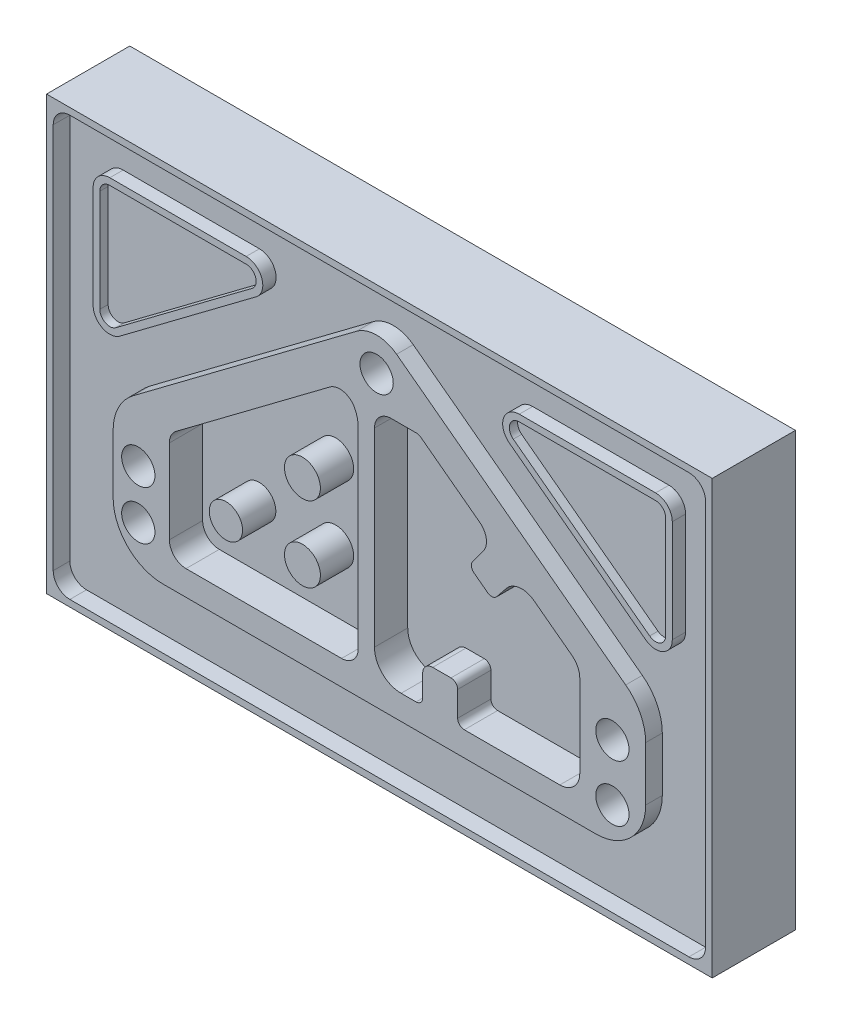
ISO-10303-21;
HEADER;
FILE_DESCRIPTION(('STEP AP214'),'2;1');
FILE_NAME('part.step','',(''),(''),'','','');
FILE_SCHEMA(('AUTOMOTIVE_DESIGN { 1 0 10303 214 1 1 1 1 }'));
ENDSEC;
DATA;
#1=APPLICATION_CONTEXT('core data for automotive mechanical design processes');
#2=APPLICATION_PROTOCOL_DEFINITION('international standard','automotive_design',2000,#1);
#3=PRODUCT_CONTEXT('',#1,'mechanical');
#4=PRODUCT('Part','Part','',(#3));
#5=PRODUCT_RELATED_PRODUCT_CATEGORY('part','',(#4));
#6=PRODUCT_DEFINITION_FORMATION('','',#4);
#7=PRODUCT_DEFINITION_CONTEXT('part definition',#1,'design');
#8=PRODUCT_DEFINITION('design','',#6,#7);
#9=PRODUCT_DEFINITION_SHAPE('','',#8);
#10=(LENGTH_UNIT() NAMED_UNIT(*) SI_UNIT(.MILLI.,.METRE.));
#11=(NAMED_UNIT(*) PLANE_ANGLE_UNIT() SI_UNIT($,.RADIAN.));
#12=(NAMED_UNIT(*) SI_UNIT($,.STERADIAN.) SOLID_ANGLE_UNIT());
#13=UNCERTAINTY_MEASURE_WITH_UNIT(LENGTH_MEASURE(1.E-05),#10,'distance_accuracy_value','');
#14=(GEOMETRIC_REPRESENTATION_CONTEXT(3) GLOBAL_UNCERTAINTY_ASSIGNED_CONTEXT((#13)) GLOBAL_UNIT_ASSIGNED_CONTEXT((#10,
#11,#12)) REPRESENTATION_CONTEXT('',''));
#15=CARTESIAN_POINT('',(0.,0.,0.));
#16=DIRECTION('',(0.,0.,1.));
#17=DIRECTION('',(1.,0.,0.));
#18=AXIS2_PLACEMENT_3D('',#15,#16,#17);
#19=CARTESIAN_POINT('',(-200.,-120.,40.));
#20=DIRECTION('',(0.,0.,-1.));
#21=DIRECTION('',(-1.,0.,0.));
#22=AXIS2_PLACEMENT_3D('',#19,#20,#21);
#23=PLANE('',#22);
#24=CARTESIAN_POINT('',(-186.,126.,40.));
#25=DIRECTION('',(0.,0.,-1.));
#26=DIRECTION('',(-1.,0.,0.));
#27=AXIS2_PLACEMENT_3D('',#24,#25,#26);
#28=CIRCLE('',#27,10.);
#29=CARTESIAN_POINT('',(-196.,126.,40.));
#30=VERTEX_POINT('',#29);
#31=CARTESIAN_POINT('',(-186.,136.,40.));
#32=VERTEX_POINT('',#31);
#33=EDGE_CURVE('E854',#30,#32,#28,.T.);
#34=ORIENTED_EDGE('',*,*,#33,.F.);
#35=DIRECTION('',(0.,-1.,0.));
#36=VECTOR('',#35,1.);
#37=CARTESIAN_POINT('',(-196.,126.,40.));
#38=LINE('',#37,#36);
#39=CARTESIAN_POINT('',(-196.,-106.,40.));
#40=VERTEX_POINT('',#39);
#41=EDGE_CURVE('E818',#30,#40,#38,.T.);
#42=ORIENTED_EDGE('',*,*,#41,.T.);
#43=CARTESIAN_POINT('',(-186.,-106.,40.));
#44=DIRECTION('',(0.,0.,-1.));
#45=DIRECTION('',(-1.,0.,0.));
#46=AXIS2_PLACEMENT_3D('',#43,#44,#45);
#47=CIRCLE('',#46,10.);
#48=CARTESIAN_POINT('',(-186.,-116.,40.));
#49=VERTEX_POINT('',#48);
#50=EDGE_CURVE('E881',#49,#40,#47,.T.);
#51=ORIENTED_EDGE('',*,*,#50,.F.);
#52=DIRECTION('',(1.,0.,0.));
#53=VECTOR('',#52,1.);
#54=CARTESIAN_POINT('',(-186.,-116.,40.));
#55=LINE('',#54,#53);
#56=CARTESIAN_POINT('',(186.,-116.,40.));
#57=VERTEX_POINT('',#56);
#58=EDGE_CURVE('E877',#49,#57,#55,.T.);
#59=ORIENTED_EDGE('',*,*,#58,.T.);
#60=CARTESIAN_POINT('',(186.,-106.,40.));
#61=DIRECTION('',(0.,0.,-1.));
#62=DIRECTION('',(-1.,0.,0.));
#63=AXIS2_PLACEMENT_3D('',#60,#61,#62);
#64=CIRCLE('',#63,10.);
#65=CARTESIAN_POINT('',(196.,-106.,40.));
#66=VERTEX_POINT('',#65);
#67=EDGE_CURVE('E874',#66,#57,#64,.T.);
#68=ORIENTED_EDGE('',*,*,#67,.F.);
#69=DIRECTION('',(0.,1.,0.));
#70=VECTOR('',#69,1.);
#71=CARTESIAN_POINT('',(196.,-106.,40.));
#72=LINE('',#71,#70);
#73=CARTESIAN_POINT('',(196.,126.,40.));
#74=VERTEX_POINT('',#73);
#75=EDGE_CURVE('E866',#66,#74,#72,.T.);
#76=ORIENTED_EDGE('',*,*,#75,.T.);
#77=CARTESIAN_POINT('',(186.,126.,40.));
#78=DIRECTION('',(0.,0.,-1.));
#79=DIRECTION('',(-1.,0.,0.));
#80=AXIS2_PLACEMENT_3D('',#77,#78,#79);
#81=CIRCLE('',#80,10.);
#82=CARTESIAN_POINT('',(186.,136.,40.));
#83=VERTEX_POINT('',#82);
#84=EDGE_CURVE('E862',#83,#74,#81,.T.);
#85=ORIENTED_EDGE('',*,*,#84,.F.);
#86=DIRECTION('',(-1.,0.,0.));
#87=VECTOR('',#86,1.);
#88=CARTESIAN_POINT('',(186.,136.,40.));
#89=LINE('',#88,#87);
#90=EDGE_CURVE('E857',#83,#32,#89,.T.);
#91=ORIENTED_EDGE('',*,*,#90,.T.);
#92=EDGE_LOOP('',(#34,#42,#51,#59,#68,#76,#85,#91));
#93=FACE_BOUND('',#92,.T.);
#94=DIRECTION('',(0.8,0.6,0.));
#95=VECTOR('',#94,1.);
#96=CARTESIAN_POINT('',(-13.6666666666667,109.75,40.));
#97=LINE('',#96,#95);
#98=CARTESIAN_POINT('',(-148.,8.99999999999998,40.));
#99=VERTEX_POINT('',#98);
#100=CARTESIAN_POINT('',(-13.6666666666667,109.75,40.));
#101=VERTEX_POINT('',#100);
#102=EDGE_CURVE('E1302',#99,#101,#97,.T.);
#103=ORIENTED_EDGE('',*,*,#102,.T.);
#104=CARTESIAN_POINT('',(-1.66666666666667,93.75,40.));
#105=DIRECTION('',(0.,0.,-1.));
#106=DIRECTION('',(-1.,0.,0.));
#107=AXIS2_PLACEMENT_3D('',#104,#105,#106);
#108=CIRCLE('',#107,20.);
#109=CARTESIAN_POINT('',(10.3333333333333,109.75,40.));
#110=VERTEX_POINT('',#109);
#111=EDGE_CURVE('E1306',#101,#110,#108,.T.);
#112=ORIENTED_EDGE('',*,*,#111,.T.);
#113=DIRECTION('',(-0.8,0.6,0.));
#114=VECTOR('',#113,1.);
#115=CARTESIAN_POINT('',(10.3333333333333,109.75,40.));
#116=LINE('',#115,#114);
#117=CARTESIAN_POINT('',(148.,6.4999999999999,40.));
#118=VERTEX_POINT('',#117);
#119=EDGE_CURVE('E681',#118,#110,#116,.T.);
#120=ORIENTED_EDGE('',*,*,#119,.F.);
#121=CARTESIAN_POINT('',(130.,-17.5000000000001,40.));
#122=DIRECTION('',(0.,0.,-1.));
#123=DIRECTION('',(-1.,0.,0.));
#124=AXIS2_PLACEMENT_3D('',#121,#122,#123);
#125=CIRCLE('',#124,30.);
#126=CARTESIAN_POINT('',(160.,-17.5000000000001,40.));
#127=VERTEX_POINT('',#126);
#128=EDGE_CURVE('E1389',#118,#127,#125,.T.);
#129=ORIENTED_EDGE('',*,*,#128,.T.);
#130=DIRECTION('',(0.,1.,0.));
#131=VECTOR('',#130,1.);
#132=CARTESIAN_POINT('',(160.,-17.5000000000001,40.));
#133=LINE('',#132,#131);
#134=CARTESIAN_POINT('',(160.,-50.,40.));
#135=VERTEX_POINT('',#134);
#136=EDGE_CURVE('E1386',#135,#127,#133,.T.);
#137=ORIENTED_EDGE('',*,*,#136,.F.);
#138=CARTESIAN_POINT('',(130.,-50.,40.));
#139=DIRECTION('',(0.,0.,-1.));
#140=DIRECTION('',(-1.,0.,0.));
#141=AXIS2_PLACEMENT_3D('',#138,#139,#140);
#142=CIRCLE('',#141,30.);
#143=CARTESIAN_POINT('',(130.,-80.,40.));
#144=VERTEX_POINT('',#143);
#145=EDGE_CURVE('E1383',#135,#144,#142,.T.);
#146=ORIENTED_EDGE('',*,*,#145,.T.);
#147=DIRECTION('',(1.,0.,0.));
#148=VECTOR('',#147,1.);
#149=CARTESIAN_POINT('',(130.,-80.,40.));
#150=LINE('',#149,#148);
#151=CARTESIAN_POINT('',(-130.,-80.,40.));
#152=VERTEX_POINT('',#151);
#153=EDGE_CURVE('E1379',#152,#144,#150,.T.);
#154=ORIENTED_EDGE('',*,*,#153,.F.);
#155=CARTESIAN_POINT('',(-130.,-50.,40.));
#156=DIRECTION('',(0.,0.,-1.));
#157=DIRECTION('',(-1.,0.,0.));
#158=AXIS2_PLACEMENT_3D('',#155,#156,#157);
#159=CIRCLE('',#158,30.);
#160=CARTESIAN_POINT('',(-160.,-50.,40.));
#161=VERTEX_POINT('',#160);
#162=EDGE_CURVE('E1377',#161,#152,#159,.F.);
#163=ORIENTED_EDGE('',*,*,#162,.F.);
#164=DIRECTION('',(0.,1.,0.));
#165=VECTOR('',#164,1.);
#166=CARTESIAN_POINT('',(-160.,-15.,40.));
#167=LINE('',#166,#165);
#168=CARTESIAN_POINT('',(-160.,-15.,40.));
#169=VERTEX_POINT('',#168);
#170=EDGE_CURVE('E1374',#161,#169,#167,.T.);
#171=ORIENTED_EDGE('',*,*,#170,.T.);
#172=CARTESIAN_POINT('',(-130.,-15.,40.));
#173=DIRECTION('',(0.,0.,-1.));
#174=DIRECTION('',(-1.,0.,0.));
#175=AXIS2_PLACEMENT_3D('',#172,#173,#174);
#176=CIRCLE('',#175,30.);
#177=EDGE_CURVE('E1307',#99,#169,#176,.F.);
#178=ORIENTED_EDGE('',*,*,#177,.F.);
#179=EDGE_LOOP('',(#103,#112,#120,#129,#137,#146,#154,#163,#171,#178));
#180=FACE_BOUND('',#179,.T.);
#181=DIRECTION('',(1.,0.,0.));
#182=VECTOR('',#181,1.);
#183=CARTESIAN_POINT('',(-164.,113.448068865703,40.));
#184=LINE('',#183,#182);
#185=CARTESIAN_POINT('',(-164.,113.448068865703,40.));
#186=VERTEX_POINT('',#185);
#187=CARTESIAN_POINT('',(-82.0692415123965,113.448068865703,40.));
#188=VERTEX_POINT('',#187);
#189=EDGE_CURVE('E1491',#186,#188,#184,.T.);
#190=ORIENTED_EDGE('',*,*,#189,.T.);
#191=CARTESIAN_POINT('',(-82.0692415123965,103.448068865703,40.));
#192=DIRECTION('',(0.,0.,-1.));
#193=DIRECTION('',(-1.,0.,0.));
#194=AXIS2_PLACEMENT_3D('',#191,#192,#193);
#195=CIRCLE('',#194,10.);
#196=CARTESIAN_POINT('',(-76.0692415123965,95.4480688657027,40.));
#197=VERTEX_POINT('',#196);
#198=EDGE_CURVE('E898',#188,#197,#195,.T.);
#199=ORIENTED_EDGE('',*,*,#198,.T.);
#200=DIRECTION('',(0.8,0.6,0.));
#201=VECTOR('',#200,1.);
#202=CARTESIAN_POINT('',(-158.,34.,40.));
#203=LINE('',#202,#201);
#204=CARTESIAN_POINT('',(-158.,34.,40.));
#205=VERTEX_POINT('',#204);
#206=EDGE_CURVE('E893',#205,#197,#203,.T.);
#207=ORIENTED_EDGE('',*,*,#206,.F.);
#208=CARTESIAN_POINT('',(-164.,42.,40.));
#209=DIRECTION('',(0.,0.,-1.));
#210=DIRECTION('',(-1.,0.,0.));
#211=AXIS2_PLACEMENT_3D('',#208,#209,#210);
#212=CIRCLE('',#211,10.);
#213=CARTESIAN_POINT('',(-174.,42.,40.));
#214=VERTEX_POINT('',#213);
#215=EDGE_CURVE('E897',#205,#214,#212,.T.);
#216=ORIENTED_EDGE('',*,*,#215,.T.);
#217=DIRECTION('',(0.,-1.,0.));
#218=VECTOR('',#217,1.);
#219=CARTESIAN_POINT('',(-174.,103.448068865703,40.));
#220=LINE('',#219,#218);
#221=CARTESIAN_POINT('',(-174.,103.448068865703,40.));
#222=VERTEX_POINT('',#221);
#223=EDGE_CURVE('E903',#222,#214,#220,.T.);
#224=ORIENTED_EDGE('',*,*,#223,.F.);
#225=CARTESIAN_POINT('',(-164.,103.448068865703,40.));
#226=DIRECTION('',(0.,0.,-1.));
#227=DIRECTION('',(-1.,0.,0.));
#228=AXIS2_PLACEMENT_3D('',#225,#226,#227);
#229=CIRCLE('',#228,9.99999999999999);
#230=EDGE_CURVE('E1492',#222,#186,#229,.T.);
#231=ORIENTED_EDGE('',*,*,#230,.T.);
#232=EDGE_LOOP('',(#190,#199,#207,#216,#224,#231));
#233=FACE_BOUND('',#232,.T.);
#234=CARTESIAN_POINT('',(164.,42.,40.));
#235=DIRECTION('',(0.,0.,1.));
#236=DIRECTION('',(1.,0.,0.));
#237=AXIS2_PLACEMENT_3D('',#234,#235,#236);
#238=CIRCLE('',#237,10.);
#239=CARTESIAN_POINT('',(158.,34.,40.));
#240=VERTEX_POINT('',#239);
#241=CARTESIAN_POINT('',(174.,42.,40.));
#242=VERTEX_POINT('',#241);
#243=EDGE_CURVE('E630',#240,#242,#238,.T.);
#244=ORIENTED_EDGE('',*,*,#243,.F.);
#245=DIRECTION('',(-0.8,0.6,0.));
#246=VECTOR('',#245,1.);
#247=CARTESIAN_POINT('',(158.,34.,40.));
#248=LINE('',#247,#246);
#249=CARTESIAN_POINT('',(76.0692415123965,95.4480688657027,40.));
#250=VERTEX_POINT('',#249);
#251=EDGE_CURVE('E654',#240,#250,#248,.T.);
#252=ORIENTED_EDGE('',*,*,#251,.T.);
#253=CARTESIAN_POINT('',(82.0692415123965,103.448068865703,40.));
#254=DIRECTION('',(0.,0.,1.));
#255=DIRECTION('',(1.,0.,0.));
#256=AXIS2_PLACEMENT_3D('',#253,#254,#255);
#257=CIRCLE('',#256,10.);
#258=CARTESIAN_POINT('',(82.0692415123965,113.448068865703,40.));
#259=VERTEX_POINT('',#258);
#260=EDGE_CURVE('E938',#259,#250,#257,.T.);
#261=ORIENTED_EDGE('',*,*,#260,.F.);
#262=DIRECTION('',(-1.,0.,0.));
#263=VECTOR('',#262,1.);
#264=CARTESIAN_POINT('',(164.,113.448068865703,40.));
#265=LINE('',#264,#263);
#266=CARTESIAN_POINT('',(164.,113.448068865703,40.));
#267=VERTEX_POINT('',#266);
#268=EDGE_CURVE('E1519',#267,#259,#265,.T.);
#269=ORIENTED_EDGE('',*,*,#268,.F.);
#270=CARTESIAN_POINT('',(164.,103.448068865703,40.));
#271=DIRECTION('',(0.,0.,1.));
#272=DIRECTION('',(1.,0.,0.));
#273=AXIS2_PLACEMENT_3D('',#270,#271,#272);
#274=CIRCLE('',#273,9.99999999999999);
#275=CARTESIAN_POINT('',(174.,103.448068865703,40.));
#276=VERTEX_POINT('',#275);
#277=EDGE_CURVE('E1517',#276,#267,#274,.T.);
#278=ORIENTED_EDGE('',*,*,#277,.F.);
#279=DIRECTION('',(0.,-1.,0.));
#280=VECTOR('',#279,1.);
#281=CARTESIAN_POINT('',(174.,103.448068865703,40.));
#282=LINE('',#281,#280);
#283=EDGE_CURVE('E1508',#276,#242,#282,.T.);
#284=ORIENTED_EDGE('',*,*,#283,.T.);
#285=EDGE_LOOP('',(#244,#252,#261,#269,#278,#284));
#286=FACE_BOUND('',#285,.T.);
#287=ADVANCED_FACE('F41',(#93,#180,#233,#286),#23,.F.);
#288=CARTESIAN_POINT('',(-1.66666666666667,93.75,50.));
#289=DIRECTION('',(0.,0.,1.));
#290=DIRECTION('',(1.,0.,0.));
#291=AXIS2_PLACEMENT_3D('',#288,#289,#290);
#292=PLANE('',#291);
#293=CARTESIAN_POINT('',(-1.66666666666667,93.75,50.));
#294=DIRECTION('',(0.,0.,1.));
#295=DIRECTION('',(1.,0.,0.));
#296=AXIS2_PLACEMENT_3D('',#293,#294,#295);
#297=CIRCLE('',#296,9.99999999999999);
#298=CARTESIAN_POINT('',(8.33333333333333,93.75,50.));
#299=VERTEX_POINT('',#298);
#300=EDGE_CURVE('E760',#299,#299,#297,.T.);
#301=ORIENTED_EDGE('',*,*,#300,.F.);
#302=EDGE_LOOP('',(#301));
#303=FACE_BOUND('',#302,.T.);
#304=CARTESIAN_POINT('',(140.,-60.,50.));
#305=DIRECTION('',(0.,0.,1.));
#306=DIRECTION('',(1.,0.,0.));
#307=AXIS2_PLACEMENT_3D('',#304,#305,#306);
#308=CIRCLE('',#307,9.99999999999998);
#309=CARTESIAN_POINT('',(150.,-60.,50.));
#310=VERTEX_POINT('',#309);
#311=EDGE_CURVE('E3111',#310,#310,#308,.T.);
#312=ORIENTED_EDGE('',*,*,#311,.F.);
#313=EDGE_LOOP('',(#312));
#314=FACE_BOUND('',#313,.T.);
#315=CARTESIAN_POINT('',(140.,-26.0833707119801,50.));
#316=DIRECTION('',(0.,0.,1.));
#317=DIRECTION('',(1.,0.,0.));
#318=AXIS2_PLACEMENT_3D('',#315,#316,#317);
#319=CIRCLE('',#318,9.99999999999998);
#320=CARTESIAN_POINT('',(150.,-26.0833707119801,50.));
#321=VERTEX_POINT('',#320);
#322=EDGE_CURVE('E3106',#321,#321,#319,.T.);
#323=ORIENTED_EDGE('',*,*,#322,.F.);
#324=EDGE_LOOP('',(#323));
#325=FACE_BOUND('',#324,.T.);
#326=CARTESIAN_POINT('',(-144.880429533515,-55.4542610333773,50.));
#327=DIRECTION('',(0.,0.,1.));
#328=DIRECTION('',(1.,0.,0.));
#329=AXIS2_PLACEMENT_3D('',#326,#327,#328);
#330=CIRCLE('',#329,10.);
#331=CARTESIAN_POINT('',(-134.880429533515,-55.4542610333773,50.));
#332=VERTEX_POINT('',#331);
#333=EDGE_CURVE('E3095',#332,#332,#330,.T.);
#334=ORIENTED_EDGE('',*,*,#333,.F.);
#335=EDGE_LOOP('',(#334));
#336=FACE_BOUND('',#335,.T.);
#337=CARTESIAN_POINT('',(-144.880429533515,-26.0833707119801,50.));
#338=DIRECTION('',(0.,0.,1.));
#339=DIRECTION('',(1.,0.,0.));
#340=AXIS2_PLACEMENT_3D('',#337,#338,#339);
#341=CIRCLE('',#340,9.99999999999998);
#342=CARTESIAN_POINT('',(-134.880429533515,-26.0833707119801,50.));
#343=VERTEX_POINT('',#342);
#344=EDGE_CURVE('E798',#343,#343,#341,.T.);
#345=ORIENTED_EDGE('',*,*,#344,.F.);
#346=EDGE_LOOP('',(#345));
#347=FACE_BOUND('',#346,.T.);
#348=CARTESIAN_POINT('',(-1.66666666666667,93.75,50.));
#349=DIRECTION('',(0.,0.,1.));
#350=DIRECTION('',(1.,0.,0.));
#351=AXIS2_PLACEMENT_3D('',#348,#349,#350);
#352=CIRCLE('',#351,20.);
#353=CARTESIAN_POINT('',(10.3333333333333,109.75,50.));
#354=VERTEX_POINT('',#353);
#355=CARTESIAN_POINT('',(-13.6666666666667,109.75,50.));
#356=VERTEX_POINT('',#355);
#357=EDGE_CURVE('E1319',#354,#356,#352,.T.);
#358=ORIENTED_EDGE('',*,*,#357,.T.);
#359=DIRECTION('',(-0.8,-0.6,0.));
#360=VECTOR('',#359,1.);
#361=CARTESIAN_POINT('',(-13.6666666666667,109.75,50.));
#362=LINE('',#361,#360);
#363=CARTESIAN_POINT('',(-148.,8.99999999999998,50.));
#364=VERTEX_POINT('',#363);
#365=EDGE_CURVE('E1315',#356,#364,#362,.T.);
#366=ORIENTED_EDGE('',*,*,#365,.T.);
#367=CARTESIAN_POINT('',(-130.,-15.,50.));
#368=DIRECTION('',(0.,0.,-1.));
#369=DIRECTION('',(-1.,0.,0.));
#370=AXIS2_PLACEMENT_3D('',#367,#368,#369);
#371=CIRCLE('',#370,30.);
#372=CARTESIAN_POINT('',(-160.,-15.,50.));
#373=VERTEX_POINT('',#372);
#374=EDGE_CURVE('E1311',#373,#364,#371,.T.);
#375=ORIENTED_EDGE('',*,*,#374,.F.);
#376=DIRECTION('',(0.,-1.,0.));
#377=VECTOR('',#376,1.);
#378=CARTESIAN_POINT('',(-160.,-15.,50.));
#379=LINE('',#378,#377);
#380=CARTESIAN_POINT('',(-160.,-50.,50.));
#381=VERTEX_POINT('',#380);
#382=EDGE_CURVE('E1314',#373,#381,#379,.T.);
#383=ORIENTED_EDGE('',*,*,#382,.T.);
#384=CARTESIAN_POINT('',(-130.,-50.,50.));
#385=DIRECTION('',(0.,0.,-1.));
#386=DIRECTION('',(-1.,0.,0.));
#387=AXIS2_PLACEMENT_3D('',#384,#385,#386);
#388=CIRCLE('',#387,30.);
#389=CARTESIAN_POINT('',(-130.,-80.,50.));
#390=VERTEX_POINT('',#389);
#391=EDGE_CURVE('E1317',#390,#381,#388,.T.);
#392=ORIENTED_EDGE('',*,*,#391,.F.);
#393=DIRECTION('',(-1.,0.,0.));
#394=VECTOR('',#393,1.);
#395=CARTESIAN_POINT('',(130.,-80.,50.));
#396=LINE('',#395,#394);
#397=CARTESIAN_POINT('',(130.,-80.,50.));
#398=VERTEX_POINT('',#397);
#399=EDGE_CURVE('E1336',#398,#390,#396,.T.);
#400=ORIENTED_EDGE('',*,*,#399,.F.);
#401=CARTESIAN_POINT('',(130.,-50.,50.));
#402=DIRECTION('',(0.,0.,1.));
#403=DIRECTION('',(1.,0.,0.));
#404=AXIS2_PLACEMENT_3D('',#401,#402,#403);
#405=CIRCLE('',#404,30.);
#406=CARTESIAN_POINT('',(160.,-50.,50.));
#407=VERTEX_POINT('',#406);
#408=EDGE_CURVE('E1340',#398,#407,#405,.T.);
#409=ORIENTED_EDGE('',*,*,#408,.T.);
#410=DIRECTION('',(0.,-1.,0.));
#411=VECTOR('',#410,1.);
#412=CARTESIAN_POINT('',(160.,-17.5000000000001,50.));
#413=LINE('',#412,#411);
#414=CARTESIAN_POINT('',(160.,-17.5000000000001,50.));
#415=VERTEX_POINT('',#414);
#416=EDGE_CURVE('E1343',#415,#407,#413,.T.);
#417=ORIENTED_EDGE('',*,*,#416,.F.);
#418=CARTESIAN_POINT('',(130.,-17.5000000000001,50.));
#419=DIRECTION('',(0.,0.,1.));
#420=DIRECTION('',(1.,0.,0.));
#421=AXIS2_PLACEMENT_3D('',#418,#419,#420);
#422=CIRCLE('',#421,30.);
#423=CARTESIAN_POINT('',(148.,6.4999999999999,50.));
#424=VERTEX_POINT('',#423);
#425=EDGE_CURVE('E1350',#415,#424,#422,.T.);
#426=ORIENTED_EDGE('',*,*,#425,.T.);
#427=DIRECTION('',(0.8,-0.6,0.));
#428=VECTOR('',#427,1.);
#429=CARTESIAN_POINT('',(10.3333333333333,109.75,50.));
#430=LINE('',#429,#428);
#431=EDGE_CURVE('E1353',#354,#424,#430,.T.);
#432=ORIENTED_EDGE('',*,*,#431,.F.);
#433=EDGE_LOOP('',(#358,#366,#375,#383,#392,#400,#409,#417,#426,#432));
#434=FACE_BOUND('',#433,.T.);
#435=DIRECTION('',(0.,-1.,0.));
#436=VECTOR('',#435,1.);
#437=CARTESIAN_POINT('',(-126.203922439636,-4.65294182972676,50.));
#438=LINE('',#437,#436);
#439=CARTESIAN_POINT('',(-126.203922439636,-4.65294182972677,50.));
#440=VERTEX_POINT('',#439);
#441=CARTESIAN_POINT('',(-126.203922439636,-55.0614367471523,50.));
#442=VERTEX_POINT('',#441);
#443=EDGE_CURVE('E717',#440,#442,#438,.T.);
#444=ORIENTED_EDGE('',*,*,#443,.F.);
#445=CARTESIAN_POINT('',(-116.203922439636,-4.65294182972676,50.));
#446=DIRECTION('',(0.,0.,-1.));
#447=DIRECTION('',(-1.,0.,0.));
#448=AXIS2_PLACEMENT_3D('',#445,#446,#447);
#449=CIRCLE('',#448,10.);
#450=CARTESIAN_POINT('',(-122.203922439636,3.34705817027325,50.));
#451=VERTEX_POINT('',#450);
#452=EDGE_CURVE('E735',#440,#451,#449,.T.);
#453=ORIENTED_EDGE('',*,*,#452,.T.);
#454=DIRECTION('',(-0.8,-0.6,0.));
#455=VECTOR('',#454,1.);
#456=CARTESIAN_POINT('',(-29.7807789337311,72.6644157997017,50.));
#457=LINE('',#456,#455);
#458=CARTESIAN_POINT('',(-29.7807789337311,72.6644157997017,50.));
#459=VERTEX_POINT('',#458);
#460=EDGE_CURVE('E1152',#459,#451,#457,.T.);
#461=ORIENTED_EDGE('',*,*,#460,.F.);
#462=CARTESIAN_POINT('',(-23.7807789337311,64.6644157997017,50.));
#463=DIRECTION('',(0.,0.,-1.));
#464=DIRECTION('',(-1.,0.,0.));
#465=AXIS2_PLACEMENT_3D('',#462,#463,#464);
#466=CIRCLE('',#465,9.99999999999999);
#467=CARTESIAN_POINT('',(-14.8323700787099,69.1282682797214,50.));
#468=VERTEX_POINT('',#467);
#469=EDGE_CURVE('E1175',#459,#468,#466,.T.);
#470=ORIENTED_EDGE('',*,*,#469,.T.);
#471=CARTESIAN_POINT('',(-32.7291877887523,60.200563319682,50.));
#472=DIRECTION('',(0.,0.,1.));
#473=DIRECTION('',(1.,0.,0.));
#474=AXIS2_PLACEMENT_3D('',#471,#472,#473);
#475=CIRCLE('',#474,20.);
#476=CARTESIAN_POINT('',(-12.7291877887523,60.200563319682,50.));
#477=VERTEX_POINT('',#476);
#478=EDGE_CURVE('E1176',#477,#468,#475,.T.);
#479=ORIENTED_EDGE('',*,*,#478,.F.);
#480=DIRECTION('',(0.,1.,0.));
#481=VECTOR('',#480,1.);
#482=CARTESIAN_POINT('',(-12.7291877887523,-55.0614367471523,50.));
#483=LINE('',#482,#481);
#484=CARTESIAN_POINT('',(-12.7291877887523,-55.0614367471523,50.));
#485=VERTEX_POINT('',#484);
#486=EDGE_CURVE('E1136',#485,#477,#483,.T.);
#487=ORIENTED_EDGE('',*,*,#486,.F.);
#488=CARTESIAN_POINT('',(-22.7291877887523,-55.0614367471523,50.));
#489=DIRECTION('',(0.,0.,1.));
#490=DIRECTION('',(1.,0.,0.));
#491=AXIS2_PLACEMENT_3D('',#488,#489,#490);
#492=CIRCLE('',#491,10.);
#493=CARTESIAN_POINT('',(-22.7291877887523,-65.0614367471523,50.));
#494=VERTEX_POINT('',#493);
#495=EDGE_CURVE('E1128',#494,#485,#492,.T.);
#496=ORIENTED_EDGE('',*,*,#495,.F.);
#497=DIRECTION('',(1.,0.,0.));
#498=VECTOR('',#497,1.);
#499=CARTESIAN_POINT('',(-116.203922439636,-65.0614367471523,50.));
#500=LINE('',#499,#498);
#501=CARTESIAN_POINT('',(-116.203922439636,-65.0614367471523,50.));
#502=VERTEX_POINT('',#501);
#503=EDGE_CURVE('E1197',#502,#494,#500,.T.);
#504=ORIENTED_EDGE('',*,*,#503,.F.);
#505=CARTESIAN_POINT('',(-116.203922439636,-55.0614367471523,50.));
#506=DIRECTION('',(0.,0.,-1.));
#507=DIRECTION('',(-1.,0.,0.));
#508=AXIS2_PLACEMENT_3D('',#505,#506,#507);
#509=CIRCLE('',#508,9.99999999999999);
#510=EDGE_CURVE('E1200',#502,#442,#509,.T.);
#511=ORIENTED_EDGE('',*,*,#510,.T.);
#512=EDGE_LOOP('',(#444,#453,#461,#470,#479,#487,#496,#504,#511));
#513=FACE_BOUND('',#512,.T.);
#514=DIRECTION('',(0.,-1.,0.));
#515=VECTOR('',#514,1.);
#516=CARTESIAN_POINT('',(-2.96909768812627,64.723935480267,50.));
#517=LINE('',#516,#515);
#518=CARTESIAN_POINT('',(-2.96909768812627,64.723935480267,50.));
#519=VERTEX_POINT('',#518);
#520=CARTESIAN_POINT('',(-2.96909768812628,-49.3196764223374,50.));
#521=VERTEX_POINT('',#520);
#522=EDGE_CURVE('E797',#519,#521,#517,.T.);
#523=ORIENTED_EDGE('',*,*,#522,.F.);
#524=CARTESIAN_POINT('',(7.03090231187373,64.723935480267,50.));
#525=DIRECTION('',(0.,0.,-1.));
#526=DIRECTION('',(-1.,0.,0.));
#527=AXIS2_PLACEMENT_3D('',#524,#525,#526);
#528=CIRCLE('',#527,9.99999999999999);
#529=CARTESIAN_POINT('',(7.03090231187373,74.723935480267,50.));
#530=VERTEX_POINT('',#529);
#531=EDGE_CURVE('E768',#519,#530,#528,.T.);
#532=ORIENTED_EDGE('',*,*,#531,.T.);
#533=DIRECTION('',(1.,0.,0.));
#534=VECTOR('',#533,1.);
#535=CARTESIAN_POINT('',(7.03090231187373,74.723935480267,50.));
#536=LINE('',#535,#534);
#537=CARTESIAN_POINT('',(22.3680860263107,74.723935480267,50.));
#538=VERTEX_POINT('',#537);
#539=EDGE_CURVE('E773',#530,#538,#536,.T.);
#540=ORIENTED_EDGE('',*,*,#539,.T.);
#541=CARTESIAN_POINT('',(22.3680860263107,70.723935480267,50.));
#542=DIRECTION('',(0.,0.,-1.));
#543=DIRECTION('',(-1.,0.,0.));
#544=AXIS2_PLACEMENT_3D('',#541,#542,#543);
#545=CIRCLE('',#544,4.00000000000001);
#546=CARTESIAN_POINT('',(24.7680860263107,73.923935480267,50.));
#547=VERTEX_POINT('',#546);
#548=EDGE_CURVE('E781',#538,#547,#545,.T.);
#549=ORIENTED_EDGE('',*,*,#548,.T.);
#550=DIRECTION('',(0.8,-0.6,0.));
#551=VECTOR('',#550,1.);
#552=CARTESIAN_POINT('',(24.7680860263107,73.923935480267,50.));
#553=LINE('',#552,#551);
#554=CARTESIAN_POINT('',(60.3439563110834,47.2420327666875,50.));
#555=VERTEX_POINT('',#554);
#556=EDGE_CURVE('E2926',#547,#555,#553,.T.);
#557=ORIENTED_EDGE('',*,*,#556,.T.);
#558=CARTESIAN_POINT('',(54.3439563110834,39.2420327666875,50.));
#559=DIRECTION('',(0.,0.,1.));
#560=DIRECTION('',(1.,0.,0.));
#561=AXIS2_PLACEMENT_3D('',#558,#559,#560);
#562=CIRCLE('',#561,9.99999999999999);
#563=CARTESIAN_POINT('',(62.3439563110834,33.2420327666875,50.));
#564=VERTEX_POINT('',#563);
#565=EDGE_CURVE('E2923',#564,#555,#562,.T.);
#566=ORIENTED_EDGE('',*,*,#565,.F.);
#567=DIRECTION('',(-0.600000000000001,-0.8,0.));
#568=VECTOR('',#567,1.);
#569=CARTESIAN_POINT('',(62.3439563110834,33.2420327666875,50.));
#570=LINE('',#569,#568);
#571=CARTESIAN_POINT('',(56.0300141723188,24.8234432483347,50.));
#572=VERTEX_POINT('',#571);
#573=EDGE_CURVE('E2919',#564,#572,#570,.T.);
#574=ORIENTED_EDGE('',*,*,#573,.T.);
#575=CARTESIAN_POINT('',(59.2300141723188,22.4234432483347,50.));
#576=DIRECTION('',(0.,0.,-1.));
#577=DIRECTION('',(-1.,0.,0.));
#578=AXIS2_PLACEMENT_3D('',#575,#576,#577);
#579=CIRCLE('',#578,4.);
#580=CARTESIAN_POINT('',(56.8300141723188,19.2234432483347,50.));
#581=VERTEX_POINT('',#580);
#582=EDGE_CURVE('E2916',#581,#572,#579,.T.);
#583=ORIENTED_EDGE('',*,*,#582,.F.);
#584=DIRECTION('',(0.8,-0.6,0.));
#585=VECTOR('',#584,1.);
#586=CARTESIAN_POINT('',(56.8300141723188,19.2234432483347,50.));
#587=LINE('',#586,#585);
#588=CARTESIAN_POINT('',(65.0483268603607,13.0597087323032,50.));
#589=VERTEX_POINT('',#588);
#590=EDGE_CURVE('E2908',#581,#589,#587,.T.);
#591=ORIENTED_EDGE('',*,*,#590,.T.);
#592=CARTESIAN_POINT('',(67.4483268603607,16.2597087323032,50.));
#593=DIRECTION('',(0.,0.,-1.));
#594=DIRECTION('',(-1.,0.,0.));
#595=AXIS2_PLACEMENT_3D('',#592,#593,#594);
#596=CIRCLE('',#595,4.);
#597=CARTESIAN_POINT('',(70.571566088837,13.7606335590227,50.));
#598=VERTEX_POINT('',#597);
#599=EDGE_CURVE('E2904',#598,#589,#596,.T.);
#600=ORIENTED_EDGE('',*,*,#599,.F.);
#601=DIRECTION('',(0.624768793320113,0.780809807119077,0.));
#602=VECTOR('',#601,1.);
#603=CARTESIAN_POINT('',(70.571566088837,13.7606335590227,50.));
#604=LINE('',#603,#602);
#605=CARTESIAN_POINT('',(76.2125631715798,20.8105148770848,50.));
#606=VERTEX_POINT('',#605);
#607=EDGE_CURVE('E2900',#598,#606,#604,.T.);
#608=ORIENTED_EDGE('',*,*,#607,.T.);
#609=CARTESIAN_POINT('',(85.5822808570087,13.3132893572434,50.));
#610=DIRECTION('',(0.,0.,1.));
#611=DIRECTION('',(1.,0.,0.));
#612=AXIS2_PLACEMENT_3D('',#609,#610,#611);
#613=CIRCLE('',#612,12.);
#614=CARTESIAN_POINT('',(92.7822808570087,22.9132893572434,50.));
#615=VERTEX_POINT('',#614);
#616=EDGE_CURVE('E2897',#615,#606,#613,.T.);
#617=ORIENTED_EDGE('',*,*,#616,.F.);
#618=DIRECTION('',(0.8,-0.6,0.));
#619=VECTOR('',#618,1.);
#620=CARTESIAN_POINT('',(92.7822808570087,22.9132893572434,50.));
#621=LINE('',#620,#619);
#622=CARTESIAN_POINT('',(115.617947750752,5.78653918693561,50.));
#623=VERTEX_POINT('',#622);
#624=EDGE_CURVE('E2889',#615,#623,#621,.T.);
#625=ORIENTED_EDGE('',*,*,#624,.T.);
#626=CARTESIAN_POINT('',(108.417947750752,-3.81346081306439,50.));
#627=DIRECTION('',(0.,0.,1.));
#628=DIRECTION('',(1.,0.,0.));
#629=AXIS2_PLACEMENT_3D('',#626,#627,#628);
#630=CIRCLE('',#629,12.);
#631=CARTESIAN_POINT('',(120.417947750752,-3.8134608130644,50.));
#632=VERTEX_POINT('',#631);
#633=EDGE_CURVE('E2885',#632,#623,#630,.T.);
#634=ORIENTED_EDGE('',*,*,#633,.F.);
#635=DIRECTION('',(0.,-1.,0.));
#636=VECTOR('',#635,1.);
#637=CARTESIAN_POINT('',(120.417947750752,-3.8134608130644,50.));
#638=LINE('',#637,#636);
#639=CARTESIAN_POINT('',(120.417947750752,-53.3196764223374,50.));
#640=VERTEX_POINT('',#639);
#641=EDGE_CURVE('E2881',#632,#640,#638,.T.);
#642=ORIENTED_EDGE('',*,*,#641,.T.);
#643=CARTESIAN_POINT('',(108.417947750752,-53.3196764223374,50.));
#644=DIRECTION('',(0.,0.,1.));
#645=DIRECTION('',(1.,0.,0.));
#646=AXIS2_PLACEMENT_3D('',#643,#644,#645);
#647=CIRCLE('',#646,12.);
#648=CARTESIAN_POINT('',(108.417947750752,-65.3196764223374,50.));
#649=VERTEX_POINT('',#648);
#650=EDGE_CURVE('E2878',#649,#640,#647,.T.);
#651=ORIENTED_EDGE('',*,*,#650,.F.);
#652=DIRECTION('',(1.,0.,0.));
#653=VECTOR('',#652,1.);
#654=CARTESIAN_POINT('',(51.0119233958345,-65.3196764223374,50.));
#655=LINE('',#654,#653);
#656=CARTESIAN_POINT('',(51.0119233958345,-65.3196764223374,50.));
#657=VERTEX_POINT('',#656);
#658=EDGE_CURVE('E2870',#657,#649,#655,.T.);
#659=ORIENTED_EDGE('',*,*,#658,.F.);
#660=CARTESIAN_POINT('',(51.0119233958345,-61.3196764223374,50.));
#661=DIRECTION('',(0.,0.,-1.));
#662=DIRECTION('',(-1.,0.,0.));
#663=AXIS2_PLACEMENT_3D('',#660,#661,#662);
#664=CIRCLE('',#663,4.);
#665=CARTESIAN_POINT('',(47.0119233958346,-61.3196764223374,50.));
#666=VERTEX_POINT('',#665);
#667=EDGE_CURVE('E2866',#657,#666,#664,.T.);
#668=ORIENTED_EDGE('',*,*,#667,.T.);
#669=DIRECTION('',(0.,-1.,0.));
#670=VECTOR('',#669,1.);
#671=CARTESIAN_POINT('',(47.0119233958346,-46.3196764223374,50.));
#672=LINE('',#671,#670);
#673=CARTESIAN_POINT('',(47.0119233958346,-46.3196764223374,50.));
#674=VERTEX_POINT('',#673);
#675=EDGE_CURVE('E2862',#674,#666,#672,.T.);
#676=ORIENTED_EDGE('',*,*,#675,.F.);
#677=CARTESIAN_POINT('',(43.0119233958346,-46.3196764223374,50.));
#678=DIRECTION('',(0.,0.,-1.));
#679=DIRECTION('',(-1.,0.,0.));
#680=AXIS2_PLACEMENT_3D('',#677,#678,#679);
#681=CIRCLE('',#680,4.);
#682=CARTESIAN_POINT('',(43.0119233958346,-42.3196764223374,50.));
#683=VERTEX_POINT('',#682);
#684=EDGE_CURVE('E2859',#683,#674,#681,.T.);
#685=ORIENTED_EDGE('',*,*,#684,.F.);
#686=DIRECTION('',(1.,0.,0.));
#687=VECTOR('',#686,1.);
#688=CARTESIAN_POINT('',(32.0119233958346,-42.3196764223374,50.));
#689=LINE('',#688,#687);
#690=CARTESIAN_POINT('',(32.0119233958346,-42.3196764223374,50.));
#691=VERTEX_POINT('',#690);
#692=EDGE_CURVE('E2851',#691,#683,#689,.T.);
#693=ORIENTED_EDGE('',*,*,#692,.F.);
#694=CARTESIAN_POINT('',(32.0119233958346,-48.3196764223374,50.));
#695=DIRECTION('',(0.,0.,-1.));
#696=DIRECTION('',(-1.,0.,0.));
#697=AXIS2_PLACEMENT_3D('',#694,#695,#696);
#698=CIRCLE('',#697,5.99999999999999);
#699=CARTESIAN_POINT('',(26.0119233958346,-48.3196764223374,50.));
#700=VERTEX_POINT('',#699);
#701=EDGE_CURVE('E2847',#700,#691,#698,.T.);
#702=ORIENTED_EDGE('',*,*,#701,.F.);
#703=DIRECTION('',(0.,1.,0.));
#704=VECTOR('',#703,1.);
#705=CARTESIAN_POINT('',(26.0119233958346,-61.3196764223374,50.));
#706=LINE('',#705,#704);
#707=CARTESIAN_POINT('',(26.0119233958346,-61.3196764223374,50.));
#708=VERTEX_POINT('',#707);
#709=EDGE_CURVE('E2843',#708,#700,#706,.T.);
#710=ORIENTED_EDGE('',*,*,#709,.F.);
#711=CARTESIAN_POINT('',(22.0119233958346,-61.3196764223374,50.));
#712=DIRECTION('',(0.,0.,-1.));
#713=DIRECTION('',(-1.,0.,0.));
#714=AXIS2_PLACEMENT_3D('',#711,#712,#713);
#715=CIRCLE('',#714,4.);
#716=CARTESIAN_POINT('',(22.0119233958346,-65.3196764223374,50.));
#717=VERTEX_POINT('',#716);
#718=EDGE_CURVE('E2840',#708,#717,#715,.T.);
#719=ORIENTED_EDGE('',*,*,#718,.T.);
#720=DIRECTION('',(1.,0.,0.));
#721=VECTOR('',#720,1.);
#722=CARTESIAN_POINT('',(13.0309023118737,-65.3196764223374,50.));
#723=LINE('',#722,#721);
#724=CARTESIAN_POINT('',(13.0309023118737,-65.3196764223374,50.));
#725=VERTEX_POINT('',#724);
#726=EDGE_CURVE('E2828',#725,#717,#723,.T.);
#727=ORIENTED_EDGE('',*,*,#726,.F.);
#728=CARTESIAN_POINT('',(13.0309023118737,-49.3196764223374,50.));
#729=DIRECTION('',(0.,0.,1.));
#730=DIRECTION('',(1.,0.,0.));
#731=AXIS2_PLACEMENT_3D('',#728,#729,#730);
#732=CIRCLE('',#731,16.);
#733=EDGE_CURVE('E2827',#521,#725,#732,.T.);
#734=ORIENTED_EDGE('',*,*,#733,.F.);
#735=EDGE_LOOP('',(#523,#532,#540,#549,#557,#566,#574,#583,#591,#600,#608,#617,#625,#634,#642,
#651,#659,#668,#676,#685,#693,#702,#710,#719,#727,#734));
#736=FACE_BOUND('',#735,.T.);
#737=ADVANCED_FACE('F1179',(#303,#314,#325,#336,#347,#434,#513,#736),#292,.T.);
#738=CARTESIAN_POINT('',(-1.66666666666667,93.75,50.));
#739=DIRECTION('',(0.,0.,-1.));
#740=DIRECTION('',(-1.,0.,0.));
#741=AXIS2_PLACEMENT_3D('',#738,#739,#740);
#742=CYLINDRICAL_SURFACE('',#741,20.);
#743=ORIENTED_EDGE('',*,*,#111,.F.);
#744=DIRECTION('',(0.,0.,-1.));
#745=VECTOR('',#744,1.);
#746=CARTESIAN_POINT('',(-13.6666666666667,109.75,50.));
#747=LINE('',#746,#745);
#748=EDGE_CURVE('E687',#356,#101,#747,.T.);
#749=ORIENTED_EDGE('',*,*,#748,.F.);
#750=ORIENTED_EDGE('',*,*,#357,.F.);
#751=DIRECTION('',(0.,0.,-1.));
#752=VECTOR('',#751,1.);
#753=CARTESIAN_POINT('',(10.3333333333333,109.75,50.));
#754=LINE('',#753,#752);
#755=EDGE_CURVE('E1357',#354,#110,#754,.T.);
#756=ORIENTED_EDGE('',*,*,#755,.T.);
#757=EDGE_LOOP('',(#743,#749,#750,#756));
#758=FACE_BOUND('',#757,.T.);
#759=ADVANCED_FACE('F43',(#758),#742,.T.);
#760=CARTESIAN_POINT('',(-13.6666666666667,109.75,50.));
#761=DIRECTION('',(0.6,-0.8,0.));
#762=DIRECTION('',(0.8,0.6,0.));
#763=AXIS2_PLACEMENT_3D('',#760,#761,#762);
#764=PLANE('',#763);
#765=ORIENTED_EDGE('',*,*,#102,.F.);
#766=DIRECTION('',(0.,0.,-1.));
#767=VECTOR('',#766,1.);
#768=CARTESIAN_POINT('',(-148.,8.99999999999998,50.));
#769=LINE('',#768,#767);
#770=EDGE_CURVE('E969',#364,#99,#769,.T.);
#771=ORIENTED_EDGE('',*,*,#770,.F.);
#772=ORIENTED_EDGE('',*,*,#365,.F.);
#773=ORIENTED_EDGE('',*,*,#748,.T.);
#774=EDGE_LOOP('',(#765,#771,#772,#773));
#775=FACE_BOUND('',#774,.T.);
#776=ADVANCED_FACE('F1291',(#775),#764,.F.);
#777=CARTESIAN_POINT('',(-130.,-15.,50.));
#778=DIRECTION('',(0.,0.,-1.));
#779=DIRECTION('',(-1.,0.,0.));
#780=AXIS2_PLACEMENT_3D('',#777,#778,#779);
#781=CYLINDRICAL_SURFACE('',#780,30.);
#782=ORIENTED_EDGE('',*,*,#770,.T.);
#783=ORIENTED_EDGE('',*,*,#177,.T.);
#784=DIRECTION('',(0.,0.,-1.));
#785=VECTOR('',#784,1.);
#786=CARTESIAN_POINT('',(-160.,-15.,50.));
#787=LINE('',#786,#785);
#788=EDGE_CURVE('E973',#373,#169,#787,.T.);
#789=ORIENTED_EDGE('',*,*,#788,.F.);
#790=ORIENTED_EDGE('',*,*,#374,.T.);
#791=EDGE_LOOP('',(#782,#783,#789,#790));
#792=FACE_BOUND('',#791,.T.);
#793=ADVANCED_FACE('F1288',(#792),#781,.T.);
#794=CARTESIAN_POINT('',(-160.,-15.,50.));
#795=DIRECTION('',(1.,0.,0.));
#796=DIRECTION('',(0.,0.,-1.));
#797=AXIS2_PLACEMENT_3D('',#794,#795,#796);
#798=PLANE('',#797);
#799=ORIENTED_EDGE('',*,*,#170,.F.);
#800=DIRECTION('',(0.,0.,-1.));
#801=VECTOR('',#800,1.);
#802=CARTESIAN_POINT('',(-160.,-50.,50.));
#803=LINE('',#802,#801);
#804=EDGE_CURVE('E977',#381,#161,#803,.T.);
#805=ORIENTED_EDGE('',*,*,#804,.F.);
#806=ORIENTED_EDGE('',*,*,#382,.F.);
#807=ORIENTED_EDGE('',*,*,#788,.T.);
#808=EDGE_LOOP('',(#799,#805,#806,#807));
#809=FACE_BOUND('',#808,.T.);
#810=ADVANCED_FACE('F1284',(#809),#798,.F.);
#811=CARTESIAN_POINT('',(-130.,-50.,50.));
#812=DIRECTION('',(0.,0.,-1.));
#813=DIRECTION('',(-1.,0.,0.));
#814=AXIS2_PLACEMENT_3D('',#811,#812,#813);
#815=CYLINDRICAL_SURFACE('',#814,30.);
#816=ORIENTED_EDGE('',*,*,#804,.T.);
#817=ORIENTED_EDGE('',*,*,#162,.T.);
#818=DIRECTION('',(0.,0.,-1.));
#819=VECTOR('',#818,1.);
#820=CARTESIAN_POINT('',(-130.,-80.,50.));
#821=LINE('',#820,#819);
#822=EDGE_CURVE('E3151',#390,#152,#821,.T.);
#823=ORIENTED_EDGE('',*,*,#822,.F.);
#824=ORIENTED_EDGE('',*,*,#391,.T.);
#825=EDGE_LOOP('',(#816,#817,#823,#824));
#826=FACE_BOUND('',#825,.T.);
#827=ADVANCED_FACE('F1280',(#826),#815,.T.);
#828=CARTESIAN_POINT('',(130.,-80.,50.));
#829=DIRECTION('',(0.,-1.,0.));
#830=DIRECTION('',(0.,0.,-1.));
#831=AXIS2_PLACEMENT_3D('',#828,#829,#830);
#832=PLANE('',#831);
#833=ORIENTED_EDGE('',*,*,#822,.T.);
#834=ORIENTED_EDGE('',*,*,#153,.T.);
#835=DIRECTION('',(0.,0.,-1.));
#836=VECTOR('',#835,1.);
#837=CARTESIAN_POINT('',(130.,-80.,50.));
#838=LINE('',#837,#836);
#839=EDGE_CURVE('E3148',#398,#144,#838,.T.);
#840=ORIENTED_EDGE('',*,*,#839,.F.);
#841=ORIENTED_EDGE('',*,*,#399,.T.);
#842=EDGE_LOOP('',(#833,#834,#840,#841));
#843=FACE_BOUND('',#842,.T.);
#844=ADVANCED_FACE('F1276',(#843),#832,.T.);
#845=CARTESIAN_POINT('',(130.,-50.,50.));
#846=DIRECTION('',(0.,0.,-1.));
#847=DIRECTION('',(-1.,0.,0.));
#848=AXIS2_PLACEMENT_3D('',#845,#846,#847);
#849=CYLINDRICAL_SURFACE('',#848,30.);
#850=ORIENTED_EDGE('',*,*,#145,.F.);
#851=DIRECTION('',(0.,0.,-1.));
#852=VECTOR('',#851,1.);
#853=CARTESIAN_POINT('',(160.,-50.,50.));
#854=LINE('',#853,#852);
#855=EDGE_CURVE('E3136',#407,#135,#854,.T.);
#856=ORIENTED_EDGE('',*,*,#855,.F.);
#857=ORIENTED_EDGE('',*,*,#408,.F.);
#858=ORIENTED_EDGE('',*,*,#839,.T.);
#859=EDGE_LOOP('',(#850,#856,#857,#858));
#860=FACE_BOUND('',#859,.T.);
#861=ADVANCED_FACE('F1272',(#860),#849,.T.);
#862=CARTESIAN_POINT('',(160.,-17.5000000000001,50.));
#863=DIRECTION('',(1.,0.,0.));
#864=DIRECTION('',(0.,0.,-1.));
#865=AXIS2_PLACEMENT_3D('',#862,#863,#864);
#866=PLANE('',#865);
#867=ORIENTED_EDGE('',*,*,#855,.T.);
#868=ORIENTED_EDGE('',*,*,#136,.T.);
#869=DIRECTION('',(0.,0.,-1.));
#870=VECTOR('',#869,1.);
#871=CARTESIAN_POINT('',(160.,-17.5000000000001,50.));
#872=LINE('',#871,#870);
#873=EDGE_CURVE('E3134',#415,#127,#872,.T.);
#874=ORIENTED_EDGE('',*,*,#873,.F.);
#875=ORIENTED_EDGE('',*,*,#416,.T.);
#876=EDGE_LOOP('',(#867,#868,#874,#875));
#877=FACE_BOUND('',#876,.T.);
#878=ADVANCED_FACE('F1268',(#877),#866,.T.);
#879=CARTESIAN_POINT('',(130.,-17.5000000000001,50.));
#880=DIRECTION('',(0.,0.,-1.));
#881=DIRECTION('',(-1.,0.,0.));
#882=AXIS2_PLACEMENT_3D('',#879,#880,#881);
#883=CYLINDRICAL_SURFACE('',#882,30.);
#884=ORIENTED_EDGE('',*,*,#128,.F.);
#885=DIRECTION('',(0.,0.,-1.));
#886=VECTOR('',#885,1.);
#887=CARTESIAN_POINT('',(148.,6.4999999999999,50.));
#888=LINE('',#887,#886);
#889=EDGE_CURVE('E3132',#424,#118,#888,.T.);
#890=ORIENTED_EDGE('',*,*,#889,.F.);
#891=ORIENTED_EDGE('',*,*,#425,.F.);
#892=ORIENTED_EDGE('',*,*,#873,.T.);
#893=EDGE_LOOP('',(#884,#890,#891,#892));
#894=FACE_BOUND('',#893,.T.);
#895=ADVANCED_FACE('F1264',(#894),#883,.T.);
#896=CARTESIAN_POINT('',(10.3333333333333,109.75,50.));
#897=DIRECTION('',(0.6,0.8,0.));
#898=DIRECTION('',(-0.8,0.6,0.));
#899=AXIS2_PLACEMENT_3D('',#896,#897,#898);
#900=PLANE('',#899);
#901=ORIENTED_EDGE('',*,*,#889,.T.);
#902=ORIENTED_EDGE('',*,*,#119,.T.);
#903=ORIENTED_EDGE('',*,*,#755,.F.);
#904=ORIENTED_EDGE('',*,*,#431,.T.);
#905=EDGE_LOOP('',(#901,#902,#903,#904));
#906=FACE_BOUND('',#905,.T.);
#907=ADVANCED_FACE('F1261',(#906),#900,.T.);
#908=CARTESIAN_POINT('',(-116.203922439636,-4.65294182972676,30.));
#909=DIRECTION('',(0.,0.,1.));
#910=DIRECTION('',(1.,0.,0.));
#911=AXIS2_PLACEMENT_3D('',#908,#909,#910);
#912=CYLINDRICAL_SURFACE('',#911,10.);
#913=ORIENTED_EDGE('',*,*,#452,.F.);
#914=DIRECTION('',(0.,0.,1.));
#915=VECTOR('',#914,1.);
#916=CARTESIAN_POINT('',(-126.203922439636,-4.65294182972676,30.));
#917=LINE('',#916,#915);
#918=CARTESIAN_POINT('',(-126.203922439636,-4.65294182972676,30.));
#919=VERTEX_POINT('',#918);
#920=EDGE_CURVE('E723',#919,#440,#917,.T.);
#921=ORIENTED_EDGE('',*,*,#920,.F.);
#922=CARTESIAN_POINT('',(-116.203922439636,-4.65294182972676,30.));
#923=DIRECTION('',(0.,0.,-1.));
#924=DIRECTION('',(-1.,0.,0.));
#925=AXIS2_PLACEMENT_3D('',#922,#923,#924);
#926=CIRCLE('',#925,10.);
#927=CARTESIAN_POINT('',(-122.203922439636,3.34705817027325,30.));
#928=VERTEX_POINT('',#927);
#929=EDGE_CURVE('E708',#919,#928,#926,.T.);
#930=ORIENTED_EDGE('',*,*,#929,.T.);
#931=DIRECTION('',(0.,0.,1.));
#932=VECTOR('',#931,1.);
#933=CARTESIAN_POINT('',(-122.203922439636,3.34705817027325,30.));
#934=LINE('',#933,#932);
#935=EDGE_CURVE('E1150',#928,#451,#934,.T.);
#936=ORIENTED_EDGE('',*,*,#935,.T.);
#937=EDGE_LOOP('',(#913,#921,#930,#936));
#938=FACE_BOUND('',#937,.T.);
#939=ADVANCED_FACE('F1237',(#938),#912,.F.);
#940=CARTESIAN_POINT('',(-29.7807789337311,72.6644157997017,30.));
#941=DIRECTION('',(-0.6,0.8,0.));
#942=DIRECTION('',(-0.8,-0.6,0.));
#943=AXIS2_PLACEMENT_3D('',#940,#941,#942);
#944=PLANE('',#943);
#945=ORIENTED_EDGE('',*,*,#460,.T.);
#946=ORIENTED_EDGE('',*,*,#935,.F.);
#947=DIRECTION('',(-0.8,-0.6,0.));
#948=VECTOR('',#947,1.);
#949=CARTESIAN_POINT('',(-29.7807789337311,72.6644157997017,30.));
#950=LINE('',#949,#948);
#951=CARTESIAN_POINT('',(-29.7807789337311,72.6644157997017,30.));
#952=VERTEX_POINT('',#951);
#953=EDGE_CURVE('E714',#952,#928,#950,.T.);
#954=ORIENTED_EDGE('',*,*,#953,.F.);
#955=DIRECTION('',(0.,0.,1.));
#956=VECTOR('',#955,1.);
#957=CARTESIAN_POINT('',(-29.7807789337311,72.6644157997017,30.));
#958=LINE('',#957,#956);
#959=EDGE_CURVE('E1148',#952,#459,#958,.T.);
#960=ORIENTED_EDGE('',*,*,#959,.T.);
#961=EDGE_LOOP('',(#945,#946,#954,#960));
#962=FACE_BOUND('',#961,.T.);
#963=ADVANCED_FACE('F1147',(#962),#944,.F.);
#964=CARTESIAN_POINT('',(-23.7807789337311,64.6644157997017,30.));
#965=DIRECTION('',(0.,0.,1.));
#966=DIRECTION('',(1.,0.,0.));
#967=AXIS2_PLACEMENT_3D('',#964,#965,#966);
#968=CYLINDRICAL_SURFACE('',#967,9.99999999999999);
#969=ORIENTED_EDGE('',*,*,#469,.F.);
#970=ORIENTED_EDGE('',*,*,#959,.F.);
#971=CARTESIAN_POINT('',(-23.7807789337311,64.6644157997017,30.));
#972=DIRECTION('',(0.,0.,-1.));
#973=DIRECTION('',(-1.,0.,0.));
#974=AXIS2_PLACEMENT_3D('',#971,#972,#973);
#975=CIRCLE('',#974,9.99999999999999);
#976=CARTESIAN_POINT('',(-14.8323700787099,69.1282682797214,30.));
#977=VERTEX_POINT('',#976);
#978=EDGE_CURVE('E1102',#952,#977,#975,.T.);
#979=ORIENTED_EDGE('',*,*,#978,.T.);
#980=DIRECTION('',(0.,0.,1.));
#981=VECTOR('',#980,1.);
#982=CARTESIAN_POINT('',(-14.8323700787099,69.1282682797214,30.));
#983=LINE('',#982,#981);
#984=EDGE_CURVE('E1140',#977,#468,#983,.T.);
#985=ORIENTED_EDGE('',*,*,#984,.T.);
#986=EDGE_LOOP('',(#969,#970,#979,#985));
#987=FACE_BOUND('',#986,.T.);
#988=ADVANCED_FACE('F1173',(#987),#968,.F.);
#989=CARTESIAN_POINT('',(-32.7291877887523,60.200563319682,30.));
#990=DIRECTION('',(0.,0.,1.));
#991=DIRECTION('',(1.,0.,0.));
#992=AXIS2_PLACEMENT_3D('',#989,#990,#991);
#993=CYLINDRICAL_SURFACE('',#992,20.);
#994=ORIENTED_EDGE('',*,*,#478,.T.);
#995=ORIENTED_EDGE('',*,*,#984,.F.);
#996=CARTESIAN_POINT('',(-32.7291877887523,60.200563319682,30.));
#997=DIRECTION('',(0.,0.,1.));
#998=DIRECTION('',(1.,0.,0.));
#999=AXIS2_PLACEMENT_3D('',#996,#997,#998);
#1000=CIRCLE('',#999,20.);
#1001=CARTESIAN_POINT('',(-12.7291877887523,60.200563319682,30.));
#1002=VERTEX_POINT('',#1001);
#1003=EDGE_CURVE('E1104',#1002,#977,#1000,.T.);
#1004=ORIENTED_EDGE('',*,*,#1003,.F.);
#1005=DIRECTION('',(0.,0.,1.));
#1006=VECTOR('',#1005,1.);
#1007=CARTESIAN_POINT('',(-12.7291877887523,60.200563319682,30.));
#1008=LINE('',#1007,#1006);
#1009=EDGE_CURVE('E1132',#1002,#477,#1008,.T.);
#1010=ORIENTED_EDGE('',*,*,#1009,.T.);
#1011=EDGE_LOOP('',(#994,#995,#1004,#1010));
#1012=FACE_BOUND('',#1011,.T.);
#1013=ADVANCED_FACE('F1143',(#1012),#993,.F.);
#1014=CARTESIAN_POINT('',(-12.7291877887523,-55.0614367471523,30.));
#1015=DIRECTION('',(1.,0.,0.));
#1016=DIRECTION('',(0.,0.,-1.));
#1017=AXIS2_PLACEMENT_3D('',#1014,#1015,#1016);
#1018=PLANE('',#1017);
#1019=ORIENTED_EDGE('',*,*,#486,.T.);
#1020=ORIENTED_EDGE('',*,*,#1009,.F.);
#1021=DIRECTION('',(0.,1.,0.));
#1022=VECTOR('',#1021,1.);
#1023=CARTESIAN_POINT('',(-12.7291877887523,-55.0614367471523,30.));
#1024=LINE('',#1023,#1022);
#1025=CARTESIAN_POINT('',(-12.7291877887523,-55.0614367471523,30.));
#1026=VERTEX_POINT('',#1025);
#1027=EDGE_CURVE('E1108',#1026,#1002,#1024,.T.);
#1028=ORIENTED_EDGE('',*,*,#1027,.F.);
#1029=DIRECTION('',(0.,0.,1.));
#1030=VECTOR('',#1029,1.);
#1031=CARTESIAN_POINT('',(-12.7291877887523,-55.0614367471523,30.));
#1032=LINE('',#1031,#1030);
#1033=EDGE_CURVE('E1126',#1026,#485,#1032,.T.);
#1034=ORIENTED_EDGE('',*,*,#1033,.T.);
#1035=EDGE_LOOP('',(#1019,#1020,#1028,#1034));
#1036=FACE_BOUND('',#1035,.T.);
#1037=ADVANCED_FACE('F1134',(#1036),#1018,.F.);
#1038=CARTESIAN_POINT('',(-22.7291877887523,-55.0614367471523,30.));
#1039=DIRECTION('',(0.,0.,1.));
#1040=DIRECTION('',(1.,0.,0.));
#1041=AXIS2_PLACEMENT_3D('',#1038,#1039,#1040);
#1042=CYLINDRICAL_SURFACE('',#1041,10.);
#1043=ORIENTED_EDGE('',*,*,#495,.T.);
#1044=ORIENTED_EDGE('',*,*,#1033,.F.);
#1045=CARTESIAN_POINT('',(-22.7291877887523,-55.0614367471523,30.));
#1046=DIRECTION('',(0.,0.,1.));
#1047=DIRECTION('',(1.,0.,0.));
#1048=AXIS2_PLACEMENT_3D('',#1045,#1046,#1047);
#1049=CIRCLE('',#1048,10.);
#1050=CARTESIAN_POINT('',(-22.7291877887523,-65.0614367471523,30.));
#1051=VERTEX_POINT('',#1050);
#1052=EDGE_CURVE('E1112',#1051,#1026,#1049,.T.);
#1053=ORIENTED_EDGE('',*,*,#1052,.F.);
#1054=DIRECTION('',(0.,0.,1.));
#1055=VECTOR('',#1054,1.);
#1056=CARTESIAN_POINT('',(-22.7291877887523,-65.0614367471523,30.));
#1057=LINE('',#1056,#1055);
#1058=EDGE_CURVE('E1124',#1051,#494,#1057,.T.);
#1059=ORIENTED_EDGE('',*,*,#1058,.T.);
#1060=EDGE_LOOP('',(#1043,#1044,#1053,#1059));
#1061=FACE_BOUND('',#1060,.T.);
#1062=ADVANCED_FACE('F1123',(#1061),#1042,.F.);
#1063=CARTESIAN_POINT('',(-116.203922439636,-65.0614367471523,30.));
#1064=DIRECTION('',(0.,-1.,0.));
#1065=DIRECTION('',(0.,0.,-1.));
#1066=AXIS2_PLACEMENT_3D('',#1063,#1064,#1065);
#1067=PLANE('',#1066);
#1068=ORIENTED_EDGE('',*,*,#503,.T.);
#1069=ORIENTED_EDGE('',*,*,#1058,.F.);
#1070=DIRECTION('',(1.,0.,0.));
#1071=VECTOR('',#1070,1.);
#1072=CARTESIAN_POINT('',(-116.203922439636,-65.0614367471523,30.));
#1073=LINE('',#1072,#1071);
#1074=CARTESIAN_POINT('',(-116.203922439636,-65.0614367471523,30.));
#1075=VERTEX_POINT('',#1074);
#1076=EDGE_CURVE('E729',#1075,#1051,#1073,.T.);
#1077=ORIENTED_EDGE('',*,*,#1076,.F.);
#1078=DIRECTION('',(0.,0.,1.));
#1079=VECTOR('',#1078,1.);
#1080=CARTESIAN_POINT('',(-116.203922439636,-65.0614367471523,30.));
#1081=LINE('',#1080,#1079);
#1082=EDGE_CURVE('E1209',#1075,#502,#1081,.T.);
#1083=ORIENTED_EDGE('',*,*,#1082,.T.);
#1084=EDGE_LOOP('',(#1068,#1069,#1077,#1083));
#1085=FACE_BOUND('',#1084,.T.);
#1086=ADVANCED_FACE('F1216',(#1085),#1067,.F.);
#1087=CARTESIAN_POINT('',(-116.203922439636,-55.0614367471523,30.));
#1088=DIRECTION('',(0.,0.,1.));
#1089=DIRECTION('',(1.,0.,0.));
#1090=AXIS2_PLACEMENT_3D('',#1087,#1088,#1089);
#1091=CYLINDRICAL_SURFACE('',#1090,9.99999999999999);
#1092=ORIENTED_EDGE('',*,*,#510,.F.);
#1093=ORIENTED_EDGE('',*,*,#1082,.F.);
#1094=CARTESIAN_POINT('',(-116.203922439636,-55.0614367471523,30.));
#1095=DIRECTION('',(0.,0.,-1.));
#1096=DIRECTION('',(-1.,0.,0.));
#1097=AXIS2_PLACEMENT_3D('',#1094,#1095,#1096);
#1098=CIRCLE('',#1097,9.99999999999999);
#1099=CARTESIAN_POINT('',(-126.203922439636,-55.0614367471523,30.));
#1100=VERTEX_POINT('',#1099);
#1101=EDGE_CURVE('E726',#1075,#1100,#1098,.T.);
#1102=ORIENTED_EDGE('',*,*,#1101,.T.);
#1103=DIRECTION('',(0.,0.,1.));
#1104=VECTOR('',#1103,1.);
#1105=CARTESIAN_POINT('',(-126.203922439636,-55.0614367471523,30.));
#1106=LINE('',#1105,#1104);
#1107=EDGE_CURVE('E725',#1100,#442,#1106,.T.);
#1108=ORIENTED_EDGE('',*,*,#1107,.T.);
#1109=EDGE_LOOP('',(#1092,#1093,#1102,#1108));
#1110=FACE_BOUND('',#1109,.T.);
#1111=ADVANCED_FACE('F1214',(#1110),#1091,.F.);
#1112=CARTESIAN_POINT('',(-126.203922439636,-4.65294182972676,30.));
#1113=DIRECTION('',(-1.,0.,0.));
#1114=DIRECTION('',(0.,0.,1.));
#1115=AXIS2_PLACEMENT_3D('',#1112,#1113,#1114);
#1116=PLANE('',#1115);
#1117=ORIENTED_EDGE('',*,*,#443,.T.);
#1118=ORIENTED_EDGE('',*,*,#1107,.F.);
#1119=DIRECTION('',(0.,-1.,0.));
#1120=VECTOR('',#1119,1.);
#1121=CARTESIAN_POINT('',(-126.203922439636,-4.65294182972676,30.));
#1122=LINE('',#1121,#1120);
#1123=EDGE_CURVE('E711',#919,#1100,#1122,.T.);
#1124=ORIENTED_EDGE('',*,*,#1123,.F.);
#1125=ORIENTED_EDGE('',*,*,#920,.T.);
#1126=EDGE_LOOP('',(#1117,#1118,#1124,#1125));
#1127=FACE_BOUND('',#1126,.T.);
#1128=ADVANCED_FACE('F700',(#1127),#1116,.F.);
#1129=CARTESIAN_POINT('',(-116.203922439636,-4.65294182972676,30.));
#1130=DIRECTION('',(0.,0.,-1.));
#1131=DIRECTION('',(-1.,0.,0.));
#1132=AXIS2_PLACEMENT_3D('',#1129,#1130,#1131);
#1133=PLANE('',#1132);
#1134=CARTESIAN_POINT('',(-92.2224947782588,-28.1717671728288,30.));
#1135=DIRECTION('',(0.,0.,-1.));
#1136=DIRECTION('',(-1.,0.,0.));
#1137=AXIS2_PLACEMENT_3D('',#1134,#1135,#1136);
#1138=CIRCLE('',#1137,10.);
#1139=CARTESIAN_POINT('',(-102.222494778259,-28.1717671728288,30.));
#1140=VERTEX_POINT('',#1139);
#1141=EDGE_CURVE('E12',#1140,#1140,#1138,.F.);
#1142=ORIENTED_EDGE('',*,*,#1141,.F.);
#1143=EDGE_LOOP('',(#1142));
#1144=FACE_BOUND('',#1143,.T.);
#1145=CARTESIAN_POINT('',(-46.2461760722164,-28.1717671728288,30.));
#1146=DIRECTION('',(0.,0.,-1.));
#1147=DIRECTION('',(-1.,0.,0.));
#1148=AXIS2_PLACEMENT_3D('',#1145,#1146,#1147);
#1149=CIRCLE('',#1148,10.7866026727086);
#1150=CARTESIAN_POINT('',(-57.0327787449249,-28.1717671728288,30.));
#1151=VERTEX_POINT('',#1150);
#1152=EDGE_CURVE('E49',#1151,#1151,#1149,.F.);
#1153=ORIENTED_EDGE('',*,*,#1152,.F.);
#1154=EDGE_LOOP('',(#1153));
#1155=FACE_BOUND('',#1154,.T.);
#1156=CARTESIAN_POINT('',(-46.2461760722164,17.1616138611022,30.));
#1157=DIRECTION('',(0.,0.,-1.));
#1158=DIRECTION('',(-1.,0.,0.));
#1159=AXIS2_PLACEMENT_3D('',#1156,#1157,#1158);
#1160=CIRCLE('',#1159,10.7866026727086);
#1161=CARTESIAN_POINT('',(-57.0327787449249,17.1616138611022,30.));
#1162=VERTEX_POINT('',#1161);
#1163=EDGE_CURVE('E686',#1162,#1162,#1160,.F.);
#1164=ORIENTED_EDGE('',*,*,#1163,.F.);
#1165=EDGE_LOOP('',(#1164));
#1166=FACE_BOUND('',#1165,.T.);
#1167=ORIENTED_EDGE('',*,*,#929,.F.);
#1168=ORIENTED_EDGE('',*,*,#1123,.T.);
#1169=ORIENTED_EDGE('',*,*,#1101,.F.);
#1170=ORIENTED_EDGE('',*,*,#1076,.T.);
#1171=ORIENTED_EDGE('',*,*,#1052,.T.);
#1172=ORIENTED_EDGE('',*,*,#1027,.T.);
#1173=ORIENTED_EDGE('',*,*,#1003,.T.);
#1174=ORIENTED_EDGE('',*,*,#978,.F.);
#1175=ORIENTED_EDGE('',*,*,#953,.T.);
#1176=EDGE_LOOP('',(#1167,#1168,#1169,#1170,#1171,#1172,#1173,#1174,#1175));
#1177=FACE_BOUND('',#1176,.T.);
#1178=ADVANCED_FACE('F696',(#1144,#1155,#1166,#1177),#1133,.F.);
#1179=CARTESIAN_POINT('',(7.03090231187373,64.723935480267,30.));
#1180=DIRECTION('',(0.,0.,1.));
#1181=DIRECTION('',(1.,0.,0.));
#1182=AXIS2_PLACEMENT_3D('',#1179,#1180,#1181);
#1183=CYLINDRICAL_SURFACE('',#1182,9.99999999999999);
#1184=ORIENTED_EDGE('',*,*,#531,.F.);
#1185=DIRECTION('',(0.,0.,1.));
#1186=VECTOR('',#1185,1.);
#1187=CARTESIAN_POINT('',(-2.96909768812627,64.723935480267,30.));
#1188=LINE('',#1187,#1186);
#1189=CARTESIAN_POINT('',(-2.96909768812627,64.723935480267,30.));
#1190=VERTEX_POINT('',#1189);
#1191=EDGE_CURVE('E992',#1190,#519,#1188,.T.);
#1192=ORIENTED_EDGE('',*,*,#1191,.F.);
#1193=CARTESIAN_POINT('',(7.03090231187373,64.723935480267,30.));
#1194=DIRECTION('',(0.,0.,-1.));
#1195=DIRECTION('',(-1.,0.,0.));
#1196=AXIS2_PLACEMENT_3D('',#1193,#1194,#1195);
#1197=CIRCLE('',#1196,9.99999999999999);
#1198=CARTESIAN_POINT('',(7.03090231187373,74.723935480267,30.));
#1199=VERTEX_POINT('',#1198);
#1200=EDGE_CURVE('E791',#1190,#1199,#1197,.T.);
#1201=ORIENTED_EDGE('',*,*,#1200,.T.);
#1202=DIRECTION('',(0.,0.,1.));
#1203=VECTOR('',#1202,1.);
#1204=CARTESIAN_POINT('',(7.03090231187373,74.723935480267,30.));
#1205=LINE('',#1204,#1203);
#1206=EDGE_CURVE('E1084',#1199,#530,#1205,.T.);
#1207=ORIENTED_EDGE('',*,*,#1206,.T.);
#1208=EDGE_LOOP('',(#1184,#1192,#1201,#1207));
#1209=FACE_BOUND('',#1208,.T.);
#1210=ADVANCED_FACE('F699',(#1209),#1183,.F.);
#1211=CARTESIAN_POINT('',(7.03090231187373,74.723935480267,30.));
#1212=DIRECTION('',(0.,-1.,0.));
#1213=DIRECTION('',(1.,0.,0.));
#1214=AXIS2_PLACEMENT_3D('',#1211,#1212,#1213);
#1215=PLANE('',#1214);
#1216=ORIENTED_EDGE('',*,*,#539,.F.);
#1217=ORIENTED_EDGE('',*,*,#1206,.F.);
#1218=DIRECTION('',(1.,0.,0.));
#1219=VECTOR('',#1218,1.);
#1220=CARTESIAN_POINT('',(7.03090231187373,74.723935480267,30.));
#1221=LINE('',#1220,#1219);
#1222=CARTESIAN_POINT('',(22.3680860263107,74.723935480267,30.));
#1223=VERTEX_POINT('',#1222);
#1224=EDGE_CURVE('E796',#1199,#1223,#1221,.T.);
#1225=ORIENTED_EDGE('',*,*,#1224,.T.);
#1226=DIRECTION('',(0.,0.,1.));
#1227=VECTOR('',#1226,1.);
#1228=CARTESIAN_POINT('',(22.3680860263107,74.723935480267,30.));
#1229=LINE('',#1228,#1227);
#1230=EDGE_CURVE('E1087',#1223,#538,#1229,.T.);
#1231=ORIENTED_EDGE('',*,*,#1230,.T.);
#1232=EDGE_LOOP('',(#1216,#1217,#1225,#1231));
#1233=FACE_BOUND('',#1232,.T.);
#1234=ADVANCED_FACE('F1772',(#1233),#1215,.T.);
#1235=CARTESIAN_POINT('',(22.3680860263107,70.723935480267,30.));
#1236=DIRECTION('',(0.,0.,1.));
#1237=DIRECTION('',(1.,0.,0.));
#1238=AXIS2_PLACEMENT_3D('',#1235,#1236,#1237);
#1239=CYLINDRICAL_SURFACE('',#1238,4.00000000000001);
#1240=ORIENTED_EDGE('',*,*,#548,.F.);
#1241=ORIENTED_EDGE('',*,*,#1230,.F.);
#1242=CARTESIAN_POINT('',(22.3680860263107,70.723935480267,30.));
#1243=DIRECTION('',(0.,0.,-1.));
#1244=DIRECTION('',(-1.,0.,0.));
#1245=AXIS2_PLACEMENT_3D('',#1242,#1243,#1244);
#1246=CIRCLE('',#1245,4.00000000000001);
#1247=CARTESIAN_POINT('',(24.7680860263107,73.923935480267,30.));
#1248=VERTEX_POINT('',#1247);
#1249=EDGE_CURVE('E802',#1223,#1248,#1246,.T.);
#1250=ORIENTED_EDGE('',*,*,#1249,.T.);
#1251=DIRECTION('',(0.,0.,1.));
#1252=VECTOR('',#1251,1.);
#1253=CARTESIAN_POINT('',(24.7680860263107,73.923935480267,30.));
#1254=LINE('',#1253,#1252);
#1255=EDGE_CURVE('E1076',#1248,#547,#1254,.T.);
#1256=ORIENTED_EDGE('',*,*,#1255,.T.);
#1257=EDGE_LOOP('',(#1240,#1241,#1250,#1256));
#1258=FACE_BOUND('',#1257,.T.);
#1259=ADVANCED_FACE('F1768',(#1258),#1239,.F.);
#1260=CARTESIAN_POINT('',(24.7680860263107,73.923935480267,30.));
#1261=DIRECTION('',(-0.6,-0.8,0.));
#1262=DIRECTION('',(0.8,-0.6,0.));
#1263=AXIS2_PLACEMENT_3D('',#1260,#1261,#1262);
#1264=PLANE('',#1263);
#1265=ORIENTED_EDGE('',*,*,#556,.F.);
#1266=ORIENTED_EDGE('',*,*,#1255,.F.);
#1267=DIRECTION('',(0.8,-0.6,0.));
#1268=VECTOR('',#1267,1.);
#1269=CARTESIAN_POINT('',(24.7680860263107,73.923935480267,30.));
#1270=LINE('',#1269,#1268);
#1271=CARTESIAN_POINT('',(60.3439563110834,47.2420327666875,30.));
#1272=VERTEX_POINT('',#1271);
#1273=EDGE_CURVE('E2938',#1248,#1272,#1270,.T.);
#1274=ORIENTED_EDGE('',*,*,#1273,.T.);
#1275=DIRECTION('',(0.,0.,1.));
#1276=VECTOR('',#1275,1.);
#1277=CARTESIAN_POINT('',(60.3439563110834,47.2420327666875,30.));
#1278=LINE('',#1277,#1276);
#1279=EDGE_CURVE('E1071',#1272,#555,#1278,.T.);
#1280=ORIENTED_EDGE('',*,*,#1279,.T.);
#1281=EDGE_LOOP('',(#1265,#1266,#1274,#1280));
#1282=FACE_BOUND('',#1281,.T.);
#1283=ADVANCED_FACE('F1764',(#1282),#1264,.T.);
#1284=CARTESIAN_POINT('',(54.3439563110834,39.2420327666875,30.));
#1285=DIRECTION('',(0.,0.,1.));
#1286=DIRECTION('',(1.,0.,0.));
#1287=AXIS2_PLACEMENT_3D('',#1284,#1285,#1286);
#1288=CYLINDRICAL_SURFACE('',#1287,9.99999999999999);
#1289=ORIENTED_EDGE('',*,*,#565,.T.);
#1290=ORIENTED_EDGE('',*,*,#1279,.F.);
#1291=CARTESIAN_POINT('',(54.3439563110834,39.2420327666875,30.));
#1292=DIRECTION('',(0.,0.,1.));
#1293=DIRECTION('',(1.,0.,0.));
#1294=AXIS2_PLACEMENT_3D('',#1291,#1292,#1293);
#1295=CIRCLE('',#1294,9.99999999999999);
#1296=CARTESIAN_POINT('',(62.3439563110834,33.2420327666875,30.));
#1297=VERTEX_POINT('',#1296);
#1298=EDGE_CURVE('E3018',#1297,#1272,#1295,.T.);
#1299=ORIENTED_EDGE('',*,*,#1298,.F.);
#1300=DIRECTION('',(0.,0.,1.));
#1301=VECTOR('',#1300,1.);
#1302=CARTESIAN_POINT('',(62.3439563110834,33.2420327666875,30.));
#1303=LINE('',#1302,#1301);
#1304=EDGE_CURVE('E1068',#1297,#564,#1303,.T.);
#1305=ORIENTED_EDGE('',*,*,#1304,.T.);
#1306=EDGE_LOOP('',(#1289,#1290,#1299,#1305));
#1307=FACE_BOUND('',#1306,.T.);
#1308=ADVANCED_FACE('F1760',(#1307),#1288,.F.);
#1309=CARTESIAN_POINT('',(62.3439563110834,33.2420327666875,30.));
#1310=DIRECTION('',(-0.8,0.6,0.));
#1311=DIRECTION('',(-0.6,-0.8,0.));
#1312=AXIS2_PLACEMENT_3D('',#1309,#1310,#1311);
#1313=PLANE('',#1312);
#1314=ORIENTED_EDGE('',*,*,#573,.F.);
#1315=ORIENTED_EDGE('',*,*,#1304,.F.);
#1316=DIRECTION('',(-0.600000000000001,-0.8,0.));
#1317=VECTOR('',#1316,1.);
#1318=CARTESIAN_POINT('',(62.3439563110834,33.2420327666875,30.));
#1319=LINE('',#1318,#1317);
#1320=CARTESIAN_POINT('',(56.0300141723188,24.8234432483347,30.));
#1321=VERTEX_POINT('',#1320);
#1322=EDGE_CURVE('E2946',#1297,#1321,#1319,.T.);
#1323=ORIENTED_EDGE('',*,*,#1322,.T.);
#1324=DIRECTION('',(0.,0.,1.));
#1325=VECTOR('',#1324,1.);
#1326=CARTESIAN_POINT('',(56.0300141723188,24.8234432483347,30.));
#1327=LINE('',#1326,#1325);
#1328=EDGE_CURVE('E1072',#1321,#572,#1327,.T.);
#1329=ORIENTED_EDGE('',*,*,#1328,.T.);
#1330=EDGE_LOOP('',(#1314,#1315,#1323,#1329));
#1331=FACE_BOUND('',#1330,.T.);
#1332=ADVANCED_FACE('F1756',(#1331),#1313,.T.);
#1333=CARTESIAN_POINT('',(59.2300141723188,22.4234432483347,30.));
#1334=DIRECTION('',(0.,0.,1.));
#1335=DIRECTION('',(1.,0.,0.));
#1336=AXIS2_PLACEMENT_3D('',#1333,#1334,#1335);
#1337=CYLINDRICAL_SURFACE('',#1336,4.);
#1338=ORIENTED_EDGE('',*,*,#582,.T.);
#1339=ORIENTED_EDGE('',*,*,#1328,.F.);
#1340=CARTESIAN_POINT('',(59.2300141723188,22.4234432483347,30.));
#1341=DIRECTION('',(0.,0.,-1.));
#1342=DIRECTION('',(-1.,0.,0.));
#1343=AXIS2_PLACEMENT_3D('',#1340,#1341,#1342);
#1344=CIRCLE('',#1343,4.);
#1345=CARTESIAN_POINT('',(56.8300141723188,19.2234432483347,30.));
#1346=VERTEX_POINT('',#1345);
#1347=EDGE_CURVE('E2950',#1346,#1321,#1344,.T.);
#1348=ORIENTED_EDGE('',*,*,#1347,.F.);
#1349=DIRECTION('',(0.,0.,1.));
#1350=VECTOR('',#1349,1.);
#1351=CARTESIAN_POINT('',(56.8300141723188,19.2234432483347,30.));
#1352=LINE('',#1351,#1350);
#1353=EDGE_CURVE('E1060',#1346,#581,#1352,.T.);
#1354=ORIENTED_EDGE('',*,*,#1353,.T.);
#1355=EDGE_LOOP('',(#1338,#1339,#1348,#1354));
#1356=FACE_BOUND('',#1355,.T.);
#1357=ADVANCED_FACE('F1752',(#1356),#1337,.T.);
#1358=CARTESIAN_POINT('',(56.8300141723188,19.2234432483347,30.));
#1359=DIRECTION('',(-0.6,-0.8,0.));
#1360=DIRECTION('',(0.8,-0.6,0.));
#1361=AXIS2_PLACEMENT_3D('',#1358,#1359,#1360);
#1362=PLANE('',#1361);
#1363=ORIENTED_EDGE('',*,*,#590,.F.);
#1364=ORIENTED_EDGE('',*,*,#1353,.F.);
#1365=DIRECTION('',(0.8,-0.6,0.));
#1366=VECTOR('',#1365,1.);
#1367=CARTESIAN_POINT('',(56.8300141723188,19.2234432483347,30.));
#1368=LINE('',#1367,#1366);
#1369=CARTESIAN_POINT('',(65.0483268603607,13.0597087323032,30.));
#1370=VERTEX_POINT('',#1369);
#1371=EDGE_CURVE('E3031',#1346,#1370,#1368,.T.);
#1372=ORIENTED_EDGE('',*,*,#1371,.T.);
#1373=DIRECTION('',(0.,0.,1.));
#1374=VECTOR('',#1373,1.);
#1375=CARTESIAN_POINT('',(65.0483268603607,13.0597087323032,30.));
#1376=LINE('',#1375,#1374);
#1377=EDGE_CURVE('E1055',#1370,#589,#1376,.T.);
#1378=ORIENTED_EDGE('',*,*,#1377,.T.);
#1379=EDGE_LOOP('',(#1363,#1364,#1372,#1378));
#1380=FACE_BOUND('',#1379,.T.);
#1381=ADVANCED_FACE('F1748',(#1380),#1362,.T.);
#1382=CARTESIAN_POINT('',(67.4483268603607,16.2597087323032,30.));
#1383=DIRECTION('',(0.,0.,1.));
#1384=DIRECTION('',(1.,0.,0.));
#1385=AXIS2_PLACEMENT_3D('',#1382,#1383,#1384);
#1386=CYLINDRICAL_SURFACE('',#1385,4.);
#1387=ORIENTED_EDGE('',*,*,#599,.T.);
#1388=ORIENTED_EDGE('',*,*,#1377,.F.);
#1389=CARTESIAN_POINT('',(67.4483268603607,16.2597087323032,30.));
#1390=DIRECTION('',(0.,0.,-1.));
#1391=DIRECTION('',(-1.,0.,0.));
#1392=AXIS2_PLACEMENT_3D('',#1389,#1390,#1391);
#1393=CIRCLE('',#1392,4.);
#1394=CARTESIAN_POINT('',(70.571566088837,13.7606335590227,30.));
#1395=VERTEX_POINT('',#1394);
#1396=EDGE_CURVE('E2958',#1395,#1370,#1393,.T.);
#1397=ORIENTED_EDGE('',*,*,#1396,.F.);
#1398=DIRECTION('',(0.,0.,1.));
#1399=VECTOR('',#1398,1.);
#1400=CARTESIAN_POINT('',(70.571566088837,13.7606335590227,30.));
#1401=LINE('',#1400,#1399);
#1402=EDGE_CURVE('E1052',#1395,#598,#1401,.T.);
#1403=ORIENTED_EDGE('',*,*,#1402,.T.);
#1404=EDGE_LOOP('',(#1387,#1388,#1397,#1403));
#1405=FACE_BOUND('',#1404,.T.);
#1406=ADVANCED_FACE('F1744',(#1405),#1386,.T.);
#1407=CARTESIAN_POINT('',(70.571566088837,13.7606335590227,30.));
#1408=DIRECTION('',(0.780809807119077,-0.624768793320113,0.));
#1409=DIRECTION('',(0.624768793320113,0.780809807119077,0.));
#1410=AXIS2_PLACEMENT_3D('',#1407,#1408,#1409);
#1411=PLANE('',#1410);
#1412=ORIENTED_EDGE('',*,*,#607,.F.);
#1413=ORIENTED_EDGE('',*,*,#1402,.F.);
#1414=DIRECTION('',(0.624768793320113,0.780809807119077,0.));
#1415=VECTOR('',#1414,1.);
#1416=CARTESIAN_POINT('',(70.571566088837,13.7606335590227,30.));
#1417=LINE('',#1416,#1415);
#1418=CARTESIAN_POINT('',(76.2125631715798,20.8105148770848,30.));
#1419=VERTEX_POINT('',#1418);
#1420=EDGE_CURVE('E2961',#1395,#1419,#1417,.T.);
#1421=ORIENTED_EDGE('',*,*,#1420,.T.);
#1422=DIRECTION('',(0.,0.,1.));
#1423=VECTOR('',#1422,1.);
#1424=CARTESIAN_POINT('',(76.2125631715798,20.8105148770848,30.));
#1425=LINE('',#1424,#1423);
#1426=EDGE_CURVE('E1056',#1419,#606,#1425,.T.);
#1427=ORIENTED_EDGE('',*,*,#1426,.T.);
#1428=EDGE_LOOP('',(#1412,#1413,#1421,#1427));
#1429=FACE_BOUND('',#1428,.T.);
#1430=ADVANCED_FACE('F1740',(#1429),#1411,.T.);
#1431=CARTESIAN_POINT('',(85.5822808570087,13.3132893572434,30.));
#1432=DIRECTION('',(0.,0.,1.));
#1433=DIRECTION('',(1.,0.,0.));
#1434=AXIS2_PLACEMENT_3D('',#1431,#1432,#1433);
#1435=CYLINDRICAL_SURFACE('',#1434,12.);
#1436=ORIENTED_EDGE('',*,*,#616,.T.);
#1437=ORIENTED_EDGE('',*,*,#1426,.F.);
#1438=CARTESIAN_POINT('',(85.5822808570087,13.3132893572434,30.));
#1439=DIRECTION('',(0.,0.,1.));
#1440=DIRECTION('',(1.,0.,0.));
#1441=AXIS2_PLACEMENT_3D('',#1438,#1439,#1440);
#1442=CIRCLE('',#1441,12.);
#1443=CARTESIAN_POINT('',(92.7822808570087,22.9132893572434,30.));
#1444=VERTEX_POINT('',#1443);
#1445=EDGE_CURVE('E3042',#1444,#1419,#1442,.T.);
#1446=ORIENTED_EDGE('',*,*,#1445,.F.);
#1447=DIRECTION('',(0.,0.,1.));
#1448=VECTOR('',#1447,1.);
#1449=CARTESIAN_POINT('',(92.7822808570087,22.9132893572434,30.));
#1450=LINE('',#1449,#1448);
#1451=EDGE_CURVE('E1044',#1444,#615,#1450,.T.);
#1452=ORIENTED_EDGE('',*,*,#1451,.T.);
#1453=EDGE_LOOP('',(#1436,#1437,#1446,#1452));
#1454=FACE_BOUND('',#1453,.T.);
#1455=ADVANCED_FACE('F1736',(#1454),#1435,.F.);
#1456=CARTESIAN_POINT('',(92.7822808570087,22.9132893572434,30.));
#1457=DIRECTION('',(-0.6,-0.8,0.));
#1458=DIRECTION('',(0.8,-0.6,0.));
#1459=AXIS2_PLACEMENT_3D('',#1456,#1457,#1458);
#1460=PLANE('',#1459);
#1461=ORIENTED_EDGE('',*,*,#624,.F.);
#1462=ORIENTED_EDGE('',*,*,#1451,.F.);
#1463=DIRECTION('',(0.8,-0.6,0.));
#1464=VECTOR('',#1463,1.);
#1465=CARTESIAN_POINT('',(92.7822808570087,22.9132893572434,30.));
#1466=LINE('',#1465,#1464);
#1467=CARTESIAN_POINT('',(115.617947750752,5.78653918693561,30.));
#1468=VERTEX_POINT('',#1467);
#1469=EDGE_CURVE('E2969',#1444,#1468,#1466,.T.);
#1470=ORIENTED_EDGE('',*,*,#1469,.T.);
#1471=DIRECTION('',(0.,0.,1.));
#1472=VECTOR('',#1471,1.);
#1473=CARTESIAN_POINT('',(115.617947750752,5.78653918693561,30.));
#1474=LINE('',#1473,#1472);
#1475=EDGE_CURVE('E1039',#1468,#623,#1474,.T.);
#1476=ORIENTED_EDGE('',*,*,#1475,.T.);
#1477=EDGE_LOOP('',(#1461,#1462,#1470,#1476));
#1478=FACE_BOUND('',#1477,.T.);
#1479=ADVANCED_FACE('F1732',(#1478),#1460,.T.);
#1480=CARTESIAN_POINT('',(108.417947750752,-3.81346081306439,30.));
#1481=DIRECTION('',(0.,0.,1.));
#1482=DIRECTION('',(1.,0.,0.));
#1483=AXIS2_PLACEMENT_3D('',#1480,#1481,#1482);
#1484=CYLINDRICAL_SURFACE('',#1483,12.);
#1485=ORIENTED_EDGE('',*,*,#633,.T.);
#1486=ORIENTED_EDGE('',*,*,#1475,.F.);
#1487=CARTESIAN_POINT('',(108.417947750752,-3.81346081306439,30.));
#1488=DIRECTION('',(0.,0.,1.));
#1489=DIRECTION('',(1.,0.,0.));
#1490=AXIS2_PLACEMENT_3D('',#1487,#1488,#1489);
#1491=CIRCLE('',#1490,12.);
#1492=CARTESIAN_POINT('',(120.417947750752,-3.8134608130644,30.));
#1493=VERTEX_POINT('',#1492);
#1494=EDGE_CURVE('E2973',#1493,#1468,#1491,.T.);
#1495=ORIENTED_EDGE('',*,*,#1494,.F.);
#1496=DIRECTION('',(0.,0.,1.));
#1497=VECTOR('',#1496,1.);
#1498=CARTESIAN_POINT('',(120.417947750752,-3.8134608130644,30.));
#1499=LINE('',#1498,#1497);
#1500=EDGE_CURVE('E1036',#1493,#632,#1499,.T.);
#1501=ORIENTED_EDGE('',*,*,#1500,.T.);
#1502=EDGE_LOOP('',(#1485,#1486,#1495,#1501));
#1503=FACE_BOUND('',#1502,.T.);
#1504=ADVANCED_FACE('F1728',(#1503),#1484,.F.);
#1505=CARTESIAN_POINT('',(120.417947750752,-3.8134608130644,30.));
#1506=DIRECTION('',(-1.,0.,0.));
#1507=DIRECTION('',(0.,-1.,0.));
#1508=AXIS2_PLACEMENT_3D('',#1505,#1506,#1507);
#1509=PLANE('',#1508);
#1510=ORIENTED_EDGE('',*,*,#641,.F.);
#1511=ORIENTED_EDGE('',*,*,#1500,.F.);
#1512=DIRECTION('',(0.,-1.,0.));
#1513=VECTOR('',#1512,1.);
#1514=CARTESIAN_POINT('',(120.417947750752,-3.8134608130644,30.));
#1515=LINE('',#1514,#1513);
#1516=CARTESIAN_POINT('',(120.417947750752,-53.3196764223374,30.));
#1517=VERTEX_POINT('',#1516);
#1518=EDGE_CURVE('E3054',#1493,#1517,#1515,.T.);
#1519=ORIENTED_EDGE('',*,*,#1518,.T.);
#1520=DIRECTION('',(0.,0.,1.));
#1521=VECTOR('',#1520,1.);
#1522=CARTESIAN_POINT('',(120.417947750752,-53.3196764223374,30.));
#1523=LINE('',#1522,#1521);
#1524=EDGE_CURVE('E1040',#1517,#640,#1523,.T.);
#1525=ORIENTED_EDGE('',*,*,#1524,.T.);
#1526=EDGE_LOOP('',(#1510,#1511,#1519,#1525));
#1527=FACE_BOUND('',#1526,.T.);
#1528=ADVANCED_FACE('F1724',(#1527),#1509,.T.);
#1529=CARTESIAN_POINT('',(108.417947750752,-53.3196764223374,30.));
#1530=DIRECTION('',(0.,0.,1.));
#1531=DIRECTION('',(1.,0.,0.));
#1532=AXIS2_PLACEMENT_3D('',#1529,#1530,#1531);
#1533=CYLINDRICAL_SURFACE('',#1532,12.);
#1534=ORIENTED_EDGE('',*,*,#650,.T.);
#1535=ORIENTED_EDGE('',*,*,#1524,.F.);
#1536=CARTESIAN_POINT('',(108.417947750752,-53.3196764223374,30.));
#1537=DIRECTION('',(0.,0.,1.));
#1538=DIRECTION('',(1.,0.,0.));
#1539=AXIS2_PLACEMENT_3D('',#1536,#1537,#1538);
#1540=CIRCLE('',#1539,12.);
#1541=CARTESIAN_POINT('',(108.417947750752,-65.3196764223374,30.));
#1542=VERTEX_POINT('',#1541);
#1543=EDGE_CURVE('E2981',#1542,#1517,#1540,.T.);
#1544=ORIENTED_EDGE('',*,*,#1543,.F.);
#1545=DIRECTION('',(0.,0.,1.));
#1546=VECTOR('',#1545,1.);
#1547=CARTESIAN_POINT('',(108.417947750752,-65.3196764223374,30.));
#1548=LINE('',#1547,#1546);
#1549=EDGE_CURVE('E1028',#1542,#649,#1548,.T.);
#1550=ORIENTED_EDGE('',*,*,#1549,.T.);
#1551=EDGE_LOOP('',(#1534,#1535,#1544,#1550));
#1552=FACE_BOUND('',#1551,.T.);
#1553=ADVANCED_FACE('F1720',(#1552),#1533,.F.);
#1554=CARTESIAN_POINT('',(51.0119233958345,-65.3196764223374,30.));
#1555=DIRECTION('',(0.,-1.,0.));
#1556=DIRECTION('',(1.,0.,0.));
#1557=AXIS2_PLACEMENT_3D('',#1554,#1555,#1556);
#1558=PLANE('',#1557);
#1559=ORIENTED_EDGE('',*,*,#658,.T.);
#1560=ORIENTED_EDGE('',*,*,#1549,.F.);
#1561=DIRECTION('',(1.,0.,0.));
#1562=VECTOR('',#1561,1.);
#1563=CARTESIAN_POINT('',(51.0119233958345,-65.3196764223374,30.));
#1564=LINE('',#1563,#1562);
#1565=CARTESIAN_POINT('',(51.0119233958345,-65.3196764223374,30.));
#1566=VERTEX_POINT('',#1565);
#1567=EDGE_CURVE('E2985',#1566,#1542,#1564,.T.);
#1568=ORIENTED_EDGE('',*,*,#1567,.F.);
#1569=DIRECTION('',(0.,0.,1.));
#1570=VECTOR('',#1569,1.);
#1571=CARTESIAN_POINT('',(51.0119233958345,-65.3196764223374,30.));
#1572=LINE('',#1571,#1570);
#1573=EDGE_CURVE('E1023',#1566,#657,#1572,.T.);
#1574=ORIENTED_EDGE('',*,*,#1573,.T.);
#1575=EDGE_LOOP('',(#1559,#1560,#1568,#1574));
#1576=FACE_BOUND('',#1575,.T.);
#1577=ADVANCED_FACE('F1716',(#1576),#1558,.F.);
#1578=CARTESIAN_POINT('',(51.0119233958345,-61.3196764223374,30.));
#1579=DIRECTION('',(0.,0.,1.));
#1580=DIRECTION('',(1.,0.,0.));
#1581=AXIS2_PLACEMENT_3D('',#1578,#1579,#1580);
#1582=CYLINDRICAL_SURFACE('',#1581,4.);
#1583=ORIENTED_EDGE('',*,*,#667,.F.);
#1584=ORIENTED_EDGE('',*,*,#1573,.F.);
#1585=CARTESIAN_POINT('',(51.0119233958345,-61.3196764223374,30.));
#1586=DIRECTION('',(0.,0.,-1.));
#1587=DIRECTION('',(-1.,0.,0.));
#1588=AXIS2_PLACEMENT_3D('',#1585,#1586,#1587);
#1589=CIRCLE('',#1588,4.);
#1590=CARTESIAN_POINT('',(47.0119233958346,-61.3196764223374,30.));
#1591=VERTEX_POINT('',#1590);
#1592=EDGE_CURVE('E3060',#1566,#1591,#1589,.T.);
#1593=ORIENTED_EDGE('',*,*,#1592,.T.);
#1594=DIRECTION('',(0.,0.,1.));
#1595=VECTOR('',#1594,1.);
#1596=CARTESIAN_POINT('',(47.0119233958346,-61.3196764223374,30.));
#1597=LINE('',#1596,#1595);
#1598=EDGE_CURVE('E1020',#1591,#666,#1597,.T.);
#1599=ORIENTED_EDGE('',*,*,#1598,.T.);
#1600=EDGE_LOOP('',(#1583,#1584,#1593,#1599));
#1601=FACE_BOUND('',#1600,.T.);
#1602=ADVANCED_FACE('F1712',(#1601),#1582,.F.);
#1603=CARTESIAN_POINT('',(47.0119233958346,-46.3196764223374,30.));
#1604=DIRECTION('',(-1.,0.,0.));
#1605=DIRECTION('',(0.,-1.,0.));
#1606=AXIS2_PLACEMENT_3D('',#1603,#1604,#1605);
#1607=PLANE('',#1606);
#1608=ORIENTED_EDGE('',*,*,#675,.T.);
#1609=ORIENTED_EDGE('',*,*,#1598,.F.);
#1610=DIRECTION('',(0.,-1.,0.));
#1611=VECTOR('',#1610,1.);
#1612=CARTESIAN_POINT('',(47.0119233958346,-46.3196764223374,30.));
#1613=LINE('',#1612,#1611);
#1614=CARTESIAN_POINT('',(47.0119233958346,-46.3196764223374,30.));
#1615=VERTEX_POINT('',#1614);
#1616=EDGE_CURVE('E2993',#1615,#1591,#1613,.T.);
#1617=ORIENTED_EDGE('',*,*,#1616,.F.);
#1618=DIRECTION('',(0.,0.,1.));
#1619=VECTOR('',#1618,1.);
#1620=CARTESIAN_POINT('',(47.0119233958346,-46.3196764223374,30.));
#1621=LINE('',#1620,#1619);
#1622=EDGE_CURVE('E1024',#1615,#674,#1621,.T.);
#1623=ORIENTED_EDGE('',*,*,#1622,.T.);
#1624=EDGE_LOOP('',(#1608,#1609,#1617,#1623));
#1625=FACE_BOUND('',#1624,.T.);
#1626=ADVANCED_FACE('F1708',(#1625),#1607,.F.);
#1627=CARTESIAN_POINT('',(43.0119233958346,-46.3196764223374,30.));
#1628=DIRECTION('',(0.,0.,1.));
#1629=DIRECTION('',(1.,0.,0.));
#1630=AXIS2_PLACEMENT_3D('',#1627,#1628,#1629);
#1631=CYLINDRICAL_SURFACE('',#1630,4.);
#1632=ORIENTED_EDGE('',*,*,#684,.T.);
#1633=ORIENTED_EDGE('',*,*,#1622,.F.);
#1634=CARTESIAN_POINT('',(43.0119233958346,-46.3196764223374,30.));
#1635=DIRECTION('',(0.,0.,-1.));
#1636=DIRECTION('',(-1.,0.,0.));
#1637=AXIS2_PLACEMENT_3D('',#1634,#1635,#1636);
#1638=CIRCLE('',#1637,4.);
#1639=CARTESIAN_POINT('',(43.0119233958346,-42.3196764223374,30.));
#1640=VERTEX_POINT('',#1639);
#1641=EDGE_CURVE('E2997',#1640,#1615,#1638,.T.);
#1642=ORIENTED_EDGE('',*,*,#1641,.F.);
#1643=DIRECTION('',(0.,0.,1.));
#1644=VECTOR('',#1643,1.);
#1645=CARTESIAN_POINT('',(43.0119233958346,-42.3196764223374,30.));
#1646=LINE('',#1645,#1644);
#1647=EDGE_CURVE('E1012',#1640,#683,#1646,.T.);
#1648=ORIENTED_EDGE('',*,*,#1647,.T.);
#1649=EDGE_LOOP('',(#1632,#1633,#1642,#1648));
#1650=FACE_BOUND('',#1649,.T.);
#1651=ADVANCED_FACE('F1704',(#1650),#1631,.T.);
#1652=CARTESIAN_POINT('',(32.0119233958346,-42.3196764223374,30.));
#1653=DIRECTION('',(0.,-1.,0.));
#1654=DIRECTION('',(1.,0.,0.));
#1655=AXIS2_PLACEMENT_3D('',#1652,#1653,#1654);
#1656=PLANE('',#1655);
#1657=ORIENTED_EDGE('',*,*,#692,.T.);
#1658=ORIENTED_EDGE('',*,*,#1647,.F.);
#1659=DIRECTION('',(1.,0.,0.));
#1660=VECTOR('',#1659,1.);
#1661=CARTESIAN_POINT('',(32.0119233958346,-42.3196764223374,30.));
#1662=LINE('',#1661,#1660);
#1663=CARTESIAN_POINT('',(32.0119233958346,-42.3196764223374,30.));
#1664=VERTEX_POINT('',#1663);
#1665=EDGE_CURVE('E3071',#1664,#1640,#1662,.T.);
#1666=ORIENTED_EDGE('',*,*,#1665,.F.);
#1667=DIRECTION('',(0.,0.,1.));
#1668=VECTOR('',#1667,1.);
#1669=CARTESIAN_POINT('',(32.0119233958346,-42.3196764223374,30.));
#1670=LINE('',#1669,#1668);
#1671=EDGE_CURVE('E1007',#1664,#691,#1670,.T.);
#1672=ORIENTED_EDGE('',*,*,#1671,.T.);
#1673=EDGE_LOOP('',(#1657,#1658,#1666,#1672));
#1674=FACE_BOUND('',#1673,.T.);
#1675=ADVANCED_FACE('F1700',(#1674),#1656,.F.);
#1676=CARTESIAN_POINT('',(32.0119233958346,-48.3196764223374,30.));
#1677=DIRECTION('',(0.,0.,1.));
#1678=DIRECTION('',(1.,0.,0.));
#1679=AXIS2_PLACEMENT_3D('',#1676,#1677,#1678);
#1680=CYLINDRICAL_SURFACE('',#1679,5.99999999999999);
#1681=ORIENTED_EDGE('',*,*,#701,.T.);
#1682=ORIENTED_EDGE('',*,*,#1671,.F.);
#1683=CARTESIAN_POINT('',(32.0119233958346,-48.3196764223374,30.));
#1684=DIRECTION('',(0.,0.,-1.));
#1685=DIRECTION('',(-1.,0.,0.));
#1686=AXIS2_PLACEMENT_3D('',#1683,#1684,#1685);
#1687=CIRCLE('',#1686,5.99999999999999);
#1688=CARTESIAN_POINT('',(26.0119233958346,-48.3196764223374,30.));
#1689=VERTEX_POINT('',#1688);
#1690=EDGE_CURVE('E3004',#1689,#1664,#1687,.T.);
#1691=ORIENTED_EDGE('',*,*,#1690,.F.);
#1692=DIRECTION('',(0.,0.,1.));
#1693=VECTOR('',#1692,1.);
#1694=CARTESIAN_POINT('',(26.0119233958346,-48.3196764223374,30.));
#1695=LINE('',#1694,#1693);
#1696=EDGE_CURVE('E1004',#1689,#700,#1695,.T.);
#1697=ORIENTED_EDGE('',*,*,#1696,.T.);
#1698=EDGE_LOOP('',(#1681,#1682,#1691,#1697));
#1699=FACE_BOUND('',#1698,.T.);
#1700=ADVANCED_FACE('F1696',(#1699),#1680,.T.);
#1701=CARTESIAN_POINT('',(26.0119233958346,-61.3196764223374,30.));
#1702=DIRECTION('',(1.,0.,0.));
#1703=DIRECTION('',(0.,1.,0.));
#1704=AXIS2_PLACEMENT_3D('',#1701,#1702,#1703);
#1705=PLANE('',#1704);
#1706=ORIENTED_EDGE('',*,*,#709,.T.);
#1707=ORIENTED_EDGE('',*,*,#1696,.F.);
#1708=DIRECTION('',(0.,1.,0.));
#1709=VECTOR('',#1708,1.);
#1710=CARTESIAN_POINT('',(26.0119233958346,-61.3196764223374,30.));
#1711=LINE('',#1710,#1709);
#1712=CARTESIAN_POINT('',(26.0119233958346,-61.3196764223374,30.));
#1713=VERTEX_POINT('',#1712);
#1714=EDGE_CURVE('E3008',#1713,#1689,#1711,.T.);
#1715=ORIENTED_EDGE('',*,*,#1714,.F.);
#1716=DIRECTION('',(0.,0.,1.));
#1717=VECTOR('',#1716,1.);
#1718=CARTESIAN_POINT('',(26.0119233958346,-61.3196764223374,30.));
#1719=LINE('',#1718,#1717);
#1720=EDGE_CURVE('E1008',#1713,#708,#1719,.T.);
#1721=ORIENTED_EDGE('',*,*,#1720,.T.);
#1722=EDGE_LOOP('',(#1706,#1707,#1715,#1721));
#1723=FACE_BOUND('',#1722,.T.);
#1724=ADVANCED_FACE('F1692',(#1723),#1705,.F.);
#1725=CARTESIAN_POINT('',(22.0119233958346,-61.3196764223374,30.));
#1726=DIRECTION('',(0.,0.,1.));
#1727=DIRECTION('',(1.,0.,0.));
#1728=AXIS2_PLACEMENT_3D('',#1725,#1726,#1727);
#1729=CYLINDRICAL_SURFACE('',#1728,4.);
#1730=ORIENTED_EDGE('',*,*,#718,.F.);
#1731=ORIENTED_EDGE('',*,*,#1720,.F.);
#1732=CARTESIAN_POINT('',(22.0119233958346,-61.3196764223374,30.));
#1733=DIRECTION('',(0.,0.,-1.));
#1734=DIRECTION('',(-1.,0.,0.));
#1735=AXIS2_PLACEMENT_3D('',#1732,#1733,#1734);
#1736=CIRCLE('',#1735,4.);
#1737=CARTESIAN_POINT('',(22.0119233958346,-65.3196764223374,30.));
#1738=VERTEX_POINT('',#1737);
#1739=EDGE_CURVE('E3082',#1713,#1738,#1736,.T.);
#1740=ORIENTED_EDGE('',*,*,#1739,.T.);
#1741=DIRECTION('',(0.,0.,1.));
#1742=VECTOR('',#1741,1.);
#1743=CARTESIAN_POINT('',(22.0119233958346,-65.3196764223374,30.));
#1744=LINE('',#1743,#1742);
#1745=EDGE_CURVE('E996',#1738,#717,#1744,.T.);
#1746=ORIENTED_EDGE('',*,*,#1745,.T.);
#1747=EDGE_LOOP('',(#1730,#1731,#1740,#1746));
#1748=FACE_BOUND('',#1747,.T.);
#1749=ADVANCED_FACE('F1688',(#1748),#1729,.F.);
#1750=CARTESIAN_POINT('',(13.0309023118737,-65.3196764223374,30.));
#1751=DIRECTION('',(0.,-1.,0.));
#1752=DIRECTION('',(0.,0.,-1.));
#1753=AXIS2_PLACEMENT_3D('',#1750,#1751,#1752);
#1754=PLANE('',#1753);
#1755=ORIENTED_EDGE('',*,*,#726,.T.);
#1756=ORIENTED_EDGE('',*,*,#1745,.F.);
#1757=DIRECTION('',(1.,0.,0.));
#1758=VECTOR('',#1757,1.);
#1759=CARTESIAN_POINT('',(13.0309023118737,-65.3196764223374,30.));
#1760=LINE('',#1759,#1758);
#1761=CARTESIAN_POINT('',(13.0309023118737,-65.3196764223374,30.));
#1762=VERTEX_POINT('',#1761);
#1763=EDGE_CURVE('E3014',#1762,#1738,#1760,.T.);
#1764=ORIENTED_EDGE('',*,*,#1763,.F.);
#1765=DIRECTION('',(0.,0.,1.));
#1766=VECTOR('',#1765,1.);
#1767=CARTESIAN_POINT('',(13.0309023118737,-65.3196764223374,30.));
#1768=LINE('',#1767,#1766);
#1769=EDGE_CURVE('E991',#1762,#725,#1768,.T.);
#1770=ORIENTED_EDGE('',*,*,#1769,.T.);
#1771=EDGE_LOOP('',(#1755,#1756,#1764,#1770));
#1772=FACE_BOUND('',#1771,.T.);
#1773=ADVANCED_FACE('F1684',(#1772),#1754,.F.);
#1774=CARTESIAN_POINT('',(13.0309023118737,-49.3196764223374,30.));
#1775=DIRECTION('',(0.,0.,1.));
#1776=DIRECTION('',(1.,0.,0.));
#1777=AXIS2_PLACEMENT_3D('',#1774,#1775,#1776);
#1778=CYLINDRICAL_SURFACE('',#1777,16.);
#1779=ORIENTED_EDGE('',*,*,#733,.T.);
#1780=ORIENTED_EDGE('',*,*,#1769,.F.);
#1781=CARTESIAN_POINT('',(13.0309023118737,-49.3196764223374,30.));
#1782=DIRECTION('',(0.,0.,1.));
#1783=DIRECTION('',(1.,0.,0.));
#1784=AXIS2_PLACEMENT_3D('',#1781,#1782,#1783);
#1785=CIRCLE('',#1784,16.);
#1786=CARTESIAN_POINT('',(-2.96909768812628,-49.3196764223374,30.));
#1787=VERTEX_POINT('',#1786);
#1788=EDGE_CURVE('E3017',#1787,#1762,#1785,.T.);
#1789=ORIENTED_EDGE('',*,*,#1788,.F.);
#1790=DIRECTION('',(0.,0.,1.));
#1791=VECTOR('',#1790,1.);
#1792=CARTESIAN_POINT('',(-2.96909768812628,-49.3196764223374,30.));
#1793=LINE('',#1792,#1791);
#1794=EDGE_CURVE('E988',#1787,#521,#1793,.T.);
#1795=ORIENTED_EDGE('',*,*,#1794,.T.);
#1796=EDGE_LOOP('',(#1779,#1780,#1789,#1795));
#1797=FACE_BOUND('',#1796,.T.);
#1798=ADVANCED_FACE('F1680',(#1797),#1778,.F.);
#1799=CARTESIAN_POINT('',(-2.96909768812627,64.723935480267,30.));
#1800=DIRECTION('',(-1.,0.,0.));
#1801=DIRECTION('',(0.,-1.,0.));
#1802=AXIS2_PLACEMENT_3D('',#1799,#1800,#1801);
#1803=PLANE('',#1802);
#1804=ORIENTED_EDGE('',*,*,#522,.T.);
#1805=ORIENTED_EDGE('',*,*,#1794,.F.);
#1806=DIRECTION('',(0.,-1.,0.));
#1807=VECTOR('',#1806,1.);
#1808=CARTESIAN_POINT('',(-2.96909768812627,64.723935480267,30.));
#1809=LINE('',#1808,#1807);
#1810=EDGE_CURVE('E775',#1190,#1787,#1809,.T.);
#1811=ORIENTED_EDGE('',*,*,#1810,.F.);
#1812=ORIENTED_EDGE('',*,*,#1191,.T.);
#1813=EDGE_LOOP('',(#1804,#1805,#1811,#1812));
#1814=FACE_BOUND('',#1813,.T.);
#1815=ADVANCED_FACE('F1676',(#1814),#1803,.F.);
#1816=CARTESIAN_POINT('',(7.03090231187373,64.723935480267,30.));
#1817=DIRECTION('',(0.,0.,-1.));
#1818=DIRECTION('',(-1.,0.,0.));
#1819=AXIS2_PLACEMENT_3D('',#1816,#1817,#1818);
#1820=PLANE('',#1819);
#1821=ORIENTED_EDGE('',*,*,#1200,.F.);
#1822=ORIENTED_EDGE('',*,*,#1810,.T.);
#1823=ORIENTED_EDGE('',*,*,#1788,.T.);
#1824=ORIENTED_EDGE('',*,*,#1763,.T.);
#1825=ORIENTED_EDGE('',*,*,#1739,.F.);
#1826=ORIENTED_EDGE('',*,*,#1714,.T.);
#1827=ORIENTED_EDGE('',*,*,#1690,.T.);
#1828=ORIENTED_EDGE('',*,*,#1665,.T.);
#1829=ORIENTED_EDGE('',*,*,#1641,.T.);
#1830=ORIENTED_EDGE('',*,*,#1616,.T.);
#1831=ORIENTED_EDGE('',*,*,#1592,.F.);
#1832=ORIENTED_EDGE('',*,*,#1567,.T.);
#1833=ORIENTED_EDGE('',*,*,#1543,.T.);
#1834=ORIENTED_EDGE('',*,*,#1518,.F.);
#1835=ORIENTED_EDGE('',*,*,#1494,.T.);
#1836=ORIENTED_EDGE('',*,*,#1469,.F.);
#1837=ORIENTED_EDGE('',*,*,#1445,.T.);
#1838=ORIENTED_EDGE('',*,*,#1420,.F.);
#1839=ORIENTED_EDGE('',*,*,#1396,.T.);
#1840=ORIENTED_EDGE('',*,*,#1371,.F.);
#1841=ORIENTED_EDGE('',*,*,#1347,.T.);
#1842=ORIENTED_EDGE('',*,*,#1322,.F.);
#1843=ORIENTED_EDGE('',*,*,#1298,.T.);
#1844=ORIENTED_EDGE('',*,*,#1273,.F.);
#1845=ORIENTED_EDGE('',*,*,#1249,.F.);
#1846=ORIENTED_EDGE('',*,*,#1224,.F.);
#1847=EDGE_LOOP('',(#1821,#1822,#1823,#1824,#1825,#1826,#1827,#1828,#1829,#1830,#1831,#1832,
#1833,#1834,#1835,#1836,#1837,#1838,#1839,#1840,#1841,#1842,#1843,#1844,#1845,#1846));
#1848=FACE_BOUND('',#1847,.T.);
#1849=ADVANCED_FACE('F1672',(#1848),#1820,.F.);
#1850=CARTESIAN_POINT('',(-144.880429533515,-26.0833707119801,10.));
#1851=DIRECTION('',(0.,0.,1.));
#1852=DIRECTION('',(1.,0.,0.));
#1853=AXIS2_PLACEMENT_3D('',#1850,#1851,#1852);
#1854=CYLINDRICAL_SURFACE('',#1853,9.99999999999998);
#1855=CARTESIAN_POINT('',(-144.880429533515,-26.0833707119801,10.));
#1856=DIRECTION('',(0.,0.,1.));
#1857=DIRECTION('',(1.,0.,0.));
#1858=AXIS2_PLACEMENT_3D('',#1855,#1856,#1857);
#1859=CIRCLE('',#1858,9.99999999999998);
#1860=CARTESIAN_POINT('',(-134.880429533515,-26.0833707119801,10.));
#1861=VERTEX_POINT('',#1860);
#1862=EDGE_CURVE('E774',#1861,#1861,#1859,.T.);
#1863=ORIENTED_EDGE('',*,*,#1862,.F.);
#1864=EDGE_LOOP('',(#1863));
#1865=FACE_BOUND('',#1864,.T.);
#1866=ORIENTED_EDGE('',*,*,#344,.T.);
#1867=EDGE_LOOP('',(#1866));
#1868=FACE_BOUND('',#1867,.T.);
#1869=ADVANCED_FACE('F1668',(#1865,#1868),#1854,.F.);
#1870=CARTESIAN_POINT('',(-144.880429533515,-26.0833707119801,10.));
#1871=DIRECTION('',(0.,0.,1.));
#1872=DIRECTION('',(1.,0.,0.));
#1873=AXIS2_PLACEMENT_3D('',#1870,#1871,#1872);
#1874=PLANE('',#1873);
#1875=ORIENTED_EDGE('',*,*,#1862,.T.);
#1876=EDGE_LOOP('',(#1875));
#1877=FACE_BOUND('',#1876,.T.);
#1878=ADVANCED_FACE('F1658',(#1877),#1874,.T.);
#1879=CARTESIAN_POINT('',(-144.880429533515,-55.4542610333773,10.));
#1880=DIRECTION('',(0.,0.,1.));
#1881=DIRECTION('',(1.,0.,0.));
#1882=AXIS2_PLACEMENT_3D('',#1879,#1880,#1881);
#1883=CYLINDRICAL_SURFACE('',#1882,10.);
#1884=CARTESIAN_POINT('',(-144.880429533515,-55.4542610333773,10.));
#1885=DIRECTION('',(0.,0.,1.));
#1886=DIRECTION('',(1.,0.,0.));
#1887=AXIS2_PLACEMENT_3D('',#1884,#1885,#1886);
#1888=CIRCLE('',#1887,10.);
#1889=CARTESIAN_POINT('',(-134.880429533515,-55.4542610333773,10.));
#1890=VERTEX_POINT('',#1889);
#1891=EDGE_CURVE('E3093',#1890,#1890,#1888,.T.);
#1892=ORIENTED_EDGE('',*,*,#1891,.F.);
#1893=EDGE_LOOP('',(#1892));
#1894=FACE_BOUND('',#1893,.T.);
#1895=ORIENTED_EDGE('',*,*,#333,.T.);
#1896=EDGE_LOOP('',(#1895));
#1897=FACE_BOUND('',#1896,.T.);
#1898=ADVANCED_FACE('F1654',(#1894,#1897),#1883,.F.);
#1899=CARTESIAN_POINT('',(-144.880429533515,-55.4542610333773,10.));
#1900=DIRECTION('',(0.,0.,1.));
#1901=DIRECTION('',(1.,0.,0.));
#1902=AXIS2_PLACEMENT_3D('',#1899,#1900,#1901);
#1903=PLANE('',#1902);
#1904=ORIENTED_EDGE('',*,*,#1891,.T.);
#1905=EDGE_LOOP('',(#1904));
#1906=FACE_BOUND('',#1905,.T.);
#1907=ADVANCED_FACE('F1650',(#1906),#1903,.T.);
#1908=CARTESIAN_POINT('',(140.,-26.0833707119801,10.));
#1909=DIRECTION('',(0.,0.,1.));
#1910=DIRECTION('',(1.,0.,0.));
#1911=AXIS2_PLACEMENT_3D('',#1908,#1909,#1910);
#1912=CYLINDRICAL_SURFACE('',#1911,9.99999999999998);
#1913=CARTESIAN_POINT('',(140.,-26.0833707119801,10.));
#1914=DIRECTION('',(0.,0.,1.));
#1915=DIRECTION('',(1.,0.,0.));
#1916=AXIS2_PLACEMENT_3D('',#1913,#1914,#1915);
#1917=CIRCLE('',#1916,9.99999999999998);
#1918=CARTESIAN_POINT('',(150.,-26.0833707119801,10.));
#1919=VERTEX_POINT('',#1918);
#1920=EDGE_CURVE('E3099',#1919,#1919,#1917,.T.);
#1921=ORIENTED_EDGE('',*,*,#1920,.F.);
#1922=EDGE_LOOP('',(#1921));
#1923=FACE_BOUND('',#1922,.T.);
#1924=ORIENTED_EDGE('',*,*,#322,.T.);
#1925=EDGE_LOOP('',(#1924));
#1926=FACE_BOUND('',#1925,.T.);
#1927=ADVANCED_FACE('F1653',(#1923,#1926),#1912,.F.);
#1928=CARTESIAN_POINT('',(140.,-26.0833707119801,10.));
#1929=DIRECTION('',(0.,0.,1.));
#1930=DIRECTION('',(1.,0.,0.));
#1931=AXIS2_PLACEMENT_3D('',#1928,#1929,#1930);
#1932=PLANE('',#1931);
#1933=ORIENTED_EDGE('',*,*,#1920,.T.);
#1934=EDGE_LOOP('',(#1933));
#1935=FACE_BOUND('',#1934,.T.);
#1936=ADVANCED_FACE('F1642',(#1935),#1932,.T.);
#1937=CARTESIAN_POINT('',(140.,-60.,10.));
#1938=DIRECTION('',(0.,0.,1.));
#1939=DIRECTION('',(1.,0.,0.));
#1940=AXIS2_PLACEMENT_3D('',#1937,#1938,#1939);
#1941=CYLINDRICAL_SURFACE('',#1940,9.99999999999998);
#1942=CARTESIAN_POINT('',(140.,-60.,10.));
#1943=DIRECTION('',(0.,0.,1.));
#1944=DIRECTION('',(1.,0.,0.));
#1945=AXIS2_PLACEMENT_3D('',#1942,#1943,#1944);
#1946=CIRCLE('',#1945,9.99999999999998);
#1947=CARTESIAN_POINT('',(150.,-60.,10.));
#1948=VERTEX_POINT('',#1947);
#1949=EDGE_CURVE('E761',#1948,#1948,#1946,.T.);
#1950=ORIENTED_EDGE('',*,*,#1949,.F.);
#1951=EDGE_LOOP('',(#1950));
#1952=FACE_BOUND('',#1951,.T.);
#1953=ORIENTED_EDGE('',*,*,#311,.T.);
#1954=EDGE_LOOP('',(#1953));
#1955=FACE_BOUND('',#1954,.T.);
#1956=ADVANCED_FACE('F1638',(#1952,#1955),#1941,.F.);
#1957=CARTESIAN_POINT('',(140.,-60.,10.));
#1958=DIRECTION('',(0.,0.,1.));
#1959=DIRECTION('',(1.,0.,0.));
#1960=AXIS2_PLACEMENT_3D('',#1957,#1958,#1959);
#1961=PLANE('',#1960);
#1962=ORIENTED_EDGE('',*,*,#1949,.T.);
#1963=EDGE_LOOP('',(#1962));
#1964=FACE_BOUND('',#1963,.T.);
#1965=ADVANCED_FACE('F1634',(#1964),#1961,.T.);
#1966=CARTESIAN_POINT('',(-1.66666666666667,93.75,10.));
#1967=DIRECTION('',(0.,0.,1.));
#1968=DIRECTION('',(1.,0.,0.));
#1969=AXIS2_PLACEMENT_3D('',#1966,#1967,#1968);
#1970=CYLINDRICAL_SURFACE('',#1969,9.99999999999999);
#1971=CARTESIAN_POINT('',(-1.66666666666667,93.75,10.));
#1972=DIRECTION('',(0.,0.,1.));
#1973=DIRECTION('',(1.,0.,0.));
#1974=AXIS2_PLACEMENT_3D('',#1971,#1972,#1973);
#1975=CIRCLE('',#1974,9.99999999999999);
#1976=CARTESIAN_POINT('',(8.33333333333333,93.75,10.));
#1977=VERTEX_POINT('',#1976);
#1978=EDGE_CURVE('E3114',#1977,#1977,#1975,.T.);
#1979=ORIENTED_EDGE('',*,*,#1978,.F.);
#1980=EDGE_LOOP('',(#1979));
#1981=FACE_BOUND('',#1980,.T.);
#1982=ORIENTED_EDGE('',*,*,#300,.T.);
#1983=EDGE_LOOP('',(#1982));
#1984=FACE_BOUND('',#1983,.T.);
#1985=ADVANCED_FACE('F1637',(#1981,#1984),#1970,.F.);
#1986=CARTESIAN_POINT('',(-1.66666666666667,93.75,10.));
#1987=DIRECTION('',(0.,0.,1.));
#1988=DIRECTION('',(1.,0.,0.));
#1989=AXIS2_PLACEMENT_3D('',#1986,#1987,#1988);
#1990=PLANE('',#1989);
#1991=ORIENTED_EDGE('',*,*,#1978,.T.);
#1992=EDGE_LOOP('',(#1991));
#1993=FACE_BOUND('',#1992,.T.);
#1994=ADVANCED_FACE('F1632',(#1993),#1990,.T.);
#1995=CARTESIAN_POINT('',(-46.2461760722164,17.1616138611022,50.));
#1996=DIRECTION('',(0.,0.,-1.));
#1997=DIRECTION('',(-1.,0.,0.));
#1998=AXIS2_PLACEMENT_3D('',#1995,#1996,#1997);
#1999=CYLINDRICAL_SURFACE('',#1998,10.7866026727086);
#2000=CARTESIAN_POINT('',(-46.2461760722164,17.1616138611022,50.));
#2001=DIRECTION('',(0.,0.,1.));
#2002=DIRECTION('',(1.,0.,0.));
#2003=AXIS2_PLACEMENT_3D('',#2000,#2001,#2002);
#2004=CIRCLE('',#2003,10.7866026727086);
#2005=CARTESIAN_POINT('',(-35.4595733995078,17.1616138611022,50.));
#2006=VERTEX_POINT('',#2005);
#2007=EDGE_CURVE('E756',#2006,#2006,#2004,.T.);
#2008=ORIENTED_EDGE('',*,*,#2007,.F.);
#2009=EDGE_LOOP('',(#2008));
#2010=FACE_BOUND('',#2009,.T.);
#2011=ORIENTED_EDGE('',*,*,#1163,.T.);
#2012=EDGE_LOOP('',(#2011));
#2013=FACE_BOUND('',#2012,.T.);
#2014=ADVANCED_FACE('F1628',(#2010,#2013),#1999,.T.);
#2015=CARTESIAN_POINT('',(-46.2461760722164,17.1616138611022,50.));
#2016=DIRECTION('',(0.,0.,1.));
#2017=DIRECTION('',(1.,0.,0.));
#2018=AXIS2_PLACEMENT_3D('',#2015,#2016,#2017);
#2019=PLANE('',#2018);
#2020=ORIENTED_EDGE('',*,*,#2007,.T.);
#2021=EDGE_LOOP('',(#2020));
#2022=FACE_BOUND('',#2021,.T.);
#2023=ADVANCED_FACE('F1624',(#2022),#2019,.T.);
#2024=CARTESIAN_POINT('',(-46.2461760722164,-28.1717671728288,50.));
#2025=DIRECTION('',(0.,0.,-1.));
#2026=DIRECTION('',(-1.,0.,0.));
#2027=AXIS2_PLACEMENT_3D('',#2024,#2025,#2026);
#2028=CYLINDRICAL_SURFACE('',#2027,10.7866026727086);
#2029=CARTESIAN_POINT('',(-46.2461760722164,-28.1717671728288,50.));
#2030=DIRECTION('',(0.,0.,1.));
#2031=DIRECTION('',(1.,0.,0.));
#2032=AXIS2_PLACEMENT_3D('',#2029,#2030,#2031);
#2033=CIRCLE('',#2032,10.7866026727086);
#2034=CARTESIAN_POINT('',(-35.4595733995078,-28.1717671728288,50.));
#2035=VERTEX_POINT('',#2034);
#2036=EDGE_CURVE('E750',#2035,#2035,#2033,.T.);
#2037=ORIENTED_EDGE('',*,*,#2036,.F.);
#2038=EDGE_LOOP('',(#2037));
#2039=FACE_BOUND('',#2038,.T.);
#2040=ORIENTED_EDGE('',*,*,#1152,.T.);
#2041=EDGE_LOOP('',(#2040));
#2042=FACE_BOUND('',#2041,.T.);
#2043=ADVANCED_FACE('F694',(#2039,#2042),#2028,.T.);
#2044=CARTESIAN_POINT('',(-46.2461760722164,-28.1717671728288,50.));
#2045=DIRECTION('',(0.,0.,1.));
#2046=DIRECTION('',(1.,0.,0.));
#2047=AXIS2_PLACEMENT_3D('',#2044,#2045,#2046);
#2048=PLANE('',#2047);
#2049=ORIENTED_EDGE('',*,*,#2036,.T.);
#2050=EDGE_LOOP('',(#2049));
#2051=FACE_BOUND('',#2050,.T.);
#2052=ADVANCED_FACE('F1617',(#2051),#2048,.T.);
#2053=CARTESIAN_POINT('',(-92.2224947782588,-28.1717671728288,50.));
#2054=DIRECTION('',(0.,0.,-1.));
#2055=DIRECTION('',(-1.,0.,0.));
#2056=AXIS2_PLACEMENT_3D('',#2053,#2054,#2055);
#2057=CYLINDRICAL_SURFACE('',#2056,10.);
#2058=CARTESIAN_POINT('',(-92.2224947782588,-28.1717671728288,50.));
#2059=DIRECTION('',(0.,0.,1.));
#2060=DIRECTION('',(1.,0.,0.));
#2061=AXIS2_PLACEMENT_3D('',#2058,#2059,#2060);
#2062=CIRCLE('',#2061,10.);
#2063=CARTESIAN_POINT('',(-82.2224947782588,-28.1717671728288,50.));
#2064=VERTEX_POINT('',#2063);
#2065=EDGE_CURVE('E746',#2064,#2064,#2062,.T.);
#2066=ORIENTED_EDGE('',*,*,#2065,.F.);
#2067=EDGE_LOOP('',(#2066));
#2068=FACE_BOUND('',#2067,.T.);
#2069=ORIENTED_EDGE('',*,*,#1141,.T.);
#2070=EDGE_LOOP('',(#2069));
#2071=FACE_BOUND('',#2070,.T.);
#2072=ADVANCED_FACE('F1613',(#2068,#2071),#2057,.T.);
#2073=CARTESIAN_POINT('',(-92.2224947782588,-28.1717671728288,50.));
#2074=DIRECTION('',(0.,0.,1.));
#2075=DIRECTION('',(1.,0.,0.));
#2076=AXIS2_PLACEMENT_3D('',#2073,#2074,#2075);
#2077=PLANE('',#2076);
#2078=ORIENTED_EDGE('',*,*,#2065,.T.);
#2079=EDGE_LOOP('',(#2078));
#2080=FACE_BOUND('',#2079,.T.);
#2081=ADVANCED_FACE('F1609',(#2080),#2077,.T.);
#2082=CARTESIAN_POINT('',(-200.,140.,50.));
#2083=DIRECTION('',(0.,0.,1.));
#2084=DIRECTION('',(1.,0.,0.));
#2085=AXIS2_PLACEMENT_3D('',#2082,#2083,#2084);
#2086=PLANE('',#2085);
#2087=CARTESIAN_POINT('',(-186.,126.,50.));
#2088=DIRECTION('',(0.,0.,-1.));
#2089=DIRECTION('',(-1.,0.,0.));
#2090=AXIS2_PLACEMENT_3D('',#2087,#2088,#2089);
#2091=CIRCLE('',#2090,10.);
#2092=CARTESIAN_POINT('',(-196.,126.,50.));
#2093=VERTEX_POINT('',#2092);
#2094=CARTESIAN_POINT('',(-186.,136.,50.));
#2095=VERTEX_POINT('',#2094);
#2096=EDGE_CURVE('E813',#2093,#2095,#2091,.T.);
#2097=ORIENTED_EDGE('',*,*,#2096,.T.);
#2098=DIRECTION('',(-1.,0.,0.));
#2099=VECTOR('',#2098,1.);
#2100=CARTESIAN_POINT('',(186.,136.,50.));
#2101=LINE('',#2100,#2099);
#2102=CARTESIAN_POINT('',(186.,136.,50.));
#2103=VERTEX_POINT('',#2102);
#2104=EDGE_CURVE('E817',#2103,#2095,#2101,.T.);
#2105=ORIENTED_EDGE('',*,*,#2104,.F.);
#2106=CARTESIAN_POINT('',(186.,126.,50.));
#2107=DIRECTION('',(0.,0.,-1.));
#2108=DIRECTION('',(-1.,0.,0.));
#2109=AXIS2_PLACEMENT_3D('',#2106,#2107,#2108);
#2110=CIRCLE('',#2109,10.);
#2111=CARTESIAN_POINT('',(196.,126.,50.));
#2112=VERTEX_POINT('',#2111);
#2113=EDGE_CURVE('E824',#2103,#2112,#2110,.T.);
#2114=ORIENTED_EDGE('',*,*,#2113,.T.);
#2115=DIRECTION('',(0.,1.,0.));
#2116=VECTOR('',#2115,1.);
#2117=CARTESIAN_POINT('',(196.,-106.,50.));
#2118=LINE('',#2117,#2116);
#2119=CARTESIAN_POINT('',(196.,-106.,50.));
#2120=VERTEX_POINT('',#2119);
#2121=EDGE_CURVE('E828',#2120,#2112,#2118,.T.);
#2122=ORIENTED_EDGE('',*,*,#2121,.F.);
#2123=CARTESIAN_POINT('',(186.,-106.,50.));
#2124=DIRECTION('',(0.,0.,-1.));
#2125=DIRECTION('',(-1.,0.,0.));
#2126=AXIS2_PLACEMENT_3D('',#2123,#2124,#2125);
#2127=CIRCLE('',#2126,10.);
#2128=CARTESIAN_POINT('',(186.,-116.,50.));
#2129=VERTEX_POINT('',#2128);
#2130=EDGE_CURVE('E836',#2120,#2129,#2127,.T.);
#2131=ORIENTED_EDGE('',*,*,#2130,.T.);
#2132=DIRECTION('',(1.,0.,0.));
#2133=VECTOR('',#2132,1.);
#2134=CARTESIAN_POINT('',(-186.,-116.,50.));
#2135=LINE('',#2134,#2133);
#2136=CARTESIAN_POINT('',(-186.,-116.,50.));
#2137=VERTEX_POINT('',#2136);
#2138=EDGE_CURVE('E839',#2137,#2129,#2135,.T.);
#2139=ORIENTED_EDGE('',*,*,#2138,.F.);
#2140=CARTESIAN_POINT('',(-186.,-106.,50.));
#2141=DIRECTION('',(0.,0.,-1.));
#2142=DIRECTION('',(-1.,0.,0.));
#2143=AXIS2_PLACEMENT_3D('',#2140,#2141,#2142);
#2144=CIRCLE('',#2143,10.);
#2145=CARTESIAN_POINT('',(-196.,-106.,50.));
#2146=VERTEX_POINT('',#2145);
#2147=EDGE_CURVE('E842',#2137,#2146,#2144,.T.);
#2148=ORIENTED_EDGE('',*,*,#2147,.T.);
#2149=DIRECTION('',(0.,-1.,0.));
#2150=VECTOR('',#2149,1.);
#2151=CARTESIAN_POINT('',(-196.,126.,50.));
#2152=LINE('',#2151,#2150);
#2153=EDGE_CURVE('E846',#2093,#2146,#2152,.T.);
#2154=ORIENTED_EDGE('',*,*,#2153,.F.);
#2155=EDGE_LOOP('',(#2097,#2105,#2114,#2122,#2131,#2139,#2148,#2154));
#2156=FACE_BOUND('',#2155,.T.);
#2157=DIRECTION('',(-1.,0.,0.));
#2158=VECTOR('',#2157,1.);
#2159=CARTESIAN_POINT('',(200.,140.,50.));
#2160=LINE('',#2159,#2158);
#2161=CARTESIAN_POINT('',(200.,140.,50.));
#2162=VERTEX_POINT('',#2161);
#2163=CARTESIAN_POINT('',(-200.,140.,50.));
#2164=VERTEX_POINT('',#2163);
#2165=EDGE_CURVE('E1419',#2162,#2164,#2160,.T.);
#2166=ORIENTED_EDGE('',*,*,#2165,.T.);
#2167=DIRECTION('',(0.,-1.,0.));
#2168=VECTOR('',#2167,1.);
#2169=CARTESIAN_POINT('',(-200.,140.,50.));
#2170=LINE('',#2169,#2168);
#2171=CARTESIAN_POINT('',(-200.,-120.,50.));
#2172=VERTEX_POINT('',#2171);
#2173=EDGE_CURVE('E1413',#2164,#2172,#2170,.T.);
#2174=ORIENTED_EDGE('',*,*,#2173,.T.);
#2175=DIRECTION('',(1.,0.,0.));
#2176=VECTOR('',#2175,1.);
#2177=CARTESIAN_POINT('',(-200.,-120.,50.));
#2178=LINE('',#2177,#2176);
#2179=CARTESIAN_POINT('',(200.,-120.,50.));
#2180=VERTEX_POINT('',#2179);
#2181=EDGE_CURVE('E1418',#2172,#2180,#2178,.T.);
#2182=ORIENTED_EDGE('',*,*,#2181,.T.);
#2183=DIRECTION('',(0.,1.,0.));
#2184=VECTOR('',#2183,1.);
#2185=CARTESIAN_POINT('',(200.,-120.,50.));
#2186=LINE('',#2185,#2184);
#2187=EDGE_CURVE('E751',#2180,#2162,#2186,.T.);
#2188=ORIENTED_EDGE('',*,*,#2187,.T.);
#2189=EDGE_LOOP('',(#2166,#2174,#2182,#2188));
#2190=FACE_BOUND('',#2189,.T.);
#2191=ADVANCED_FACE('F1422',(#2156,#2190),#2086,.T.);
#2192=CARTESIAN_POINT('',(-186.,126.,50.));
#2193=DIRECTION('',(0.,0.,-1.));
#2194=DIRECTION('',(-1.,0.,0.));
#2195=AXIS2_PLACEMENT_3D('',#2192,#2193,#2194);
#2196=CYLINDRICAL_SURFACE('',#2195,10.);
#2197=ORIENTED_EDGE('',*,*,#33,.T.);
#2198=DIRECTION('',(0.,0.,-1.));
#2199=VECTOR('',#2198,1.);
#2200=CARTESIAN_POINT('',(-186.,136.,50.));
#2201=LINE('',#2200,#2199);
#2202=EDGE_CURVE('E1428',#2095,#32,#2201,.T.);
#2203=ORIENTED_EDGE('',*,*,#2202,.F.);
#2204=ORIENTED_EDGE('',*,*,#2096,.F.);
#2205=DIRECTION('',(0.,0.,-1.));
#2206=VECTOR('',#2205,1.);
#2207=CARTESIAN_POINT('',(-196.,126.,50.));
#2208=LINE('',#2207,#2206);
#2209=EDGE_CURVE('E1424',#2093,#30,#2208,.T.);
#2210=ORIENTED_EDGE('',*,*,#2209,.T.);
#2211=EDGE_LOOP('',(#2197,#2203,#2204,#2210));
#2212=FACE_BOUND('',#2211,.T.);
#2213=ADVANCED_FACE('F1580',(#2212),#2196,.F.);
#2214=CARTESIAN_POINT('',(-196.,126.,50.));
#2215=DIRECTION('',(1.,0.,0.));
#2216=DIRECTION('',(0.,0.,-1.));
#2217=AXIS2_PLACEMENT_3D('',#2214,#2215,#2216);
#2218=PLANE('',#2217);
#2219=ORIENTED_EDGE('',*,*,#41,.F.);
#2220=ORIENTED_EDGE('',*,*,#2209,.F.);
#2221=ORIENTED_EDGE('',*,*,#2153,.T.);
#2222=DIRECTION('',(0.,0.,-1.));
#2223=VECTOR('',#2222,1.);
#2224=CARTESIAN_POINT('',(-196.,-106.,50.));
#2225=LINE('',#2224,#2223);
#2226=EDGE_CURVE('E1426',#2146,#40,#2225,.T.);
#2227=ORIENTED_EDGE('',*,*,#2226,.T.);
#2228=EDGE_LOOP('',(#2219,#2220,#2221,#2227));
#2229=FACE_BOUND('',#2228,.T.);
#2230=ADVANCED_FACE('F1576',(#2229),#2218,.T.);
#2231=CARTESIAN_POINT('',(-186.,-106.,50.));
#2232=DIRECTION('',(0.,0.,-1.));
#2233=DIRECTION('',(-1.,0.,0.));
#2234=AXIS2_PLACEMENT_3D('',#2231,#2232,#2233);
#2235=CYLINDRICAL_SURFACE('',#2234,10.);
#2236=ORIENTED_EDGE('',*,*,#50,.T.);
#2237=ORIENTED_EDGE('',*,*,#2226,.F.);
#2238=ORIENTED_EDGE('',*,*,#2147,.F.);
#2239=DIRECTION('',(0.,0.,-1.));
#2240=VECTOR('',#2239,1.);
#2241=CARTESIAN_POINT('',(-186.,-116.,50.));
#2242=LINE('',#2241,#2240);
#2243=EDGE_CURVE('E2318',#2137,#49,#2242,.T.);
#2244=ORIENTED_EDGE('',*,*,#2243,.T.);
#2245=EDGE_LOOP('',(#2236,#2237,#2238,#2244));
#2246=FACE_BOUND('',#2245,.T.);
#2247=ADVANCED_FACE('F1579',(#2246),#2235,.F.);
#2248=CARTESIAN_POINT('',(-186.,-116.,50.));
#2249=DIRECTION('',(0.,1.,0.));
#2250=DIRECTION('',(-1.,0.,0.));
#2251=AXIS2_PLACEMENT_3D('',#2248,#2249,#2250);
#2252=PLANE('',#2251);
#2253=ORIENTED_EDGE('',*,*,#58,.F.);
#2254=ORIENTED_EDGE('',*,*,#2243,.F.);
#2255=ORIENTED_EDGE('',*,*,#2138,.T.);
#2256=DIRECTION('',(0.,0.,-1.));
#2257=VECTOR('',#2256,1.);
#2258=CARTESIAN_POINT('',(186.,-116.,50.));
#2259=LINE('',#2258,#2257);
#2260=EDGE_CURVE('E2321',#2129,#57,#2259,.T.);
#2261=ORIENTED_EDGE('',*,*,#2260,.T.);
#2262=EDGE_LOOP('',(#2253,#2254,#2255,#2261));
#2263=FACE_BOUND('',#2262,.T.);
#2264=ADVANCED_FACE('F1584',(#2263),#2252,.T.);
#2265=CARTESIAN_POINT('',(186.,-106.,50.));
#2266=DIRECTION('',(0.,0.,-1.));
#2267=DIRECTION('',(-1.,0.,0.));
#2268=AXIS2_PLACEMENT_3D('',#2265,#2266,#2267);
#2269=CYLINDRICAL_SURFACE('',#2268,10.);
#2270=ORIENTED_EDGE('',*,*,#67,.T.);
#2271=ORIENTED_EDGE('',*,*,#2260,.F.);
#2272=ORIENTED_EDGE('',*,*,#2130,.F.);
#2273=DIRECTION('',(0.,0.,-1.));
#2274=VECTOR('',#2273,1.);
#2275=CARTESIAN_POINT('',(196.,-106.,50.));
#2276=LINE('',#2275,#2274);
#2277=EDGE_CURVE('E2326',#2120,#66,#2276,.T.);
#2278=ORIENTED_EDGE('',*,*,#2277,.T.);
#2279=EDGE_LOOP('',(#2270,#2271,#2272,#2278));
#2280=FACE_BOUND('',#2279,.T.);
#2281=ADVANCED_FACE('F1588',(#2280),#2269,.F.);
#2282=CARTESIAN_POINT('',(196.,-106.,50.));
#2283=DIRECTION('',(-1.,0.,0.));
#2284=DIRECTION('',(0.,-1.,0.));
#2285=AXIS2_PLACEMENT_3D('',#2282,#2283,#2284);
#2286=PLANE('',#2285);
#2287=ORIENTED_EDGE('',*,*,#75,.F.);
#2288=ORIENTED_EDGE('',*,*,#2277,.F.);
#2289=ORIENTED_EDGE('',*,*,#2121,.T.);
#2290=DIRECTION('',(0.,0.,-1.));
#2291=VECTOR('',#2290,1.);
#2292=CARTESIAN_POINT('',(196.,126.,50.));
#2293=LINE('',#2292,#2291);
#2294=EDGE_CURVE('E2328',#2112,#74,#2293,.T.);
#2295=ORIENTED_EDGE('',*,*,#2294,.T.);
#2296=EDGE_LOOP('',(#2287,#2288,#2289,#2295));
#2297=FACE_BOUND('',#2296,.T.);
#2298=ADVANCED_FACE('F1592',(#2297),#2286,.T.);
#2299=CARTESIAN_POINT('',(186.,126.,50.));
#2300=DIRECTION('',(0.,0.,-1.));
#2301=DIRECTION('',(-1.,0.,0.));
#2302=AXIS2_PLACEMENT_3D('',#2299,#2300,#2301);
#2303=CYLINDRICAL_SURFACE('',#2302,10.);
#2304=ORIENTED_EDGE('',*,*,#84,.T.);
#2305=ORIENTED_EDGE('',*,*,#2294,.F.);
#2306=ORIENTED_EDGE('',*,*,#2113,.F.);
#2307=DIRECTION('',(0.,0.,-1.));
#2308=VECTOR('',#2307,1.);
#2309=CARTESIAN_POINT('',(186.,136.,50.));
#2310=LINE('',#2309,#2308);
#2311=EDGE_CURVE('E1431',#2103,#83,#2310,.T.);
#2312=ORIENTED_EDGE('',*,*,#2311,.T.);
#2313=EDGE_LOOP('',(#2304,#2305,#2306,#2312));
#2314=FACE_BOUND('',#2313,.T.);
#2315=ADVANCED_FACE('F1596',(#2314),#2303,.F.);
#2316=CARTESIAN_POINT('',(186.,136.,50.));
#2317=DIRECTION('',(0.,-1.,0.));
#2318=DIRECTION('',(1.,0.,0.));
#2319=AXIS2_PLACEMENT_3D('',#2316,#2317,#2318);
#2320=PLANE('',#2319);
#2321=ORIENTED_EDGE('',*,*,#90,.F.);
#2322=ORIENTED_EDGE('',*,*,#2311,.F.);
#2323=ORIENTED_EDGE('',*,*,#2104,.T.);
#2324=ORIENTED_EDGE('',*,*,#2202,.T.);
#2325=EDGE_LOOP('',(#2321,#2322,#2323,#2324));
#2326=FACE_BOUND('',#2325,.T.);
#2327=ADVANCED_FACE('F1259',(#2326),#2320,.T.);
#2328=CARTESIAN_POINT('',(-1.66666666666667,93.75,0.));
#2329=DIRECTION('',(0.,0.,1.));
#2330=DIRECTION('',(1.,0.,0.));
#2331=AXIS2_PLACEMENT_3D('',#2328,#2329,#2330);
#2332=PLANE('',#2331);
#2333=DIRECTION('',(0.,1.,0.));
#2334=VECTOR('',#2333,1.);
#2335=CARTESIAN_POINT('',(-200.,-120.,0.));
#2336=LINE('',#2335,#2334);
#2337=CARTESIAN_POINT('',(-200.,-120.,0.));
#2338=VERTEX_POINT('',#2337);
#2339=CARTESIAN_POINT('',(-200.,140.,0.));
#2340=VERTEX_POINT('',#2339);
#2341=EDGE_CURVE('E1154',#2338,#2340,#2336,.T.);
#2342=ORIENTED_EDGE('',*,*,#2341,.T.);
#2343=DIRECTION('',(-1.,0.,0.));
#2344=VECTOR('',#2343,1.);
#2345=CARTESIAN_POINT('',(200.,140.,0.));
#2346=LINE('',#2345,#2344);
#2347=CARTESIAN_POINT('',(200.,140.,0.));
#2348=VERTEX_POINT('',#2347);
#2349=EDGE_CURVE('E1157',#2348,#2340,#2346,.T.);
#2350=ORIENTED_EDGE('',*,*,#2349,.F.);
#2351=DIRECTION('',(0.,-1.,0.));
#2352=VECTOR('',#2351,1.);
#2353=CARTESIAN_POINT('',(200.,140.,0.));
#2354=LINE('',#2353,#2352);
#2355=CARTESIAN_POINT('',(200.,-120.,0.));
#2356=VERTEX_POINT('',#2355);
#2357=EDGE_CURVE('E1403',#2348,#2356,#2354,.T.);
#2358=ORIENTED_EDGE('',*,*,#2357,.T.);
#2359=DIRECTION('',(1.,0.,0.));
#2360=VECTOR('',#2359,1.);
#2361=CARTESIAN_POINT('',(-200.,-120.,0.));
#2362=LINE('',#2361,#2360);
#2363=EDGE_CURVE('E1396',#2338,#2356,#2362,.T.);
#2364=ORIENTED_EDGE('',*,*,#2363,.F.);
#2365=EDGE_LOOP('',(#2342,#2350,#2358,#2364));
#2366=FACE_BOUND('',#2365,.T.);
#2367=ADVANCED_FACE('F1251',(#2366),#2332,.F.);
#2368=CARTESIAN_POINT('',(200.,140.,40.));
#2369=DIRECTION('',(0.,-1.,0.));
#2370=DIRECTION('',(1.,0.,0.));
#2371=AXIS2_PLACEMENT_3D('',#2368,#2369,#2370);
#2372=PLANE('',#2371);
#2373=ORIENTED_EDGE('',*,*,#2349,.T.);
#2374=DIRECTION('',(0.,0.,-1.));
#2375=VECTOR('',#2374,1.);
#2376=CARTESIAN_POINT('',(-200.,140.,40.));
#2377=LINE('',#2376,#2375);
#2378=EDGE_CURVE('E1393',#2164,#2340,#2377,.T.);
#2379=ORIENTED_EDGE('',*,*,#2378,.F.);
#2380=ORIENTED_EDGE('',*,*,#2165,.F.);
#2381=DIRECTION('',(0.,0.,-1.));
#2382=VECTOR('',#2381,1.);
#2383=CARTESIAN_POINT('',(200.,140.,40.));
#2384=LINE('',#2383,#2382);
#2385=EDGE_CURVE('E1395',#2162,#2348,#2384,.T.);
#2386=ORIENTED_EDGE('',*,*,#2385,.T.);
#2387=EDGE_LOOP('',(#2373,#2379,#2380,#2386));
#2388=FACE_BOUND('',#2387,.T.);
#2389=ADVANCED_FACE('F1247',(#2388),#2372,.F.);
#2390=CARTESIAN_POINT('',(200.,140.,40.));
#2391=DIRECTION('',(1.,0.,0.));
#2392=DIRECTION('',(0.,1.,0.));
#2393=AXIS2_PLACEMENT_3D('',#2390,#2391,#2392);
#2394=PLANE('',#2393);
#2395=ORIENTED_EDGE('',*,*,#2357,.F.);
#2396=ORIENTED_EDGE('',*,*,#2385,.F.);
#2397=ORIENTED_EDGE('',*,*,#2187,.F.);
#2398=DIRECTION('',(0.,0.,-1.));
#2399=VECTOR('',#2398,1.);
#2400=CARTESIAN_POINT('',(200.,-120.,40.));
#2401=LINE('',#2400,#2399);
#2402=EDGE_CURVE('E1398',#2180,#2356,#2401,.T.);
#2403=ORIENTED_EDGE('',*,*,#2402,.T.);
#2404=EDGE_LOOP('',(#2395,#2396,#2397,#2403));
#2405=FACE_BOUND('',#2404,.T.);
#2406=ADVANCED_FACE('F1243',(#2405),#2394,.T.);
#2407=CARTESIAN_POINT('',(-200.,-120.,40.));
#2408=DIRECTION('',(0.,1.,0.));
#2409=DIRECTION('',(-1.,0.,0.));
#2410=AXIS2_PLACEMENT_3D('',#2407,#2408,#2409);
#2411=PLANE('',#2410);
#2412=ORIENTED_EDGE('',*,*,#2363,.T.);
#2413=ORIENTED_EDGE('',*,*,#2402,.F.);
#2414=ORIENTED_EDGE('',*,*,#2181,.F.);
#2415=DIRECTION('',(0.,0.,-1.));
#2416=VECTOR('',#2415,1.);
#2417=CARTESIAN_POINT('',(-200.,-120.,40.));
#2418=LINE('',#2417,#2416);
#2419=EDGE_CURVE('E1392',#2172,#2338,#2418,.T.);
#2420=ORIENTED_EDGE('',*,*,#2419,.T.);
#2421=EDGE_LOOP('',(#2412,#2413,#2414,#2420));
#2422=FACE_BOUND('',#2421,.T.);
#2423=ADVANCED_FACE('F1239',(#2422),#2411,.F.);
#2424=CARTESIAN_POINT('',(-200.,-120.,40.));
#2425=DIRECTION('',(-1.,0.,0.));
#2426=DIRECTION('',(0.,0.,1.));
#2427=AXIS2_PLACEMENT_3D('',#2424,#2425,#2426);
#2428=PLANE('',#2427);
#2429=ORIENTED_EDGE('',*,*,#2341,.F.);
#2430=ORIENTED_EDGE('',*,*,#2419,.F.);
#2431=ORIENTED_EDGE('',*,*,#2173,.F.);
#2432=ORIENTED_EDGE('',*,*,#2378,.T.);
#2433=EDGE_LOOP('',(#2429,#2430,#2431,#2432));
#2434=FACE_BOUND('',#2433,.T.);
#2435=ADVANCED_FACE('F1242',(#2434),#2428,.T.);
#2436=CARTESIAN_POINT('',(-82.0692415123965,103.448068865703,48.));
#2437=DIRECTION('',(0.,0.,-1.));
#2438=DIRECTION('',(-1.,0.,0.));
#2439=AXIS2_PLACEMENT_3D('',#2436,#2437,#2438);
#2440=CYLINDRICAL_SURFACE('',#2439,10.);
#2441=ORIENTED_EDGE('',*,*,#198,.F.);
#2442=DIRECTION('',(0.,0.,-1.));
#2443=VECTOR('',#2442,1.);
#2444=CARTESIAN_POINT('',(-82.0692415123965,113.448068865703,48.));
#2445=LINE('',#2444,#2443);
#2446=CARTESIAN_POINT('',(-82.0692415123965,113.448068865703,48.));
#2447=VERTEX_POINT('',#2446);
#2448=EDGE_CURVE('E858',#2447,#188,#2445,.T.);
#2449=ORIENTED_EDGE('',*,*,#2448,.F.);
#2450=CARTESIAN_POINT('',(-82.0692415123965,103.448068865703,48.));
#2451=DIRECTION('',(0.,0.,-1.));
#2452=DIRECTION('',(-1.,0.,0.));
#2453=AXIS2_PLACEMENT_3D('',#2450,#2451,#2452);
#2454=CIRCLE('',#2453,10.);
#2455=CARTESIAN_POINT('',(-76.0692415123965,95.4480688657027,48.));
#2456=VERTEX_POINT('',#2455);
#2457=EDGE_CURVE('E918',#2447,#2456,#2454,.T.);
#2458=ORIENTED_EDGE('',*,*,#2457,.T.);
#2459=DIRECTION('',(0.,0.,-1.));
#2460=VECTOR('',#2459,1.);
#2461=CARTESIAN_POINT('',(-76.0692415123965,95.4480688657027,48.));
#2462=LINE('',#2461,#2460);
#2463=EDGE_CURVE('E819',#2456,#197,#2462,.T.);
#2464=ORIENTED_EDGE('',*,*,#2463,.T.);
#2465=EDGE_LOOP('',(#2441,#2449,#2458,#2464));
#2466=FACE_BOUND('',#2465,.T.);
#2467=ADVANCED_FACE('F1254',(#2466),#2440,.T.);
#2468=CARTESIAN_POINT('',(-164.,113.448068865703,48.));
#2469=DIRECTION('',(0.,1.,0.));
#2470=DIRECTION('',(0.,0.,1.));
#2471=AXIS2_PLACEMENT_3D('',#2468,#2469,#2470);
#2472=PLANE('',#2471);
#2473=ORIENTED_EDGE('',*,*,#189,.F.);
#2474=DIRECTION('',(0.,0.,-1.));
#2475=VECTOR('',#2474,1.);
#2476=CARTESIAN_POINT('',(-164.,113.448068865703,48.));
#2477=LINE('',#2476,#2475);
#2478=CARTESIAN_POINT('',(-164.,113.448068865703,48.));
#2479=VERTEX_POINT('',#2478);
#2480=EDGE_CURVE('E1442',#2479,#186,#2477,.T.);
#2481=ORIENTED_EDGE('',*,*,#2480,.F.);
#2482=DIRECTION('',(1.,0.,0.));
#2483=VECTOR('',#2482,1.);
#2484=CARTESIAN_POINT('',(-164.,113.448068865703,48.));
#2485=LINE('',#2484,#2483);
#2486=EDGE_CURVE('E1464',#2479,#2447,#2485,.T.);
#2487=ORIENTED_EDGE('',*,*,#2486,.T.);
#2488=ORIENTED_EDGE('',*,*,#2448,.T.);
#2489=EDGE_LOOP('',(#2473,#2481,#2487,#2488));
#2490=FACE_BOUND('',#2489,.T.);
#2491=ADVANCED_FACE('F1500',(#2490),#2472,.T.);
#2492=CARTESIAN_POINT('',(-164.,103.448068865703,48.));
#2493=DIRECTION('',(0.,0.,-1.));
#2494=DIRECTION('',(-1.,0.,0.));
#2495=AXIS2_PLACEMENT_3D('',#2492,#2493,#2494);
#2496=CYLINDRICAL_SURFACE('',#2495,9.99999999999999);
#2497=ORIENTED_EDGE('',*,*,#230,.F.);
#2498=DIRECTION('',(0.,0.,-1.));
#2499=VECTOR('',#2498,1.);
#2500=CARTESIAN_POINT('',(-174.,103.448068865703,48.));
#2501=LINE('',#2500,#2499);
#2502=CARTESIAN_POINT('',(-174.,103.448068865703,48.));
#2503=VERTEX_POINT('',#2502);
#2504=EDGE_CURVE('E1446',#2503,#222,#2501,.T.);
#2505=ORIENTED_EDGE('',*,*,#2504,.F.);
#2506=CARTESIAN_POINT('',(-164.,103.448068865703,48.));
#2507=DIRECTION('',(0.,0.,-1.));
#2508=DIRECTION('',(-1.,0.,0.));
#2509=AXIS2_PLACEMENT_3D('',#2506,#2507,#2508);
#2510=CIRCLE('',#2509,9.99999999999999);
#2511=EDGE_CURVE('E1470',#2503,#2479,#2510,.T.);
#2512=ORIENTED_EDGE('',*,*,#2511,.T.);
#2513=ORIENTED_EDGE('',*,*,#2480,.T.);
#2514=EDGE_LOOP('',(#2497,#2505,#2512,#2513));
#2515=FACE_BOUND('',#2514,.T.);
#2516=ADVANCED_FACE('F1499',(#2515),#2496,.T.);
#2517=CARTESIAN_POINT('',(-174.,103.448068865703,48.));
#2518=DIRECTION('',(1.,0.,0.));
#2519=DIRECTION('',(0.,1.,0.));
#2520=AXIS2_PLACEMENT_3D('',#2517,#2518,#2519);
#2521=PLANE('',#2520);
#2522=ORIENTED_EDGE('',*,*,#223,.T.);
#2523=DIRECTION('',(0.,0.,-1.));
#2524=VECTOR('',#2523,1.);
#2525=CARTESIAN_POINT('',(-174.,42.,48.));
#2526=LINE('',#2525,#2524);
#2527=CARTESIAN_POINT('',(-174.,42.,48.));
#2528=VERTEX_POINT('',#2527);
#2529=EDGE_CURVE('E1452',#2528,#214,#2526,.T.);
#2530=ORIENTED_EDGE('',*,*,#2529,.F.);
#2531=DIRECTION('',(0.,-1.,0.));
#2532=VECTOR('',#2531,1.);
#2533=CARTESIAN_POINT('',(-174.,103.448068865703,48.));
#2534=LINE('',#2533,#2532);
#2535=EDGE_CURVE('E924',#2503,#2528,#2534,.T.);
#2536=ORIENTED_EDGE('',*,*,#2535,.F.);
#2537=ORIENTED_EDGE('',*,*,#2504,.T.);
#2538=EDGE_LOOP('',(#2522,#2530,#2536,#2537));
#2539=FACE_BOUND('',#2538,.T.);
#2540=ADVANCED_FACE('F1487',(#2539),#2521,.F.);
#2541=CARTESIAN_POINT('',(-164.,42.,48.));
#2542=DIRECTION('',(0.,0.,-1.));
#2543=DIRECTION('',(-1.,0.,0.));
#2544=AXIS2_PLACEMENT_3D('',#2541,#2542,#2543);
#2545=CYLINDRICAL_SURFACE('',#2544,10.);
#2546=ORIENTED_EDGE('',*,*,#215,.F.);
#2547=DIRECTION('',(0.,0.,-1.));
#2548=VECTOR('',#2547,1.);
#2549=CARTESIAN_POINT('',(-158.,34.,48.));
#2550=LINE('',#2549,#2548);
#2551=CARTESIAN_POINT('',(-158.,34.,48.));
#2552=VERTEX_POINT('',#2551);
#2553=EDGE_CURVE('E1456',#2552,#205,#2550,.T.);
#2554=ORIENTED_EDGE('',*,*,#2553,.F.);
#2555=CARTESIAN_POINT('',(-164.,42.,48.));
#2556=DIRECTION('',(0.,0.,-1.));
#2557=DIRECTION('',(-1.,0.,0.));
#2558=AXIS2_PLACEMENT_3D('',#2555,#2556,#2557);
#2559=CIRCLE('',#2558,10.);
#2560=EDGE_CURVE('E917',#2552,#2528,#2559,.T.);
#2561=ORIENTED_EDGE('',*,*,#2560,.T.);
#2562=ORIENTED_EDGE('',*,*,#2529,.T.);
#2563=EDGE_LOOP('',(#2546,#2554,#2561,#2562));
#2564=FACE_BOUND('',#2563,.T.);
#2565=ADVANCED_FACE('F1489',(#2564),#2545,.T.);
#2566=CARTESIAN_POINT('',(-158.,34.,48.));
#2567=DIRECTION('',(-0.6,0.8,0.));
#2568=DIRECTION('',(-0.8,-0.6,0.));
#2569=AXIS2_PLACEMENT_3D('',#2566,#2567,#2568);
#2570=PLANE('',#2569);
#2571=ORIENTED_EDGE('',*,*,#206,.T.);
#2572=ORIENTED_EDGE('',*,*,#2463,.F.);
#2573=DIRECTION('',(0.8,0.6,0.));
#2574=VECTOR('',#2573,1.);
#2575=CARTESIAN_POINT('',(-158.,34.,48.));
#2576=LINE('',#2575,#2574);
#2577=EDGE_CURVE('E914',#2552,#2456,#2576,.T.);
#2578=ORIENTED_EDGE('',*,*,#2577,.F.);
#2579=ORIENTED_EDGE('',*,*,#2553,.T.);
#2580=EDGE_LOOP('',(#2571,#2572,#2578,#2579));
#2581=FACE_BOUND('',#2580,.T.);
#2582=ADVANCED_FACE('F1490',(#2581),#2570,.F.);
#2583=CARTESIAN_POINT('',(-82.0692415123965,103.448068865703,48.));
#2584=DIRECTION('',(0.,0.,-1.));
#2585=DIRECTION('',(-1.,0.,0.));
#2586=AXIS2_PLACEMENT_3D('',#2583,#2584,#2585);
#2587=PLANE('',#2586);
#2588=DIRECTION('',(-1.,0.,0.));
#2589=VECTOR('',#2588,1.);
#2590=CARTESIAN_POINT('',(-82.0692415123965,109.448068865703,48.));
#2591=LINE('',#2590,#2589);
#2592=CARTESIAN_POINT('',(-82.0692415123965,109.448068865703,48.));
#2593=VERTEX_POINT('',#2592);
#2594=CARTESIAN_POINT('',(-164.,109.448068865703,48.));
#2595=VERTEX_POINT('',#2594);
#2596=EDGE_CURVE('E599',#2593,#2595,#2591,.T.);
#2597=ORIENTED_EDGE('',*,*,#2596,.F.);
#2598=CARTESIAN_POINT('',(-82.0692415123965,103.448068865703,48.));
#2599=DIRECTION('',(0.,0.,1.));
#2600=DIRECTION('',(1.,0.,0.));
#2601=AXIS2_PLACEMENT_3D('',#2598,#2599,#2600);
#2602=CIRCLE('',#2601,6.);
#2603=CARTESIAN_POINT('',(-78.4692415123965,98.6480688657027,48.));
#2604=VERTEX_POINT('',#2603);
#2605=EDGE_CURVE('E64',#2604,#2593,#2602,.T.);
#2606=ORIENTED_EDGE('',*,*,#2605,.F.);
#2607=DIRECTION('',(0.799999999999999,0.6,0.));
#2608=VECTOR('',#2607,1.);
#2609=CARTESIAN_POINT('',(-160.4,37.2,48.));
#2610=LINE('',#2609,#2608);
#2611=CARTESIAN_POINT('',(-160.4,37.2,48.));
#2612=VERTEX_POINT('',#2611);
#2613=EDGE_CURVE('E622',#2612,#2604,#2610,.T.);
#2614=ORIENTED_EDGE('',*,*,#2613,.F.);
#2615=CARTESIAN_POINT('',(-164.,42.,48.));
#2616=DIRECTION('',(0.,0.,1.));
#2617=DIRECTION('',(1.,0.,0.));
#2618=AXIS2_PLACEMENT_3D('',#2615,#2616,#2617);
#2619=CIRCLE('',#2618,6.00000000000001);
#2620=CARTESIAN_POINT('',(-170.,42.,48.));
#2621=VERTEX_POINT('',#2620);
#2622=EDGE_CURVE('E619',#2621,#2612,#2619,.T.);
#2623=ORIENTED_EDGE('',*,*,#2622,.F.);
#2624=DIRECTION('',(0.,-1.,0.));
#2625=VECTOR('',#2624,1.);
#2626=CARTESIAN_POINT('',(-170.,103.448068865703,48.));
#2627=LINE('',#2626,#2625);
#2628=CARTESIAN_POINT('',(-170.,103.448068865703,48.));
#2629=VERTEX_POINT('',#2628);
#2630=EDGE_CURVE('E611',#2629,#2621,#2627,.T.);
#2631=ORIENTED_EDGE('',*,*,#2630,.F.);
#2632=CARTESIAN_POINT('',(-164.,103.448068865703,48.));
#2633=DIRECTION('',(0.,0.,1.));
#2634=DIRECTION('',(1.,0.,0.));
#2635=AXIS2_PLACEMENT_3D('',#2632,#2633,#2634);
#2636=CIRCLE('',#2635,5.99999999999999);
#2637=EDGE_CURVE('E607',#2595,#2629,#2636,.T.);
#2638=ORIENTED_EDGE('',*,*,#2637,.F.);
#2639=EDGE_LOOP('',(#2597,#2606,#2614,#2623,#2631,#2638));
#2640=FACE_BOUND('',#2639,.T.);
#2641=ORIENTED_EDGE('',*,*,#2457,.F.);
#2642=ORIENTED_EDGE('',*,*,#2486,.F.);
#2643=ORIENTED_EDGE('',*,*,#2511,.F.);
#2644=ORIENTED_EDGE('',*,*,#2535,.T.);
#2645=ORIENTED_EDGE('',*,*,#2560,.F.);
#2646=ORIENTED_EDGE('',*,*,#2577,.T.);
#2647=EDGE_LOOP('',(#2641,#2642,#2643,#2644,#2645,#2646));
#2648=FACE_BOUND('',#2647,.T.);
#2649=ADVANCED_FACE('F1484',(#2640,#2648),#2587,.F.);
#2650=CARTESIAN_POINT('',(164.,42.,48.));
#2651=DIRECTION('',(0.,0.,-1.));
#2652=DIRECTION('',(-1.,0.,0.));
#2653=AXIS2_PLACEMENT_3D('',#2650,#2651,#2652);
#2654=CYLINDRICAL_SURFACE('',#2653,10.);
#2655=ORIENTED_EDGE('',*,*,#243,.T.);
#2656=DIRECTION('',(0.,0.,-1.));
#2657=VECTOR('',#2656,1.);
#2658=CARTESIAN_POINT('',(174.,42.,48.));
#2659=LINE('',#2658,#2657);
#2660=CARTESIAN_POINT('',(174.,42.,48.));
#2661=VERTEX_POINT('',#2660);
#2662=EDGE_CURVE('E964',#2661,#242,#2659,.T.);
#2663=ORIENTED_EDGE('',*,*,#2662,.F.);
#2664=CARTESIAN_POINT('',(164.,42.,48.));
#2665=DIRECTION('',(0.,0.,1.));
#2666=DIRECTION('',(1.,0.,0.));
#2667=AXIS2_PLACEMENT_3D('',#2664,#2665,#2666);
#2668=CIRCLE('',#2667,10.);
#2669=CARTESIAN_POINT('',(158.,34.,48.));
#2670=VERTEX_POINT('',#2669);
#2671=EDGE_CURVE('E650',#2670,#2661,#2668,.T.);
#2672=ORIENTED_EDGE('',*,*,#2671,.F.);
#2673=DIRECTION('',(0.,0.,-1.));
#2674=VECTOR('',#2673,1.);
#2675=CARTESIAN_POINT('',(158.,34.,48.));
#2676=LINE('',#2675,#2674);
#2677=EDGE_CURVE('E941',#2670,#240,#2676,.T.);
#2678=ORIENTED_EDGE('',*,*,#2677,.T.);
#2679=EDGE_LOOP('',(#2655,#2663,#2672,#2678));
#2680=FACE_BOUND('',#2679,.T.);
#2681=ADVANCED_FACE('F1514',(#2680),#2654,.T.);
#2682=CARTESIAN_POINT('',(174.,103.448068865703,48.));
#2683=DIRECTION('',(1.,0.,0.));
#2684=DIRECTION('',(0.,1.,0.));
#2685=AXIS2_PLACEMENT_3D('',#2682,#2683,#2684);
#2686=PLANE('',#2685);
#2687=ORIENTED_EDGE('',*,*,#283,.F.);
#2688=DIRECTION('',(0.,0.,-1.));
#2689=VECTOR('',#2688,1.);
#2690=CARTESIAN_POINT('',(174.,103.448068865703,48.));
#2691=LINE('',#2690,#2689);
#2692=CARTESIAN_POINT('',(174.,103.448068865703,48.));
#2693=VERTEX_POINT('',#2692);
#2694=EDGE_CURVE('E962',#2693,#276,#2691,.T.);
#2695=ORIENTED_EDGE('',*,*,#2694,.F.);
#2696=DIRECTION('',(0.,-1.,0.));
#2697=VECTOR('',#2696,1.);
#2698=CARTESIAN_POINT('',(174.,103.448068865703,48.));
#2699=LINE('',#2698,#2697);
#2700=EDGE_CURVE('E653',#2693,#2661,#2699,.T.);
#2701=ORIENTED_EDGE('',*,*,#2700,.T.);
#2702=ORIENTED_EDGE('',*,*,#2662,.T.);
#2703=EDGE_LOOP('',(#2687,#2695,#2701,#2702));
#2704=FACE_BOUND('',#2703,.T.);
#2705=ADVANCED_FACE('F1506',(#2704),#2686,.T.);
#2706=CARTESIAN_POINT('',(164.,103.448068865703,48.));
#2707=DIRECTION('',(0.,0.,-1.));
#2708=DIRECTION('',(-1.,0.,0.));
#2709=AXIS2_PLACEMENT_3D('',#2706,#2707,#2708);
#2710=CYLINDRICAL_SURFACE('',#2709,9.99999999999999);
#2711=ORIENTED_EDGE('',*,*,#277,.T.);
#2712=DIRECTION('',(0.,0.,-1.));
#2713=VECTOR('',#2712,1.);
#2714=CARTESIAN_POINT('',(164.,113.448068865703,48.));
#2715=LINE('',#2714,#2713);
#2716=CARTESIAN_POINT('',(164.,113.448068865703,48.));
#2717=VERTEX_POINT('',#2716);
#2718=EDGE_CURVE('E958',#2717,#267,#2715,.T.);
#2719=ORIENTED_EDGE('',*,*,#2718,.F.);
#2720=CARTESIAN_POINT('',(164.,103.448068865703,48.));
#2721=DIRECTION('',(0.,0.,1.));
#2722=DIRECTION('',(1.,0.,0.));
#2723=AXIS2_PLACEMENT_3D('',#2720,#2721,#2722);
#2724=CIRCLE('',#2723,9.99999999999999);
#2725=EDGE_CURVE('E666',#2693,#2717,#2724,.T.);
#2726=ORIENTED_EDGE('',*,*,#2725,.F.);
#2727=ORIENTED_EDGE('',*,*,#2694,.T.);
#2728=EDGE_LOOP('',(#2711,#2719,#2726,#2727));
#2729=FACE_BOUND('',#2728,.T.);
#2730=ADVANCED_FACE('F1546',(#2729),#2710,.T.);
#2731=CARTESIAN_POINT('',(164.,113.448068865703,48.));
#2732=DIRECTION('',(0.,-1.,0.));
#2733=DIRECTION('',(0.,0.,-1.));
#2734=AXIS2_PLACEMENT_3D('',#2731,#2732,#2733);
#2735=PLANE('',#2734);
#2736=ORIENTED_EDGE('',*,*,#268,.T.);
#2737=DIRECTION('',(0.,0.,-1.));
#2738=VECTOR('',#2737,1.);
#2739=CARTESIAN_POINT('',(82.0692415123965,113.448068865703,48.));
#2740=LINE('',#2739,#2738);
#2741=CARTESIAN_POINT('',(82.0692415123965,113.448068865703,48.));
#2742=VERTEX_POINT('',#2741);
#2743=EDGE_CURVE('E955',#2742,#259,#2740,.T.);
#2744=ORIENTED_EDGE('',*,*,#2743,.F.);
#2745=DIRECTION('',(-1.,0.,0.));
#2746=VECTOR('',#2745,1.);
#2747=CARTESIAN_POINT('',(164.,113.448068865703,48.));
#2748=LINE('',#2747,#2746);
#2749=EDGE_CURVE('E668',#2717,#2742,#2748,.T.);
#2750=ORIENTED_EDGE('',*,*,#2749,.F.);
#2751=ORIENTED_EDGE('',*,*,#2718,.T.);
#2752=EDGE_LOOP('',(#2736,#2744,#2750,#2751));
#2753=FACE_BOUND('',#2752,.T.);
#2754=ADVANCED_FACE('F1544',(#2753),#2735,.F.);
#2755=CARTESIAN_POINT('',(82.0692415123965,103.448068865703,48.));
#2756=DIRECTION('',(0.,0.,-1.));
#2757=DIRECTION('',(-1.,0.,0.));
#2758=AXIS2_PLACEMENT_3D('',#2755,#2756,#2757);
#2759=CYLINDRICAL_SURFACE('',#2758,10.);
#2760=ORIENTED_EDGE('',*,*,#260,.T.);
#2761=DIRECTION('',(0.,0.,-1.));
#2762=VECTOR('',#2761,1.);
#2763=CARTESIAN_POINT('',(76.0692415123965,95.4480688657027,48.));
#2764=LINE('',#2763,#2762);
#2765=CARTESIAN_POINT('',(76.0692415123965,95.4480688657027,48.));
#2766=VERTEX_POINT('',#2765);
#2767=EDGE_CURVE('E944',#2766,#250,#2764,.T.);
#2768=ORIENTED_EDGE('',*,*,#2767,.F.);
#2769=CARTESIAN_POINT('',(82.0692415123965,103.448068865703,48.));
#2770=DIRECTION('',(0.,0.,1.));
#2771=DIRECTION('',(1.,0.,0.));
#2772=AXIS2_PLACEMENT_3D('',#2769,#2770,#2771);
#2773=CIRCLE('',#2772,10.);
#2774=EDGE_CURVE('E671',#2742,#2766,#2773,.T.);
#2775=ORIENTED_EDGE('',*,*,#2774,.F.);
#2776=ORIENTED_EDGE('',*,*,#2743,.T.);
#2777=EDGE_LOOP('',(#2760,#2768,#2775,#2776));
#2778=FACE_BOUND('',#2777,.T.);
#2779=ADVANCED_FACE('F1533',(#2778),#2759,.T.);
#2780=CARTESIAN_POINT('',(158.,34.,48.));
#2781=DIRECTION('',(-0.6,-0.8,0.));
#2782=DIRECTION('',(0.8,-0.6,0.));
#2783=AXIS2_PLACEMENT_3D('',#2780,#2781,#2782);
#2784=PLANE('',#2783);
#2785=ORIENTED_EDGE('',*,*,#251,.F.);
#2786=ORIENTED_EDGE('',*,*,#2677,.F.);
#2787=DIRECTION('',(-0.8,0.6,0.));
#2788=VECTOR('',#2787,1.);
#2789=CARTESIAN_POINT('',(158.,34.,48.));
#2790=LINE('',#2789,#2788);
#2791=EDGE_CURVE('E673',#2670,#2766,#2790,.T.);
#2792=ORIENTED_EDGE('',*,*,#2791,.T.);
#2793=ORIENTED_EDGE('',*,*,#2767,.T.);
#2794=EDGE_LOOP('',(#2785,#2786,#2792,#2793));
#2795=FACE_BOUND('',#2794,.T.);
#2796=ADVANCED_FACE('F1537',(#2795),#2784,.T.);
#2797=CARTESIAN_POINT('',(164.,42.,48.));
#2798=DIRECTION('',(0.,0.,1.));
#2799=DIRECTION('',(1.,0.,0.));
#2800=AXIS2_PLACEMENT_3D('',#2797,#2798,#2799);
#2801=PLANE('',#2800);
#2802=CARTESIAN_POINT('',(164.,42.,48.));
#2803=DIRECTION('',(0.,0.,1.));
#2804=DIRECTION('',(1.,0.,0.));
#2805=AXIS2_PLACEMENT_3D('',#2802,#2803,#2804);
#2806=CIRCLE('',#2805,6.);
#2807=CARTESIAN_POINT('',(160.4,37.2,48.));
#2808=VERTEX_POINT('',#2807);
#2809=CARTESIAN_POINT('',(170.,42.,48.));
#2810=VERTEX_POINT('',#2809);
#2811=EDGE_CURVE('E56',#2808,#2810,#2806,.T.);
#2812=ORIENTED_EDGE('',*,*,#2811,.F.);
#2813=DIRECTION('',(0.8,-0.6,0.));
#2814=VECTOR('',#2813,1.);
#2815=CARTESIAN_POINT('',(78.4692415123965,98.6480688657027,48.));
#2816=LINE('',#2815,#2814);
#2817=CARTESIAN_POINT('',(78.4692415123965,98.6480688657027,48.));
#2818=VERTEX_POINT('',#2817);
#2819=EDGE_CURVE('E565',#2818,#2808,#2816,.T.);
#2820=ORIENTED_EDGE('',*,*,#2819,.F.);
#2821=CARTESIAN_POINT('',(82.0692415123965,103.448068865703,48.));
#2822=DIRECTION('',(0.,0.,1.));
#2823=DIRECTION('',(1.,0.,0.));
#2824=AXIS2_PLACEMENT_3D('',#2821,#2822,#2823);
#2825=CIRCLE('',#2824,6.);
#2826=CARTESIAN_POINT('',(82.0692415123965,109.448068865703,48.));
#2827=VERTEX_POINT('',#2826);
#2828=EDGE_CURVE('E568',#2827,#2818,#2825,.T.);
#2829=ORIENTED_EDGE('',*,*,#2828,.F.);
#2830=DIRECTION('',(-1.,0.,0.));
#2831=VECTOR('',#2830,1.);
#2832=CARTESIAN_POINT('',(164.,109.448068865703,48.));
#2833=LINE('',#2832,#2831);
#2834=CARTESIAN_POINT('',(164.,109.448068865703,48.));
#2835=VERTEX_POINT('',#2834);
#2836=EDGE_CURVE('E2278',#2835,#2827,#2833,.T.);
#2837=ORIENTED_EDGE('',*,*,#2836,.F.);
#2838=CARTESIAN_POINT('',(164.,103.448068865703,48.));
#2839=DIRECTION('',(0.,0.,1.));
#2840=DIRECTION('',(1.,0.,0.));
#2841=AXIS2_PLACEMENT_3D('',#2838,#2839,#2840);
#2842=CIRCLE('',#2841,6.);
#2843=CARTESIAN_POINT('',(170.,103.448068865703,48.));
#2844=VERTEX_POINT('',#2843);
#2845=EDGE_CURVE('E2274',#2844,#2835,#2842,.T.);
#2846=ORIENTED_EDGE('',*,*,#2845,.F.);
#2847=DIRECTION('',(0.,1.,0.));
#2848=VECTOR('',#2847,1.);
#2849=CARTESIAN_POINT('',(170.,42.,48.));
#2850=LINE('',#2849,#2848);
#2851=EDGE_CURVE('E2279',#2810,#2844,#2850,.T.);
#2852=ORIENTED_EDGE('',*,*,#2851,.F.);
#2853=EDGE_LOOP('',(#2812,#2820,#2829,#2837,#2846,#2852));
#2854=FACE_BOUND('',#2853,.T.);
#2855=ORIENTED_EDGE('',*,*,#2671,.T.);
#2856=ORIENTED_EDGE('',*,*,#2700,.F.);
#2857=ORIENTED_EDGE('',*,*,#2725,.T.);
#2858=ORIENTED_EDGE('',*,*,#2749,.T.);
#2859=ORIENTED_EDGE('',*,*,#2774,.T.);
#2860=ORIENTED_EDGE('',*,*,#2791,.F.);
#2861=EDGE_LOOP('',(#2855,#2856,#2857,#2858,#2859,#2860));
#2862=FACE_BOUND('',#2861,.T.);
#2863=ADVANCED_FACE('F1540',(#2854,#2862),#2801,.T.);
#2864=CARTESIAN_POINT('',(-82.0692415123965,103.448068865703,43.));
#2865=DIRECTION('',(0.,0.,1.));
#2866=DIRECTION('',(1.,0.,0.));
#2867=AXIS2_PLACEMENT_3D('',#2864,#2865,#2866);
#2868=CYLINDRICAL_SURFACE('',#2867,6.);
#2869=ORIENTED_EDGE('',*,*,#2605,.T.);
#2870=DIRECTION('',(0.,0.,1.));
#2871=VECTOR('',#2870,1.);
#2872=CARTESIAN_POINT('',(-82.0692415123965,109.448068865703,43.));
#2873=LINE('',#2872,#2871);
#2874=CARTESIAN_POINT('',(-82.0692415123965,109.448068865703,43.));
#2875=VERTEX_POINT('',#2874);
#2876=EDGE_CURVE('E646',#2875,#2593,#2873,.T.);
#2877=ORIENTED_EDGE('',*,*,#2876,.F.);
#2878=CARTESIAN_POINT('',(-82.0692415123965,103.448068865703,43.));
#2879=DIRECTION('',(0.,0.,1.));
#2880=DIRECTION('',(1.,0.,0.));
#2881=AXIS2_PLACEMENT_3D('',#2878,#2879,#2880);
#2882=CIRCLE('',#2881,6.);
#2883=CARTESIAN_POINT('',(-78.4692415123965,98.6480688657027,43.));
#2884=VERTEX_POINT('',#2883);
#2885=EDGE_CURVE('E626',#2884,#2875,#2882,.T.);
#2886=ORIENTED_EDGE('',*,*,#2885,.F.);
#2887=DIRECTION('',(0.,0.,1.));
#2888=VECTOR('',#2887,1.);
#2889=CARTESIAN_POINT('',(-78.4692415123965,98.6480688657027,43.));
#2890=LINE('',#2889,#2888);
#2891=EDGE_CURVE('E627',#2884,#2604,#2890,.T.);
#2892=ORIENTED_EDGE('',*,*,#2891,.T.);
#2893=EDGE_LOOP('',(#2869,#2877,#2886,#2892));
#2894=FACE_BOUND('',#2893,.T.);
#2895=ADVANCED_FACE('F2107',(#2894),#2868,.F.);
#2896=CARTESIAN_POINT('',(-160.4,37.2,43.));
#2897=DIRECTION('',(0.600000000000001,-0.8,0.));
#2898=DIRECTION('',(0.8,0.600000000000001,0.));
#2899=AXIS2_PLACEMENT_3D('',#2896,#2897,#2898);
#2900=PLANE('',#2899);
#2901=ORIENTED_EDGE('',*,*,#2613,.T.);
#2902=ORIENTED_EDGE('',*,*,#2891,.F.);
#2903=DIRECTION('',(0.799999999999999,0.6,0.));
#2904=VECTOR('',#2903,1.);
#2905=CARTESIAN_POINT('',(-160.4,37.2,43.));
#2906=LINE('',#2905,#2904);
#2907=CARTESIAN_POINT('',(-160.4,37.2,43.));
#2908=VERTEX_POINT('',#2907);
#2909=EDGE_CURVE('E601',#2908,#2884,#2906,.T.);
#2910=ORIENTED_EDGE('',*,*,#2909,.F.);
#2911=DIRECTION('',(0.,0.,1.));
#2912=VECTOR('',#2911,1.);
#2913=CARTESIAN_POINT('',(-160.4,37.2,43.));
#2914=LINE('',#2913,#2912);
#2915=EDGE_CURVE('E631',#2908,#2612,#2914,.T.);
#2916=ORIENTED_EDGE('',*,*,#2915,.T.);
#2917=EDGE_LOOP('',(#2901,#2902,#2910,#2916));
#2918=FACE_BOUND('',#2917,.T.);
#2919=ADVANCED_FACE('F2119',(#2918),#2900,.F.);
#2920=CARTESIAN_POINT('',(-164.,42.,43.));
#2921=DIRECTION('',(0.,0.,1.));
#2922=DIRECTION('',(1.,0.,0.));
#2923=AXIS2_PLACEMENT_3D('',#2920,#2921,#2922);
#2924=CYLINDRICAL_SURFACE('',#2923,6.00000000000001);
#2925=ORIENTED_EDGE('',*,*,#2622,.T.);
#2926=ORIENTED_EDGE('',*,*,#2915,.F.);
#2927=CARTESIAN_POINT('',(-164.,42.,43.));
#2928=DIRECTION('',(0.,0.,1.));
#2929=DIRECTION('',(1.,0.,0.));
#2930=AXIS2_PLACEMENT_3D('',#2927,#2928,#2929);
#2931=CIRCLE('',#2930,6.00000000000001);
#2932=CARTESIAN_POINT('',(-170.,42.,43.));
#2933=VERTEX_POINT('',#2932);
#2934=EDGE_CURVE('E2373',#2933,#2908,#2931,.T.);
#2935=ORIENTED_EDGE('',*,*,#2934,.F.);
#2936=DIRECTION('',(0.,0.,1.));
#2937=VECTOR('',#2936,1.);
#2938=CARTESIAN_POINT('',(-170.,42.,43.));
#2939=LINE('',#2938,#2937);
#2940=EDGE_CURVE('E2389',#2933,#2621,#2939,.T.);
#2941=ORIENTED_EDGE('',*,*,#2940,.T.);
#2942=EDGE_LOOP('',(#2925,#2926,#2935,#2941));
#2943=FACE_BOUND('',#2942,.T.);
#2944=ADVANCED_FACE('F2130',(#2943),#2924,.F.);
#2945=CARTESIAN_POINT('',(-170.,103.448068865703,43.));
#2946=DIRECTION('',(-1.,0.,0.));
#2947=DIRECTION('',(0.,-1.,0.));
#2948=AXIS2_PLACEMENT_3D('',#2945,#2946,#2947);
#2949=PLANE('',#2948);
#2950=ORIENTED_EDGE('',*,*,#2630,.T.);
#2951=ORIENTED_EDGE('',*,*,#2940,.F.);
#2952=DIRECTION('',(0.,-1.,0.));
#2953=VECTOR('',#2952,1.);
#2954=CARTESIAN_POINT('',(-170.,103.448068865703,43.));
#2955=LINE('',#2954,#2953);
#2956=CARTESIAN_POINT('',(-170.,103.448068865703,43.));
#2957=VERTEX_POINT('',#2956);
#2958=EDGE_CURVE('E2370',#2957,#2933,#2955,.T.);
#2959=ORIENTED_EDGE('',*,*,#2958,.F.);
#2960=DIRECTION('',(0.,0.,1.));
#2961=VECTOR('',#2960,1.);
#2962=CARTESIAN_POINT('',(-170.,103.448068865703,43.));
#2963=LINE('',#2962,#2961);
#2964=EDGE_CURVE('E645',#2957,#2629,#2963,.T.);
#2965=ORIENTED_EDGE('',*,*,#2964,.T.);
#2966=EDGE_LOOP('',(#2950,#2951,#2959,#2965));
#2967=FACE_BOUND('',#2966,.T.);
#2968=ADVANCED_FACE('F2142',(#2967),#2949,.F.);
#2969=CARTESIAN_POINT('',(-164.,103.448068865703,43.));
#2970=DIRECTION('',(0.,0.,1.));
#2971=DIRECTION('',(1.,0.,0.));
#2972=AXIS2_PLACEMENT_3D('',#2969,#2970,#2971);
#2973=CYLINDRICAL_SURFACE('',#2972,5.99999999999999);
#2974=ORIENTED_EDGE('',*,*,#2637,.T.);
#2975=ORIENTED_EDGE('',*,*,#2964,.F.);
#2976=CARTESIAN_POINT('',(-164.,103.448068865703,43.));
#2977=DIRECTION('',(0.,0.,1.));
#2978=DIRECTION('',(1.,0.,0.));
#2979=AXIS2_PLACEMENT_3D('',#2976,#2977,#2978);
#2980=CIRCLE('',#2979,5.99999999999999);
#2981=CARTESIAN_POINT('',(-164.,109.448068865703,43.));
#2982=VERTEX_POINT('',#2981);
#2983=EDGE_CURVE('E2367',#2982,#2957,#2980,.T.);
#2984=ORIENTED_EDGE('',*,*,#2983,.F.);
#2985=DIRECTION('',(0.,0.,1.));
#2986=VECTOR('',#2985,1.);
#2987=CARTESIAN_POINT('',(-164.,109.448068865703,43.));
#2988=LINE('',#2987,#2986);
#2989=EDGE_CURVE('E642',#2982,#2595,#2988,.T.);
#2990=ORIENTED_EDGE('',*,*,#2989,.T.);
#2991=EDGE_LOOP('',(#2974,#2975,#2984,#2990));
#2992=FACE_BOUND('',#2991,.T.);
#2993=ADVANCED_FACE('F2153',(#2992),#2973,.F.);
#2994=CARTESIAN_POINT('',(-82.0692415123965,109.448068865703,43.));
#2995=DIRECTION('',(0.,1.,0.));
#2996=DIRECTION('',(-1.,0.,0.));
#2997=AXIS2_PLACEMENT_3D('',#2994,#2995,#2996);
#2998=PLANE('',#2997);
#2999=ORIENTED_EDGE('',*,*,#2596,.T.);
#3000=ORIENTED_EDGE('',*,*,#2989,.F.);
#3001=DIRECTION('',(-1.,0.,0.));
#3002=VECTOR('',#3001,1.);
#3003=CARTESIAN_POINT('',(-82.0692415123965,109.448068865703,43.));
#3004=LINE('',#3003,#3002);
#3005=EDGE_CURVE('E2359',#2875,#2982,#3004,.T.);
#3006=ORIENTED_EDGE('',*,*,#3005,.F.);
#3007=ORIENTED_EDGE('',*,*,#2876,.T.);
#3008=EDGE_LOOP('',(#2999,#3000,#3006,#3007));
#3009=FACE_BOUND('',#3008,.T.);
#3010=ADVANCED_FACE('F2163',(#3009),#2998,.F.);
#3011=CARTESIAN_POINT('',(-82.0692415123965,103.448068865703,43.));
#3012=DIRECTION('',(0.,0.,1.));
#3013=DIRECTION('',(1.,0.,0.));
#3014=AXIS2_PLACEMENT_3D('',#3011,#3012,#3013);
#3015=PLANE('',#3014);
#3016=ORIENTED_EDGE('',*,*,#2885,.T.);
#3017=ORIENTED_EDGE('',*,*,#3005,.T.);
#3018=ORIENTED_EDGE('',*,*,#2983,.T.);
#3019=ORIENTED_EDGE('',*,*,#2958,.T.);
#3020=ORIENTED_EDGE('',*,*,#2934,.T.);
#3021=ORIENTED_EDGE('',*,*,#2909,.T.);
#3022=EDGE_LOOP('',(#3016,#3017,#3018,#3019,#3020,#3021));
#3023=FACE_BOUND('',#3022,.T.);
#3024=ADVANCED_FACE('F2173',(#3023),#3015,.T.);
#3025=CARTESIAN_POINT('',(164.,42.,43.));
#3026=DIRECTION('',(0.,0.,1.));
#3027=DIRECTION('',(1.,0.,0.));
#3028=AXIS2_PLACEMENT_3D('',#3025,#3026,#3027);
#3029=CYLINDRICAL_SURFACE('',#3028,6.);
#3030=ORIENTED_EDGE('',*,*,#2811,.T.);
#3031=DIRECTION('',(0.,0.,1.));
#3032=VECTOR('',#3031,1.);
#3033=CARTESIAN_POINT('',(170.,42.,43.));
#3034=LINE('',#3033,#3032);
#3035=CARTESIAN_POINT('',(170.,42.,43.));
#3036=VERTEX_POINT('',#3035);
#3037=EDGE_CURVE('E542',#3036,#2810,#3034,.T.);
#3038=ORIENTED_EDGE('',*,*,#3037,.F.);
#3039=CARTESIAN_POINT('',(164.,42.,43.));
#3040=DIRECTION('',(0.,0.,1.));
#3041=DIRECTION('',(1.,0.,0.));
#3042=AXIS2_PLACEMENT_3D('',#3039,#3040,#3041);
#3043=CIRCLE('',#3042,6.);
#3044=CARTESIAN_POINT('',(160.4,37.2,43.));
#3045=VERTEX_POINT('',#3044);
#3046=EDGE_CURVE('E546',#3045,#3036,#3043,.T.);
#3047=ORIENTED_EDGE('',*,*,#3046,.F.);
#3048=DIRECTION('',(0.,0.,1.));
#3049=VECTOR('',#3048,1.);
#3050=CARTESIAN_POINT('',(160.4,37.2,43.));
#3051=LINE('',#3050,#3049);
#3052=EDGE_CURVE('E600',#3045,#2808,#3051,.T.);
#3053=ORIENTED_EDGE('',*,*,#3052,.T.);
#3054=EDGE_LOOP('',(#3030,#3038,#3047,#3053));
#3055=FACE_BOUND('',#3054,.T.);
#3056=ADVANCED_FACE('F544',(#3055),#3029,.F.);
#3057=CARTESIAN_POINT('',(78.4692415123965,98.6480688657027,43.));
#3058=DIRECTION('',(-0.6,-0.8,0.));
#3059=DIRECTION('',(0.8,-0.6,0.));
#3060=AXIS2_PLACEMENT_3D('',#3057,#3058,#3059);
#3061=PLANE('',#3060);
#3062=ORIENTED_EDGE('',*,*,#2819,.T.);
#3063=ORIENTED_EDGE('',*,*,#3052,.F.);
#3064=DIRECTION('',(0.8,-0.6,0.));
#3065=VECTOR('',#3064,1.);
#3066=CARTESIAN_POINT('',(78.4692415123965,98.6480688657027,43.));
#3067=LINE('',#3066,#3065);
#3068=CARTESIAN_POINT('',(78.4692415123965,98.6480688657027,43.));
#3069=VERTEX_POINT('',#3068);
#3070=EDGE_CURVE('E552',#3069,#3045,#3067,.T.);
#3071=ORIENTED_EDGE('',*,*,#3070,.F.);
#3072=DIRECTION('',(0.,0.,1.));
#3073=VECTOR('',#3072,1.);
#3074=CARTESIAN_POINT('',(78.4692415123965,98.6480688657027,43.));
#3075=LINE('',#3074,#3073);
#3076=EDGE_CURVE('E2295',#3069,#2818,#3075,.T.);
#3077=ORIENTED_EDGE('',*,*,#3076,.T.);
#3078=EDGE_LOOP('',(#3062,#3063,#3071,#3077));
#3079=FACE_BOUND('',#3078,.T.);
#3080=ADVANCED_FACE('F2192',(#3079),#3061,.F.);
#3081=CARTESIAN_POINT('',(82.0692415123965,103.448068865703,43.));
#3082=DIRECTION('',(0.,0.,1.));
#3083=DIRECTION('',(1.,0.,0.));
#3084=AXIS2_PLACEMENT_3D('',#3081,#3082,#3083);
#3085=CYLINDRICAL_SURFACE('',#3084,6.);
#3086=ORIENTED_EDGE('',*,*,#2828,.T.);
#3087=ORIENTED_EDGE('',*,*,#3076,.F.);
#3088=CARTESIAN_POINT('',(82.0692415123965,103.448068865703,43.));
#3089=DIRECTION('',(0.,0.,1.));
#3090=DIRECTION('',(1.,0.,0.));
#3091=AXIS2_PLACEMENT_3D('',#3088,#3089,#3090);
#3092=CIRCLE('',#3091,6.);
#3093=CARTESIAN_POINT('',(82.0692415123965,109.448068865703,43.));
#3094=VERTEX_POINT('',#3093);
#3095=EDGE_CURVE('E586',#3094,#3069,#3092,.T.);
#3096=ORIENTED_EDGE('',*,*,#3095,.F.);
#3097=DIRECTION('',(0.,0.,1.));
#3098=VECTOR('',#3097,1.);
#3099=CARTESIAN_POINT('',(82.0692415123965,109.448068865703,43.));
#3100=LINE('',#3099,#3098);
#3101=EDGE_CURVE('E2297',#3094,#2827,#3100,.T.);
#3102=ORIENTED_EDGE('',*,*,#3101,.T.);
#3103=EDGE_LOOP('',(#3086,#3087,#3096,#3102));
#3104=FACE_BOUND('',#3103,.T.);
#3105=ADVANCED_FACE('F2203',(#3104),#3085,.F.);
#3106=CARTESIAN_POINT('',(164.,109.448068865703,43.));
#3107=DIRECTION('',(0.,1.,0.));
#3108=DIRECTION('',(-1.,0.,0.));
#3109=AXIS2_PLACEMENT_3D('',#3106,#3107,#3108);
#3110=PLANE('',#3109);
#3111=ORIENTED_EDGE('',*,*,#2836,.T.);
#3112=ORIENTED_EDGE('',*,*,#3101,.F.);
#3113=DIRECTION('',(-1.,0.,0.));
#3114=VECTOR('',#3113,1.);
#3115=CARTESIAN_POINT('',(164.,109.448068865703,43.));
#3116=LINE('',#3115,#3114);
#3117=CARTESIAN_POINT('',(164.,109.448068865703,43.));
#3118=VERTEX_POINT('',#3117);
#3119=EDGE_CURVE('E582',#3118,#3094,#3116,.T.);
#3120=ORIENTED_EDGE('',*,*,#3119,.F.);
#3121=DIRECTION('',(0.,0.,1.));
#3122=VECTOR('',#3121,1.);
#3123=CARTESIAN_POINT('',(164.,109.448068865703,43.));
#3124=LINE('',#3123,#3122);
#3125=EDGE_CURVE('E2276',#3118,#2835,#3124,.T.);
#3126=ORIENTED_EDGE('',*,*,#3125,.T.);
#3127=EDGE_LOOP('',(#3111,#3112,#3120,#3126));
#3128=FACE_BOUND('',#3127,.T.);
#3129=ADVANCED_FACE('F2214',(#3128),#3110,.F.);
#3130=CARTESIAN_POINT('',(164.,103.448068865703,43.));
#3131=DIRECTION('',(0.,0.,1.));
#3132=DIRECTION('',(1.,0.,0.));
#3133=AXIS2_PLACEMENT_3D('',#3130,#3131,#3132);
#3134=CYLINDRICAL_SURFACE('',#3133,6.);
#3135=ORIENTED_EDGE('',*,*,#2845,.T.);
#3136=ORIENTED_EDGE('',*,*,#3125,.F.);
#3137=CARTESIAN_POINT('',(164.,103.448068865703,43.));
#3138=DIRECTION('',(0.,0.,1.));
#3139=DIRECTION('',(1.,0.,0.));
#3140=AXIS2_PLACEMENT_3D('',#3137,#3138,#3139);
#3141=CIRCLE('',#3140,6.);
#3142=CARTESIAN_POINT('',(170.,103.448068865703,43.));
#3143=VERTEX_POINT('',#3142);
#3144=EDGE_CURVE('E560',#3143,#3118,#3141,.T.);
#3145=ORIENTED_EDGE('',*,*,#3144,.F.);
#3146=DIRECTION('',(0.,0.,1.));
#3147=VECTOR('',#3146,1.);
#3148=CARTESIAN_POINT('',(170.,103.448068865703,43.));
#3149=LINE('',#3148,#3147);
#3150=EDGE_CURVE('E551',#3143,#2844,#3149,.T.);
#3151=ORIENTED_EDGE('',*,*,#3150,.T.);
#3152=EDGE_LOOP('',(#3135,#3136,#3145,#3151));
#3153=FACE_BOUND('',#3152,.T.);
#3154=ADVANCED_FACE('F2225',(#3153),#3134,.F.);
#3155=CARTESIAN_POINT('',(170.,42.,43.));
#3156=DIRECTION('',(1.,0.,0.));
#3157=DIRECTION('',(0.,1.,0.));
#3158=AXIS2_PLACEMENT_3D('',#3155,#3156,#3157);
#3159=PLANE('',#3158);
#3160=ORIENTED_EDGE('',*,*,#2851,.T.);
#3161=ORIENTED_EDGE('',*,*,#3150,.F.);
#3162=DIRECTION('',(0.,1.,0.));
#3163=VECTOR('',#3162,1.);
#3164=CARTESIAN_POINT('',(170.,42.,43.));
#3165=LINE('',#3164,#3163);
#3166=EDGE_CURVE('E555',#3036,#3143,#3165,.T.);
#3167=ORIENTED_EDGE('',*,*,#3166,.F.);
#3168=ORIENTED_EDGE('',*,*,#3037,.T.);
#3169=EDGE_LOOP('',(#3160,#3161,#3167,#3168));
#3170=FACE_BOUND('',#3169,.T.);
#3171=ADVANCED_FACE('F556',(#3170),#3159,.F.);
#3172=CARTESIAN_POINT('',(164.,42.,43.));
#3173=DIRECTION('',(0.,0.,1.));
#3174=DIRECTION('',(1.,0.,0.));
#3175=AXIS2_PLACEMENT_3D('',#3172,#3173,#3174);
#3176=PLANE('',#3175);
#3177=ORIENTED_EDGE('',*,*,#3046,.T.);
#3178=ORIENTED_EDGE('',*,*,#3166,.T.);
#3179=ORIENTED_EDGE('',*,*,#3144,.T.);
#3180=ORIENTED_EDGE('',*,*,#3119,.T.);
#3181=ORIENTED_EDGE('',*,*,#3095,.T.);
#3182=ORIENTED_EDGE('',*,*,#3070,.T.);
#3183=EDGE_LOOP('',(#3177,#3178,#3179,#3180,#3181,#3182));
#3184=FACE_BOUND('',#3183,.T.);
#3185=ADVANCED_FACE('F562',(#3184),#3176,.T.);
#3186=CLOSED_SHELL('',(#287,#737,#759,#776,#793,#810,#827,#844,#861,#878,#895,#907,#939,#963,
#988,#1013,#1037,#1062,#1086,#1111,#1128,#1178,#1210,#1234,#1259,#1283,#1308,#1332,#1357,#1381,
#1406,#1430,#1455,#1479,#1504,#1528,#1553,#1577,#1602,#1626,#1651,#1675,#1700,#1724,#1749,#1773,
#1798,#1815,#1849,#1869,#1878,#1898,#1907,#1927,#1936,#1956,#1965,#1985,#1994,#2014,#2023,#2043,
#2052,#2072,#2081,#2191,#2213,#2230,#2247,#2264,#2281,#2298,#2315,#2327,#2367,#2389,#2406,#2423,
#2435,#2467,#2491,#2516,#2540,#2565,#2582,#2649,#2681,#2705,#2730,#2754,#2779,#2796,#2863,#2895,
#2919,#2944,#2968,#2993,#3010,#3024,#3056,#3080,#3105,#3129,#3154,#3171,#3185));
#3187=MANIFOLD_SOLID_BREP('B2',#3186);
#3188=ADVANCED_BREP_SHAPE_REPRESENTATION('',(#18,#3187),#14);
#3189=SHAPE_DEFINITION_REPRESENTATION(#9,#3188);
ENDSEC;
END-ISO-10303-21;
